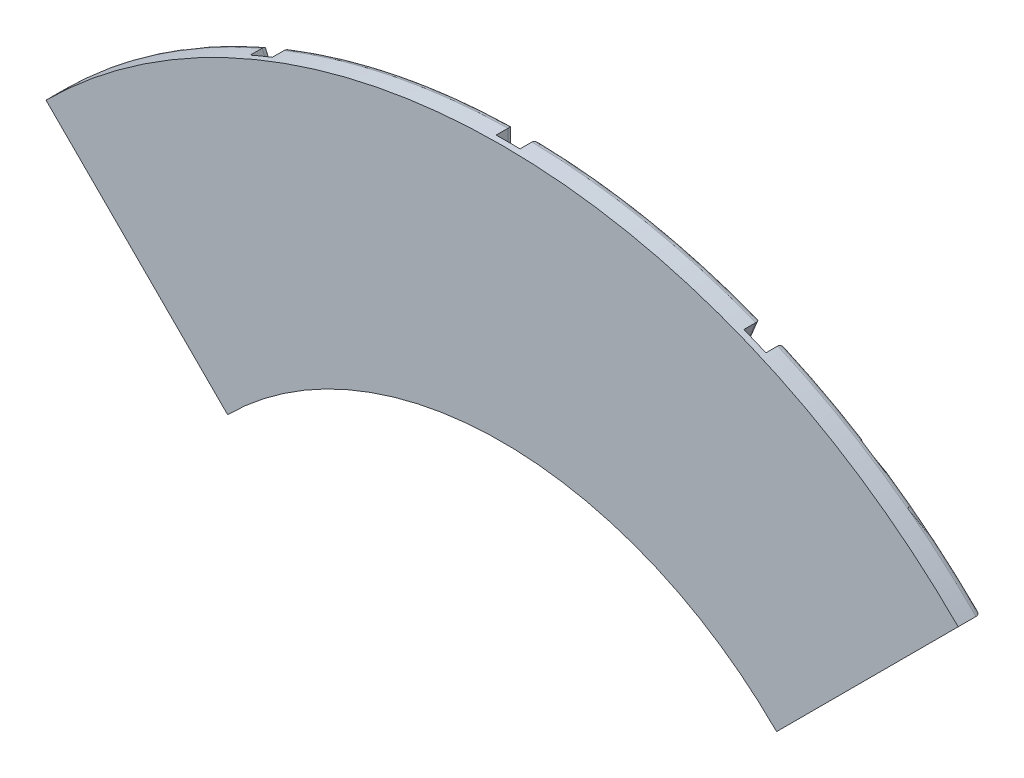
ISO-10303-21;
HEADER;
FILE_DESCRIPTION(('STEP AP214'),'2;1');
FILE_NAME('part.step','',(''),(''),'','','');
FILE_SCHEMA(('AUTOMOTIVE_DESIGN { 1 0 10303 214 1 1 1 1 }'));
ENDSEC;
DATA;
#1=APPLICATION_CONTEXT('core data for automotive mechanical design processes');
#2=APPLICATION_PROTOCOL_DEFINITION('international standard','automotive_design',2000,#1);
#3=PRODUCT_CONTEXT('',#1,'mechanical');
#4=PRODUCT('Part','Part','',(#3));
#5=PRODUCT_RELATED_PRODUCT_CATEGORY('part','',(#4));
#6=PRODUCT_DEFINITION_FORMATION('','',#4);
#7=PRODUCT_DEFINITION_CONTEXT('part definition',#1,'design');
#8=PRODUCT_DEFINITION('design','',#6,#7);
#9=PRODUCT_DEFINITION_SHAPE('','',#8);
#10=(LENGTH_UNIT() NAMED_UNIT(*) SI_UNIT(.MILLI.,.METRE.));
#11=(NAMED_UNIT(*) PLANE_ANGLE_UNIT() SI_UNIT($,.RADIAN.));
#12=(NAMED_UNIT(*) SI_UNIT($,.STERADIAN.) SOLID_ANGLE_UNIT());
#13=UNCERTAINTY_MEASURE_WITH_UNIT(LENGTH_MEASURE(1.E-05),#10,'distance_accuracy_value','');
#14=(GEOMETRIC_REPRESENTATION_CONTEXT(3) GLOBAL_UNCERTAINTY_ASSIGNED_CONTEXT((#13)) GLOBAL_UNIT_ASSIGNED_CONTEXT((#10,
#11,#12)) REPRESENTATION_CONTEXT('',''));
#15=CARTESIAN_POINT('',(0.,0.,0.));
#16=DIRECTION('',(0.,0.,1.));
#17=DIRECTION('',(1.,0.,0.));
#18=AXIS2_PLACEMENT_3D('',#15,#16,#17);
#19=CARTESIAN_POINT('',(0.,0.,-7.));
#20=DIRECTION('',(0.,0.,1.));
#21=DIRECTION('',(1.,0.,0.));
#22=AXIS2_PLACEMENT_3D('',#19,#20,#21);
#23=CYLINDRICAL_SURFACE('',#22,65.);
#24=DIRECTION('',(0.,0.,1.));
#25=VECTOR('',#24,1.);
#26=CARTESIAN_POINT('',(-45.9619407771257,45.9619407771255,-7.));
#27=LINE('',#26,#25);
#28=CARTESIAN_POINT('',(-45.9619407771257,45.9619407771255,-6.));
#29=VERTEX_POINT('',#28);
#30=CARTESIAN_POINT('',(-45.9619407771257,45.9619407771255,-3.));
#31=VERTEX_POINT('',#30);
#32=EDGE_CURVE('E519',#29,#31,#27,.T.);
#33=ORIENTED_EDGE('',*,*,#32,.F.);
#34=CARTESIAN_POINT('',(0.,0.,-6.));
#35=DIRECTION('',(0.,0.,-1.));
#36=DIRECTION('',(-1.,0.,0.));
#37=AXIS2_PLACEMENT_3D('',#34,#35,#36);
#38=CIRCLE('',#37,65.);
#39=CARTESIAN_POINT('',(-26.7104045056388,59.2583689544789,-6.));
#40=VERTEX_POINT('',#39);
#41=EDGE_CURVE('E563',#29,#40,#38,.T.);
#42=ORIENTED_EDGE('',*,*,#41,.T.);
#43=DIRECTION('',(0.,0.,-1.));
#44=VECTOR('',#43,1.);
#45=CARTESIAN_POINT('',(-26.7104045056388,59.2583689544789,-4.));
#46=LINE('',#45,#44);
#47=CARTESIAN_POINT('',(-26.7104045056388,59.2583689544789,-4.));
#48=VERTEX_POINT('',#47);
#49=EDGE_CURVE('E498',#48,#40,#46,.T.);
#50=ORIENTED_EDGE('',*,*,#49,.F.);
#51=CARTESIAN_POINT('',(0.,0.,-4.));
#52=DIRECTION('',(0.,0.,-1.));
#53=DIRECTION('',(-1.,0.,0.));
#54=AXIS2_PLACEMENT_3D('',#51,#52,#53);
#55=CIRCLE('',#54,65.);
#56=CARTESIAN_POINT('',(-23.0148863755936,60.7891026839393,-4.));
#57=VERTEX_POINT('',#56);
#58=EDGE_CURVE('E341',#57,#48,#55,.F.);
#59=ORIENTED_EDGE('',*,*,#58,.F.);
#60=DIRECTION('',(0.,0.,-1.));
#61=VECTOR('',#60,1.);
#62=CARTESIAN_POINT('',(-23.0148863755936,60.7891026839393,-4.));
#63=LINE('',#62,#61);
#64=CARTESIAN_POINT('',(-23.0148863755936,60.7891026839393,-6.));
#65=VERTEX_POINT('',#64);
#66=EDGE_CURVE('E336',#57,#65,#63,.T.);
#67=ORIENTED_EDGE('',*,*,#66,.T.);
#68=CARTESIAN_POINT('',(0.,0.,-6.));
#69=DIRECTION('',(0.,0.,-1.));
#70=DIRECTION('',(-1.,0.,0.));
#71=AXIS2_PLACEMENT_3D('',#68,#69,#70);
#72=CIRCLE('',#71,65.);
#73=CARTESIAN_POINT('',(-2.,64.9692234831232,-6.));
#74=VERTEX_POINT('',#73);
#75=EDGE_CURVE('E561',#65,#74,#72,.T.);
#76=ORIENTED_EDGE('',*,*,#75,.T.);
#77=DIRECTION('',(0.,0.,-1.));
#78=VECTOR('',#77,1.);
#79=CARTESIAN_POINT('',(-2.,64.9692234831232,-4.));
#80=LINE('',#79,#78);
#81=CARTESIAN_POINT('',(-2.,64.9692234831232,-4.));
#82=VERTEX_POINT('',#81);
#83=EDGE_CURVE('E428',#82,#74,#80,.T.);
#84=ORIENTED_EDGE('',*,*,#83,.F.);
#85=CARTESIAN_POINT('',(2.,64.9692234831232,-4.));
#86=VERTEX_POINT('',#85);
#87=EDGE_CURVE('E370',#86,#82,#55,.F.);
#88=ORIENTED_EDGE('',*,*,#87,.F.);
#89=DIRECTION('',(0.,0.,-1.));
#90=VECTOR('',#89,1.);
#91=CARTESIAN_POINT('',(2.,64.9692234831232,-4.));
#92=LINE('',#91,#90);
#93=CARTESIAN_POINT('',(2.,64.9692234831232,-6.));
#94=VERTEX_POINT('',#93);
#95=EDGE_CURVE('E431',#86,#94,#92,.T.);
#96=ORIENTED_EDGE('',*,*,#95,.T.);
#97=CARTESIAN_POINT('',(0.,0.,-6.));
#98=DIRECTION('',(0.,0.,-1.));
#99=DIRECTION('',(-1.,0.,0.));
#100=AXIS2_PLACEMENT_3D('',#97,#98,#99);
#101=CIRCLE('',#100,65.);
#102=CARTESIAN_POINT('',(23.0148863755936,60.7891026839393,-6.));
#103=VERTEX_POINT('',#102);
#104=EDGE_CURVE('E559',#94,#103,#101,.T.);
#105=ORIENTED_EDGE('',*,*,#104,.T.);
#106=DIRECTION('',(0.,0.,-1.));
#107=VECTOR('',#106,1.);
#108=CARTESIAN_POINT('',(23.0148863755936,60.7891026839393,-4.));
#109=LINE('',#108,#107);
#110=CARTESIAN_POINT('',(23.0148863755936,60.7891026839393,-4.));
#111=VERTEX_POINT('',#110);
#112=EDGE_CURVE('E440',#111,#103,#109,.T.);
#113=ORIENTED_EDGE('',*,*,#112,.F.);
#114=CARTESIAN_POINT('',(26.7104045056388,59.2583689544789,-4.));
#115=VERTEX_POINT('',#114);
#116=EDGE_CURVE('E371',#115,#111,#55,.F.);
#117=ORIENTED_EDGE('',*,*,#116,.F.);
#118=DIRECTION('',(0.,0.,-1.));
#119=VECTOR('',#118,1.);
#120=CARTESIAN_POINT('',(26.7104045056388,59.2583689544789,-4.));
#121=LINE('',#120,#119);
#122=CARTESIAN_POINT('',(26.7104045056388,59.2583689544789,-6.));
#123=VERTEX_POINT('',#122);
#124=EDGE_CURVE('E443',#115,#123,#121,.T.);
#125=ORIENTED_EDGE('',*,*,#124,.T.);
#126=CARTESIAN_POINT('',(0.,0.,-6.));
#127=DIRECTION('',(0.,0.,-1.));
#128=DIRECTION('',(-1.,0.,0.));
#129=AXIS2_PLACEMENT_3D('',#126,#127,#128);
#130=CIRCLE('',#129,65.);
#131=CARTESIAN_POINT('',(45.9619407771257,45.9619407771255,-6.));
#132=VERTEX_POINT('',#131);
#133=EDGE_CURVE('E557',#123,#132,#130,.T.);
#134=ORIENTED_EDGE('',*,*,#133,.T.);
#135=DIRECTION('',(0.,0.,1.));
#136=VECTOR('',#135,1.);
#137=CARTESIAN_POINT('',(45.9619407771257,45.9619407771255,-7.));
#138=LINE('',#137,#136);
#139=CARTESIAN_POINT('',(45.9619407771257,45.9619407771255,-3.));
#140=VERTEX_POINT('',#139);
#141=EDGE_CURVE('E513',#132,#140,#138,.T.);
#142=ORIENTED_EDGE('',*,*,#141,.T.);
#143=CARTESIAN_POINT('',(0.,0.,-3.));
#144=DIRECTION('',(0.,0.,1.));
#145=DIRECTION('',(-1.,0.,0.));
#146=AXIS2_PLACEMENT_3D('',#143,#144,#145);
#147=CIRCLE('',#146,65.);
#148=EDGE_CURVE('E427',#140,#31,#147,.T.);
#149=ORIENTED_EDGE('',*,*,#148,.T.);
#150=EDGE_LOOP('',(#33,#42,#50,#59,#67,#76,#84,#88,#96,#105,#113,#117,#125,#134,#142,#149));
#151=FACE_BOUND('',#150,.T.);
#152=ADVANCED_FACE('F27',(#151),#23,.F.);
#153=CARTESIAN_POINT('',(0.,0.,-7.));
#154=DIRECTION('',(0.,0.,1.));
#155=DIRECTION('',(1.,0.,0.));
#156=AXIS2_PLACEMENT_3D('',#153,#154,#155);
#157=CYLINDRICAL_SURFACE('',#156,108.);
#158=DIRECTION('',(0.,0.,-1.));
#159=VECTOR('',#158,1.);
#160=CARTESIAN_POINT('',(-43.1704824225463,98.9965122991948,-4.));
#161=LINE('',#160,#159);
#162=CARTESIAN_POINT('',(-43.1704824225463,98.9965122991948,-4.));
#163=VERTEX_POINT('',#162);
#164=CARTESIAN_POINT('',(-43.1704824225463,98.9965122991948,-6.));
#165=VERTEX_POINT('',#164);
#166=EDGE_CURVE('E483',#163,#165,#161,.T.);
#167=ORIENTED_EDGE('',*,*,#166,.T.);
#168=CARTESIAN_POINT('',(0.,0.,-6.));
#169=DIRECTION('',(0.,0.,-1.));
#170=DIRECTION('',(-1.,0.,0.));
#171=AXIS2_PLACEMENT_3D('',#168,#169,#170);
#172=CIRCLE('',#171,108.);
#173=CARTESIAN_POINT('',(-76.3675323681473,76.367532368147,-6.));
#174=VERTEX_POINT('',#173);
#175=EDGE_CURVE('E537',#165,#174,#172,.F.);
#176=ORIENTED_EDGE('',*,*,#175,.T.);
#177=DIRECTION('',(0.,0.,1.));
#178=VECTOR('',#177,1.);
#179=CARTESIAN_POINT('',(-76.3675323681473,76.367532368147,-7.));
#180=LINE('',#179,#178);
#181=CARTESIAN_POINT('',(-76.3675323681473,76.367532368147,-3.));
#182=VERTEX_POINT('',#181);
#183=EDGE_CURVE('E517',#174,#182,#180,.T.);
#184=ORIENTED_EDGE('',*,*,#183,.T.);
#185=CARTESIAN_POINT('',(0.,0.,-3.));
#186=DIRECTION('',(0.,0.,-1.));
#187=DIRECTION('',(-1.,0.,0.));
#188=AXIS2_PLACEMENT_3D('',#185,#186,#187);
#189=CIRCLE('',#188,108.);
#190=CARTESIAN_POINT('',(76.3675323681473,76.367532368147,-3.));
#191=VERTEX_POINT('',#190);
#192=EDGE_CURVE('E507',#182,#191,#189,.T.);
#193=ORIENTED_EDGE('',*,*,#192,.T.);
#194=DIRECTION('',(0.,0.,1.));
#195=VECTOR('',#194,1.);
#196=CARTESIAN_POINT('',(76.3675323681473,76.367532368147,-7.));
#197=LINE('',#196,#195);
#198=CARTESIAN_POINT('',(76.3675323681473,76.367532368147,-6.));
#199=VERTEX_POINT('',#198);
#200=EDGE_CURVE('E515',#199,#191,#197,.T.);
#201=ORIENTED_EDGE('',*,*,#200,.F.);
#202=CARTESIAN_POINT('',(0.,0.,-6.));
#203=DIRECTION('',(0.,0.,-1.));
#204=DIRECTION('',(-1.,0.,0.));
#205=AXIS2_PLACEMENT_3D('',#202,#203,#204);
#206=CIRCLE('',#205,108.);
#207=CARTESIAN_POINT('',(43.1704824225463,98.9965122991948,-6.));
#208=VERTEX_POINT('',#207);
#209=EDGE_CURVE('E530',#199,#208,#206,.F.);
#210=ORIENTED_EDGE('',*,*,#209,.T.);
#211=DIRECTION('',(0.,0.,-1.));
#212=VECTOR('',#211,1.);
#213=CARTESIAN_POINT('',(43.1704824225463,98.9965122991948,-4.));
#214=LINE('',#213,#212);
#215=CARTESIAN_POINT('',(43.1704824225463,98.9965122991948,-4.));
#216=VERTEX_POINT('',#215);
#217=EDGE_CURVE('E457',#216,#208,#214,.T.);
#218=ORIENTED_EDGE('',*,*,#217,.F.);
#219=CARTESIAN_POINT('',(0.,0.,-4.));
#220=DIRECTION('',(0.,0.,-1.));
#221=DIRECTION('',(-1.,0.,0.));
#222=AXIS2_PLACEMENT_3D('',#219,#220,#221);
#223=CIRCLE('',#222,108.);
#224=CARTESIAN_POINT('',(39.4749642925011,100.527246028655,-4.));
#225=VERTEX_POINT('',#224);
#226=EDGE_CURVE('E389',#225,#216,#223,.T.);
#227=ORIENTED_EDGE('',*,*,#226,.F.);
#228=DIRECTION('',(0.,0.,-1.));
#229=VECTOR('',#228,1.);
#230=CARTESIAN_POINT('',(39.4749642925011,100.527246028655,-4.));
#231=LINE('',#230,#229);
#232=CARTESIAN_POINT('',(39.4749642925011,100.527246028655,-6.));
#233=VERTEX_POINT('',#232);
#234=EDGE_CURVE('E459',#225,#233,#231,.T.);
#235=ORIENTED_EDGE('',*,*,#234,.T.);
#236=CARTESIAN_POINT('',(0.,0.,-6.));
#237=DIRECTION('',(0.,0.,-1.));
#238=DIRECTION('',(-1.,0.,0.));
#239=AXIS2_PLACEMENT_3D('',#236,#237,#238);
#240=CIRCLE('',#239,108.);
#241=CARTESIAN_POINT('',(2.,107.981479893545,-6.));
#242=VERTEX_POINT('',#241);
#243=EDGE_CURVE('E532',#233,#242,#240,.F.);
#244=ORIENTED_EDGE('',*,*,#243,.T.);
#245=DIRECTION('',(0.,0.,-1.));
#246=VECTOR('',#245,1.);
#247=CARTESIAN_POINT('',(2.,107.981479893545,-4.));
#248=LINE('',#247,#246);
#249=CARTESIAN_POINT('',(2.,107.981479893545,-4.));
#250=VERTEX_POINT('',#249);
#251=EDGE_CURVE('E468',#250,#242,#248,.T.);
#252=ORIENTED_EDGE('',*,*,#251,.F.);
#253=CARTESIAN_POINT('',(-2.,107.981479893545,-4.));
#254=VERTEX_POINT('',#253);
#255=EDGE_CURVE('E390',#254,#250,#223,.T.);
#256=ORIENTED_EDGE('',*,*,#255,.F.);
#257=DIRECTION('',(0.,0.,-1.));
#258=VECTOR('',#257,1.);
#259=CARTESIAN_POINT('',(-2.,107.981479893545,-4.));
#260=LINE('',#259,#258);
#261=CARTESIAN_POINT('',(-2.,107.981479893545,-6.));
#262=VERTEX_POINT('',#261);
#263=EDGE_CURVE('E471',#254,#262,#260,.T.);
#264=ORIENTED_EDGE('',*,*,#263,.T.);
#265=CARTESIAN_POINT('',(0.,0.,-6.));
#266=DIRECTION('',(0.,0.,-1.));
#267=DIRECTION('',(-1.,0.,0.));
#268=AXIS2_PLACEMENT_3D('',#265,#266,#267);
#269=CIRCLE('',#268,108.);
#270=CARTESIAN_POINT('',(-39.4749642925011,100.527246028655,-6.));
#271=VERTEX_POINT('',#270);
#272=EDGE_CURVE('E534',#262,#271,#269,.F.);
#273=ORIENTED_EDGE('',*,*,#272,.T.);
#274=DIRECTION('',(0.,0.,-1.));
#275=VECTOR('',#274,1.);
#276=CARTESIAN_POINT('',(-39.4749642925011,100.527246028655,-4.));
#277=LINE('',#276,#275);
#278=CARTESIAN_POINT('',(-39.4749642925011,100.527246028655,-4.));
#279=VERTEX_POINT('',#278);
#280=EDGE_CURVE('E480',#279,#271,#277,.T.);
#281=ORIENTED_EDGE('',*,*,#280,.F.);
#282=EDGE_CURVE('E385',#163,#279,#223,.T.);
#283=ORIENTED_EDGE('',*,*,#282,.F.);
#284=EDGE_LOOP('',(#167,#176,#184,#193,#201,#210,#218,#227,#235,#244,#252,#256,#264,#273,#281,#283));
#285=FACE_BOUND('',#284,.T.);
#286=ADVANCED_FACE('F1058',(#285),#157,.T.);
#287=CARTESIAN_POINT('',(76.3675323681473,76.367532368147,-7.));
#288=DIRECTION('',(-0.707106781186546,0.707106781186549,0.));
#289=DIRECTION('',(-0.707106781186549,-0.707106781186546,0.));
#290=AXIS2_PLACEMENT_3D('',#287,#288,#289);
#291=PLANE('',#290);
#292=ORIENTED_EDGE('',*,*,#141,.F.);
#293=DIRECTION('',(-0.707106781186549,-0.707106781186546,0.));
#294=VECTOR('',#293,1.);
#295=CARTESIAN_POINT('',(59.7505230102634,59.7505230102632,-6.));
#296=LINE('',#295,#294);
#297=CARTESIAN_POINT('',(59.7505230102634,59.7505230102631,-6.));
#298=VERTEX_POINT('',#297);
#299=EDGE_CURVE('E643',#132,#298,#296,.F.);
#300=ORIENTED_EDGE('',*,*,#299,.T.);
#301=DIRECTION('',(0.,0.,-1.));
#302=VECTOR('',#301,1.);
#303=CARTESIAN_POINT('',(59.7505230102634,59.7505230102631,-4.));
#304=LINE('',#303,#302);
#305=CARTESIAN_POINT('',(59.7505230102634,59.7505230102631,-4.));
#306=VERTEX_POINT('',#305);
#307=EDGE_CURVE('E449',#306,#298,#304,.T.);
#308=ORIENTED_EDGE('',*,*,#307,.F.);
#309=DIRECTION('',(-0.707106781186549,-0.707106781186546,0.));
#310=VECTOR('',#309,1.);
#311=CARTESIAN_POINT('',(-27.6253210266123,-27.6253210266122,-4.));
#312=LINE('',#311,#310);
#313=CARTESIAN_POINT('',(62.5789501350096,62.5789501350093,-4.));
#314=VERTEX_POINT('',#313);
#315=EDGE_CURVE('E411',#314,#306,#312,.T.);
#316=ORIENTED_EDGE('',*,*,#315,.F.);
#317=DIRECTION('',(0.,0.,-1.));
#318=VECTOR('',#317,1.);
#319=CARTESIAN_POINT('',(62.5789501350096,62.5789501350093,-4.));
#320=LINE('',#319,#318);
#321=CARTESIAN_POINT('',(62.5789501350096,62.5789501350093,-6.));
#322=VERTEX_POINT('',#321);
#323=EDGE_CURVE('E452',#314,#322,#320,.T.);
#324=ORIENTED_EDGE('',*,*,#323,.T.);
#325=DIRECTION('',(-0.707106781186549,-0.707106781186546,0.));
#326=VECTOR('',#325,1.);
#327=CARTESIAN_POINT('',(76.3675323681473,76.367532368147,-6.));
#328=LINE('',#327,#326);
#329=EDGE_CURVE('E640',#322,#199,#328,.F.);
#330=ORIENTED_EDGE('',*,*,#329,.T.);
#331=ORIENTED_EDGE('',*,*,#200,.T.);
#332=DIRECTION('',(-0.707106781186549,-0.707106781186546,0.));
#333=VECTOR('',#332,1.);
#334=CARTESIAN_POINT('',(76.3675323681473,76.367532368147,-3.));
#335=LINE('',#334,#333);
#336=EDGE_CURVE('E510',#191,#140,#335,.T.);
#337=ORIENTED_EDGE('',*,*,#336,.T.);
#338=EDGE_LOOP('',(#292,#300,#308,#316,#324,#330,#331,#337));
#339=FACE_BOUND('',#338,.T.);
#340=ADVANCED_FACE('F1055',(#339),#291,.F.);
#341=CARTESIAN_POINT('',(0.,0.,-7.));
#342=DIRECTION('',(0.,0.,-1.));
#343=DIRECTION('',(-1.,0.,0.));
#344=AXIS2_PLACEMENT_3D('',#341,#342,#343);
#345=PLANE('',#344);
#346=CARTESIAN_POINT('',(0.,0.,-7.));
#347=DIRECTION('',(0.,0.,-1.));
#348=DIRECTION('',(-1.,0.,0.));
#349=AXIS2_PLACEMENT_3D('',#346,#347,#348);
#350=CIRCLE('',#349,83.5);
#351=CARTESIAN_POINT('',(3.,83.4460903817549,-7.));
#352=VERTEX_POINT('',#351);
#353=CARTESIAN_POINT('',(29.1617976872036,78.2421852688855,-7.));
#354=VERTEX_POINT('',#353);
#355=EDGE_CURVE('E603',#352,#354,#350,.T.);
#356=ORIENTED_EDGE('',*,*,#355,.T.);
#357=DIRECTION('',(-0.38268343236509,-0.923879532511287,0.));
#358=VECTOR('',#357,1.);
#359=CARTESIAN_POINT('',(-2.77163859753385,1.14805029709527,-7.));
#360=LINE('',#359,#358);
#361=CARTESIAN_POINT('',(22.4593623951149,62.0610750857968,-7.));
#362=VERTEX_POINT('',#361);
#363=EDGE_CURVE('E605',#354,#362,#360,.T.);
#364=ORIENTED_EDGE('',*,*,#363,.T.);
#365=CARTESIAN_POINT('',(0.,0.,-7.));
#366=DIRECTION('',(0.,0.,-1.));
#367=DIRECTION('',(-1.,0.,0.));
#368=AXIS2_PLACEMENT_3D('',#365,#366,#367);
#369=CIRCLE('',#368,66.);
#370=CARTESIAN_POINT('',(3.,65.9317829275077,-7.));
#371=VERTEX_POINT('',#370);
#372=EDGE_CURVE('E599',#362,#371,#369,.F.);
#373=ORIENTED_EDGE('',*,*,#372,.T.);
#374=DIRECTION('',(0.,1.,0.));
#375=VECTOR('',#374,1.);
#376=CARTESIAN_POINT('',(3.,0.,-7.));
#377=LINE('',#376,#375);
#378=EDGE_CURVE('E601',#371,#352,#377,.T.);
#379=ORIENTED_EDGE('',*,*,#378,.T.);
#380=EDGE_LOOP('',(#356,#364,#373,#379));
#381=FACE_BOUND('',#380,.T.);
#382=ADVANCED_FACE('F1053',(#381),#345,.T.);
#383=CARTESIAN_POINT('',(0.,0.,-7.));
#384=DIRECTION('',(0.,0.,-1.));
#385=DIRECTION('',(-1.,0.,0.));
#386=AXIS2_PLACEMENT_3D('',#383,#384,#385);
#387=CIRCLE('',#386,83.5);
#388=CARTESIAN_POINT('',(34.7050748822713,75.946084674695,-7.));
#389=VERTEX_POINT('',#388);
#390=CARTESIAN_POINT('',(58.3320751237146,59.7462886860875,-7.));
#391=VERTEX_POINT('',#390);
#392=EDGE_CURVE('E635',#389,#391,#387,.T.);
#393=ORIENTED_EDGE('',*,*,#392,.T.);
#394=DIRECTION('',(-0.707106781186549,-0.707106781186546,0.));
#395=VECTOR('',#394,1.);
#396=CARTESIAN_POINT('',(45.2548339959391,46.6690475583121,-7.));
#397=LINE('',#396,#395);
#398=CARTESIAN_POINT('',(45.9565836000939,47.3707971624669,-7.));
#399=VERTEX_POINT('',#398);
#400=EDGE_CURVE('E637',#391,#399,#397,.T.);
#401=ORIENTED_EDGE('',*,*,#400,.T.);
#402=CARTESIAN_POINT('',(0.,0.,-7.));
#403=DIRECTION('',(0.,0.,-1.));
#404=DIRECTION('',(-1.,0.,0.));
#405=AXIS2_PLACEMENT_3D('',#402,#403,#404);
#406=CIRCLE('',#405,66.);
#407=CARTESIAN_POINT('',(28.0026395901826,59.7649744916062,-7.));
#408=VERTEX_POINT('',#407);
#409=EDGE_CURVE('E631',#399,#408,#406,.F.);
#410=ORIENTED_EDGE('',*,*,#409,.T.);
#411=DIRECTION('',(0.38268343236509,0.923879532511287,0.));
#412=VECTOR('',#411,1.);
#413=CARTESIAN_POINT('',(2.77163859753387,-1.14805029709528,-7.));
#414=LINE('',#413,#412);
#415=EDGE_CURVE('E633',#408,#389,#414,.T.);
#416=ORIENTED_EDGE('',*,*,#415,.T.);
#417=EDGE_LOOP('',(#393,#401,#410,#416));
#418=FACE_BOUND('',#417,.T.);
#419=ADVANCED_FACE('F1383',(#418),#345,.T.);
#420=CARTESIAN_POINT('',(0.,0.,-7.));
#421=DIRECTION('',(0.,0.,-1.));
#422=DIRECTION('',(-1.,0.,0.));
#423=AXIS2_PLACEMENT_3D('',#420,#421,#422);
#424=CIRCLE('',#423,89.5);
#425=CARTESIAN_POINT('',(31.4592821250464,83.7888033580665,-7.));
#426=VERTEX_POINT('',#425);
#427=CARTESIAN_POINT('',(3.,89.4497065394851,-7.));
#428=VERTEX_POINT('',#427);
#429=EDGE_CURVE('E619',#426,#428,#424,.F.);
#430=ORIENTED_EDGE('',*,*,#429,.T.);
#431=DIRECTION('',(0.,1.,0.));
#432=VECTOR('',#431,1.);
#433=CARTESIAN_POINT('',(3.,0.,-7.));
#434=LINE('',#433,#432);
#435=CARTESIAN_POINT('',(3.,106.957935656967,-7.));
#436=VERTEX_POINT('',#435);
#437=EDGE_CURVE('E621',#428,#436,#434,.T.);
#438=ORIENTED_EDGE('',*,*,#437,.T.);
#439=CARTESIAN_POINT('',(0.,0.,-7.));
#440=DIRECTION('',(0.,0.,-1.));
#441=DIRECTION('',(-1.,0.,0.));
#442=AXIS2_PLACEMENT_3D('',#439,#440,#441);
#443=CIRCLE('',#442,107.);
#444=CARTESIAN_POINT('',(38.159391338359,99.9642978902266,-7.));
#445=VERTEX_POINT('',#444);
#446=EDGE_CURVE('E615',#436,#445,#443,.T.);
#447=ORIENTED_EDGE('',*,*,#446,.T.);
#448=DIRECTION('',(-0.38268343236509,-0.923879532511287,0.));
#449=VECTOR('',#448,1.);
#450=CARTESIAN_POINT('',(-2.77163859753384,1.14805029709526,-7.));
#451=LINE('',#450,#449);
#452=EDGE_CURVE('E617',#445,#426,#451,.T.);
#453=ORIENTED_EDGE('',*,*,#452,.T.);
#454=EDGE_LOOP('',(#430,#438,#447,#453));
#455=FACE_BOUND('',#454,.T.);
#456=ADVANCED_FACE('F1390',(#455),#345,.T.);
#457=CARTESIAN_POINT('',(0.,0.,-7.));
#458=DIRECTION('',(0.,0.,-1.));
#459=DIRECTION('',(-1.,0.,0.));
#460=AXIS2_PLACEMENT_3D('',#457,#458,#459);
#461=CIRCLE('',#460,107.);
#462=CARTESIAN_POINT('',(43.7026685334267,97.6681972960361,-7.));
#463=VERTEX_POINT('',#462);
#464=CARTESIAN_POINT('',(74.9500144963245,76.3642280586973,-7.));
#465=VERTEX_POINT('',#464);
#466=EDGE_CURVE('E48',#463,#465,#461,.T.);
#467=ORIENTED_EDGE('',*,*,#466,.T.);
#468=DIRECTION('',(-0.707106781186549,-0.707106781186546,0.));
#469=VECTOR('',#468,1.);
#470=CARTESIAN_POINT('',(61.871843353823,63.2860569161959,-7.));
#471=LINE('',#470,#469);
#472=CARTESIAN_POINT('',(62.5749996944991,63.989213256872,-7.));
#473=VERTEX_POINT('',#472);
#474=EDGE_CURVE('E655',#465,#473,#471,.T.);
#475=ORIENTED_EDGE('',*,*,#474,.T.);
#476=CARTESIAN_POINT('',(0.,0.,-7.));
#477=DIRECTION('',(0.,0.,-1.));
#478=DIRECTION('',(-1.,0.,0.));
#479=AXIS2_PLACEMENT_3D('',#476,#477,#478);
#480=CIRCLE('',#479,89.5);
#481=CARTESIAN_POINT('',(37.0025593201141,81.492702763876,-7.));
#482=VERTEX_POINT('',#481);
#483=EDGE_CURVE('E650',#473,#482,#480,.F.);
#484=ORIENTED_EDGE('',*,*,#483,.T.);
#485=DIRECTION('',(-0.38268343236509,-0.923879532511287,0.));
#486=VECTOR('',#485,1.);
#487=CARTESIAN_POINT('',(44.0943619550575,98.6138288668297,-7.));
#488=LINE('',#487,#486);
#489=EDGE_CURVE('E652',#482,#463,#488,.F.);
#490=ORIENTED_EDGE('',*,*,#489,.T.);
#491=EDGE_LOOP('',(#467,#475,#484,#490));
#492=FACE_BOUND('',#491,.T.);
#493=ADVANCED_FACE('F657',(#492),#345,.T.);
#494=DIRECTION('',(-0.38268343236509,0.923879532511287,0.));
#495=VECTOR('',#494,1.);
#496=CARTESIAN_POINT('',(2.77163859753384,1.14805029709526,-7.));
#497=LINE('',#496,#495);
#498=CARTESIAN_POINT('',(-31.4592821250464,83.7888033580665,-7.));
#499=VERTEX_POINT('',#498);
#500=CARTESIAN_POINT('',(-38.159391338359,99.9642978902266,-7.));
#501=VERTEX_POINT('',#500);
#502=EDGE_CURVE('E588',#499,#501,#497,.T.);
#503=ORIENTED_EDGE('',*,*,#502,.T.);
#504=CARTESIAN_POINT('',(0.,0.,-7.));
#505=DIRECTION('',(0.,0.,-1.));
#506=DIRECTION('',(-1.,0.,0.));
#507=AXIS2_PLACEMENT_3D('',#504,#505,#506);
#508=CIRCLE('',#507,107.);
#509=CARTESIAN_POINT('',(-3.,106.957935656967,-7.));
#510=VERTEX_POINT('',#509);
#511=EDGE_CURVE('E590',#501,#510,#508,.T.);
#512=ORIENTED_EDGE('',*,*,#511,.T.);
#513=DIRECTION('',(0.,1.,0.));
#514=VECTOR('',#513,1.);
#515=CARTESIAN_POINT('',(-3.,88.4773982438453,-7.));
#516=LINE('',#515,#514);
#517=CARTESIAN_POINT('',(-3.,89.4497065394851,-7.));
#518=VERTEX_POINT('',#517);
#519=EDGE_CURVE('E584',#510,#518,#516,.F.);
#520=ORIENTED_EDGE('',*,*,#519,.T.);
#521=CARTESIAN_POINT('',(0.,0.,-7.));
#522=DIRECTION('',(0.,0.,-1.));
#523=DIRECTION('',(-1.,0.,0.));
#524=AXIS2_PLACEMENT_3D('',#521,#522,#523);
#525=CIRCLE('',#524,89.5);
#526=EDGE_CURVE('E586',#518,#499,#525,.F.);
#527=ORIENTED_EDGE('',*,*,#526,.T.);
#528=EDGE_LOOP('',(#503,#512,#520,#527));
#529=FACE_BOUND('',#528,.T.);
#530=ADVANCED_FACE('F1403',(#529),#345,.T.);
#531=DIRECTION('',(-0.382683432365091,0.923879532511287,0.));
#532=VECTOR('',#531,1.);
#533=CARTESIAN_POINT('',(-27.6342840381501,58.8756855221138,-7.));
#534=LINE('',#533,#532);
#535=CARTESIAN_POINT('',(-34.7050748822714,75.9460846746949,-7.));
#536=VERTEX_POINT('',#535);
#537=CARTESIAN_POINT('',(-28.0026395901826,59.7649744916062,-7.));
#538=VERTEX_POINT('',#537);
#539=EDGE_CURVE('E552',#536,#538,#534,.F.);
#540=ORIENTED_EDGE('',*,*,#539,.T.);
#541=CARTESIAN_POINT('',(0.,0.,-7.));
#542=DIRECTION('',(0.,0.,-1.));
#543=DIRECTION('',(-1.,0.,0.));
#544=AXIS2_PLACEMENT_3D('',#541,#542,#543);
#545=CIRCLE('',#544,66.);
#546=CARTESIAN_POINT('',(-45.9565836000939,47.3707971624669,-7.));
#547=VERTEX_POINT('',#546);
#548=EDGE_CURVE('E554',#538,#547,#545,.F.);
#549=ORIENTED_EDGE('',*,*,#548,.T.);
#550=DIRECTION('',(-0.707106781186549,0.707106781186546,0.));
#551=VECTOR('',#550,1.);
#552=CARTESIAN_POINT('',(-59.0434162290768,60.4576297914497,-7.));
#553=LINE('',#552,#551);
#554=CARTESIAN_POINT('',(-58.3320751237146,59.7462886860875,-7.));
#555=VERTEX_POINT('',#554);
#556=EDGE_CURVE('E548',#547,#555,#553,.T.);
#557=ORIENTED_EDGE('',*,*,#556,.T.);
#558=CARTESIAN_POINT('',(0.,0.,-7.));
#559=DIRECTION('',(0.,0.,-1.));
#560=DIRECTION('',(-1.,0.,0.));
#561=AXIS2_PLACEMENT_3D('',#558,#559,#560);
#562=CIRCLE('',#561,83.5);
#563=EDGE_CURVE('E550',#555,#536,#562,.T.);
#564=ORIENTED_EDGE('',*,*,#563,.T.);
#565=EDGE_LOOP('',(#540,#549,#557,#564));
#566=FACE_BOUND('',#565,.T.);
#567=ADVANCED_FACE('F1067',(#566),#345,.T.);
#568=DIRECTION('',(-0.707106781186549,0.707106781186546,0.));
#569=VECTOR('',#568,1.);
#570=CARTESIAN_POINT('',(-75.6604255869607,77.0746391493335,-7.));
#571=LINE('',#570,#569);
#572=CARTESIAN_POINT('',(-62.5749996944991,63.989213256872,-7.));
#573=VERTEX_POINT('',#572);
#574=CARTESIAN_POINT('',(-74.9500144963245,76.3642280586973,-7.));
#575=VERTEX_POINT('',#574);
#576=EDGE_CURVE('E525',#573,#575,#571,.T.);
#577=ORIENTED_EDGE('',*,*,#576,.T.);
#578=CARTESIAN_POINT('',(0.,0.,-7.));
#579=DIRECTION('',(0.,0.,-1.));
#580=DIRECTION('',(-1.,0.,0.));
#581=AXIS2_PLACEMENT_3D('',#578,#579,#580);
#582=CIRCLE('',#581,107.);
#583=CARTESIAN_POINT('',(-43.7026685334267,97.6681972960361,-7.));
#584=VERTEX_POINT('',#583);
#585=EDGE_CURVE('E527',#575,#584,#582,.T.);
#586=ORIENTED_EDGE('',*,*,#585,.T.);
#587=DIRECTION('',(-0.38268343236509,0.923879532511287,0.));
#588=VECTOR('',#587,1.);
#589=CARTESIAN_POINT('',(-36.6304730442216,80.5944070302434,-7.));
#590=LINE('',#589,#588);
#591=CARTESIAN_POINT('',(-37.0025593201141,81.492702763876,-7.));
#592=VERTEX_POINT('',#591);
#593=EDGE_CURVE('E521',#584,#592,#590,.F.);
#594=ORIENTED_EDGE('',*,*,#593,.T.);
#595=CARTESIAN_POINT('',(0.,0.,-7.));
#596=DIRECTION('',(0.,0.,-1.));
#597=DIRECTION('',(-1.,0.,0.));
#598=AXIS2_PLACEMENT_3D('',#595,#596,#597);
#599=CIRCLE('',#598,89.5);
#600=EDGE_CURVE('E523',#592,#573,#599,.F.);
#601=ORIENTED_EDGE('',*,*,#600,.T.);
#602=EDGE_LOOP('',(#577,#586,#594,#601));
#603=FACE_BOUND('',#602,.T.);
#604=ADVANCED_FACE('F1054',(#603),#345,.T.);
#605=CARTESIAN_POINT('',(-45.9619407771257,45.9619407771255,-7.));
#606=DIRECTION('',(0.707106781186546,0.707106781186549,0.));
#607=DIRECTION('',(-0.707106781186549,0.707106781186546,0.));
#608=AXIS2_PLACEMENT_3D('',#605,#606,#607);
#609=PLANE('',#608);
#610=ORIENTED_EDGE('',*,*,#183,.F.);
#611=DIRECTION('',(-0.707106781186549,0.707106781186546,0.));
#612=VECTOR('',#611,1.);
#613=CARTESIAN_POINT('',(-62.5789501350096,62.5789501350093,-6.));
#614=LINE('',#613,#612);
#615=CARTESIAN_POINT('',(-62.5789501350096,62.5789501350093,-6.));
#616=VERTEX_POINT('',#615);
#617=EDGE_CURVE('E542',#174,#616,#614,.F.);
#618=ORIENTED_EDGE('',*,*,#617,.T.);
#619=DIRECTION('',(0.,0.,-1.));
#620=VECTOR('',#619,1.);
#621=CARTESIAN_POINT('',(-62.5789501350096,62.5789501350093,-4.));
#622=LINE('',#621,#620);
#623=CARTESIAN_POINT('',(-62.5789501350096,62.5789501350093,-4.));
#624=VERTEX_POINT('',#623);
#625=EDGE_CURVE('E489',#624,#616,#622,.T.);
#626=ORIENTED_EDGE('',*,*,#625,.F.);
#627=DIRECTION('',(-0.707106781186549,0.707106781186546,0.));
#628=VECTOR('',#627,1.);
#629=CARTESIAN_POINT('',(-104.069122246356,104.069122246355,-4.));
#630=LINE('',#629,#628);
#631=CARTESIAN_POINT('',(-59.7505230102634,59.7505230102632,-4.));
#632=VERTEX_POINT('',#631);
#633=EDGE_CURVE('E376',#632,#624,#630,.T.);
#634=ORIENTED_EDGE('',*,*,#633,.F.);
#635=DIRECTION('',(0.,0.,-1.));
#636=VECTOR('',#635,1.);
#637=CARTESIAN_POINT('',(-59.7505230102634,59.7505230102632,-4.));
#638=LINE('',#637,#636);
#639=CARTESIAN_POINT('',(-59.7505230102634,59.7505230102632,-6.));
#640=VERTEX_POINT('',#639);
#641=EDGE_CURVE('E492',#632,#640,#638,.T.);
#642=ORIENTED_EDGE('',*,*,#641,.T.);
#643=DIRECTION('',(-0.707106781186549,0.707106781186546,0.));
#644=VECTOR('',#643,1.);
#645=CARTESIAN_POINT('',(-45.9619407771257,45.9619407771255,-6.));
#646=LINE('',#645,#644);
#647=EDGE_CURVE('E540',#640,#29,#646,.F.);
#648=ORIENTED_EDGE('',*,*,#647,.T.);
#649=ORIENTED_EDGE('',*,*,#32,.T.);
#650=DIRECTION('',(-0.707106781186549,0.707106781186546,0.));
#651=VECTOR('',#650,1.);
#652=CARTESIAN_POINT('',(-45.9619407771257,45.9619407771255,-3.));
#653=LINE('',#652,#651);
#654=EDGE_CURVE('E504',#31,#182,#653,.T.);
#655=ORIENTED_EDGE('',*,*,#654,.T.);
#656=EDGE_LOOP('',(#610,#618,#626,#634,#642,#648,#649,#655));
#657=FACE_BOUND('',#656,.T.);
#658=ADVANCED_FACE('F1051',(#657),#609,.F.);
#659=DIRECTION('',(-0.38268343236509,0.923879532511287,0.));
#660=VECTOR('',#659,1.);
#661=CARTESIAN_POINT('',(2.77163859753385,1.14805029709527,-7.));
#662=LINE('',#661,#660);
#663=CARTESIAN_POINT('',(-22.4593623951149,62.0610750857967,-7.));
#664=VERTEX_POINT('',#663);
#665=CARTESIAN_POINT('',(-29.1617976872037,78.2421852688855,-7.));
#666=VERTEX_POINT('',#665);
#667=EDGE_CURVE('E574',#664,#666,#662,.T.);
#668=ORIENTED_EDGE('',*,*,#667,.T.);
#669=CARTESIAN_POINT('',(0.,0.,-7.));
#670=DIRECTION('',(0.,0.,-1.));
#671=DIRECTION('',(-1.,0.,0.));
#672=AXIS2_PLACEMENT_3D('',#669,#670,#671);
#673=CIRCLE('',#672,83.5);
#674=CARTESIAN_POINT('',(-3.,83.4460903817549,-7.));
#675=VERTEX_POINT('',#674);
#676=EDGE_CURVE('E576',#666,#675,#673,.T.);
#677=ORIENTED_EDGE('',*,*,#676,.T.);
#678=DIRECTION('',(0.,1.,0.));
#679=VECTOR('',#678,1.);
#680=CARTESIAN_POINT('',(-3.,64.9692234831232,-7.));
#681=LINE('',#680,#679);
#682=CARTESIAN_POINT('',(-3.,65.9317829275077,-7.));
#683=VERTEX_POINT('',#682);
#684=EDGE_CURVE('E570',#675,#683,#681,.F.);
#685=ORIENTED_EDGE('',*,*,#684,.T.);
#686=CARTESIAN_POINT('',(0.,0.,-7.));
#687=DIRECTION('',(0.,0.,-1.));
#688=DIRECTION('',(-1.,0.,0.));
#689=AXIS2_PLACEMENT_3D('',#686,#687,#688);
#690=CIRCLE('',#689,66.);
#691=EDGE_CURVE('E572',#683,#664,#690,.F.);
#692=ORIENTED_EDGE('',*,*,#691,.T.);
#693=EDGE_LOOP('',(#668,#677,#685,#692));
#694=FACE_BOUND('',#693,.T.);
#695=ADVANCED_FACE('F1047',(#694),#345,.T.);
#696=CARTESIAN_POINT('',(0.,0.,-3.));
#697=DIRECTION('',(0.,0.,-1.));
#698=DIRECTION('',(-1.,0.,0.));
#699=AXIS2_PLACEMENT_3D('',#696,#697,#698);
#700=PLANE('',#699);
#701=ORIENTED_EDGE('',*,*,#148,.F.);
#702=ORIENTED_EDGE('',*,*,#336,.F.);
#703=ORIENTED_EDGE('',*,*,#192,.F.);
#704=ORIENTED_EDGE('',*,*,#654,.F.);
#705=EDGE_LOOP('',(#701,#702,#703,#704));
#706=FACE_BOUND('',#705,.T.);
#707=ADVANCED_FACE('F1044',(#706),#700,.F.);
#708=CARTESIAN_POINT('',(0.,0.,-4.));
#709=DIRECTION('',(0.,0.,-1.));
#710=DIRECTION('',(-1.,0.,0.));
#711=AXIS2_PLACEMENT_3D('',#708,#709,#710);
#712=CYLINDRICAL_SURFACE('',#711,84.5);
#713=DIRECTION('',(0.,0.,-1.));
#714=VECTOR('',#713,1.);
#715=CARTESIAN_POINT('',(-2.,84.4763280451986,-4.));
#716=LINE('',#715,#714);
#717=CARTESIAN_POINT('',(-2.,84.4763280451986,-4.));
#718=VERTEX_POINT('',#717);
#719=CARTESIAN_POINT('',(-2.,84.4763280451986,-6.));
#720=VERTEX_POINT('',#719);
#721=EDGE_CURVE('E425',#718,#720,#716,.T.);
#722=ORIENTED_EDGE('',*,*,#721,.T.);
#723=CARTESIAN_POINT('',(0.,0.,-6.));
#724=DIRECTION('',(0.,0.,-1.));
#725=DIRECTION('',(-1.,0.,0.));
#726=AXIS2_PLACEMENT_3D('',#723,#724,#725);
#727=CIRCLE('',#726,84.5);
#728=CARTESIAN_POINT('',(-30.4799321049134,78.8113173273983,-6.));
#729=VERTEX_POINT('',#728);
#730=EDGE_CURVE('E350',#720,#729,#727,.F.);
#731=ORIENTED_EDGE('',*,*,#730,.T.);
#732=DIRECTION('',(0.,0.,-1.));
#733=VECTOR('',#732,1.);
#734=CARTESIAN_POINT('',(-30.4799321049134,78.8113173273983,-4.));
#735=LINE('',#734,#733);
#736=CARTESIAN_POINT('',(-30.4799321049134,78.8113173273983,-4.));
#737=VERTEX_POINT('',#736);
#738=EDGE_CURVE('E334',#737,#729,#735,.T.);
#739=ORIENTED_EDGE('',*,*,#738,.F.);
#740=CARTESIAN_POINT('',(0.,0.,-4.));
#741=DIRECTION('',(0.,0.,-1.));
#742=DIRECTION('',(-1.,0.,0.));
#743=AXIS2_PLACEMENT_3D('',#740,#741,#742);
#744=CIRCLE('',#743,84.5);
#745=EDGE_CURVE('E342',#737,#718,#744,.T.);
#746=ORIENTED_EDGE('',*,*,#745,.T.);
#747=EDGE_LOOP('',(#722,#731,#739,#746));
#748=FACE_BOUND('',#747,.T.);
#749=ADVANCED_FACE('F347',(#748),#712,.T.);
#750=CARTESIAN_POINT('',(-2.,76.4438012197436,-4.));
#751=DIRECTION('',(-1.,0.,0.));
#752=DIRECTION('',(0.,-1.,0.));
#753=AXIS2_PLACEMENT_3D('',#750,#751,#752);
#754=PLANE('',#753);
#755=ORIENTED_EDGE('',*,*,#83,.T.);
#756=DIRECTION('',(0.,1.,0.));
#757=VECTOR('',#756,1.);
#758=CARTESIAN_POINT('',(-2.,84.4763280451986,-6.));
#759=LINE('',#758,#757);
#760=EDGE_CURVE('E582',#74,#720,#759,.T.);
#761=ORIENTED_EDGE('',*,*,#760,.T.);
#762=ORIENTED_EDGE('',*,*,#721,.F.);
#763=DIRECTION('',(0.,1.,0.));
#764=VECTOR('',#763,1.);
#765=CARTESIAN_POINT('',(-2.,76.4438012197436,-4.));
#766=LINE('',#765,#764);
#767=EDGE_CURVE('E351',#82,#718,#766,.T.);
#768=ORIENTED_EDGE('',*,*,#767,.F.);
#769=EDGE_LOOP('',(#755,#761,#762,#768));
#770=FACE_BOUND('',#769,.T.);
#771=ADVANCED_FACE('F969',(#770),#754,.F.);
#772=CARTESIAN_POINT('',(2.,76.4438012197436,-4.));
#773=DIRECTION('',(-1.,0.,0.));
#774=DIRECTION('',(0.,-1.,0.));
#775=AXIS2_PLACEMENT_3D('',#772,#773,#774);
#776=PLANE('',#775);
#777=DIRECTION('',(0.,0.,-1.));
#778=VECTOR('',#777,1.);
#779=CARTESIAN_POINT('',(2.,84.4763280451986,-4.));
#780=LINE('',#779,#778);
#781=CARTESIAN_POINT('',(2.,84.4763280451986,-4.));
#782=VERTEX_POINT('',#781);
#783=CARTESIAN_POINT('',(2.,84.4763280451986,-6.));
#784=VERTEX_POINT('',#783);
#785=EDGE_CURVE('E434',#782,#784,#780,.T.);
#786=ORIENTED_EDGE('',*,*,#785,.T.);
#787=DIRECTION('',(0.,1.,0.));
#788=VECTOR('',#787,1.);
#789=CARTESIAN_POINT('',(2.,76.4438012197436,-6.));
#790=LINE('',#789,#788);
#791=EDGE_CURVE('E613',#784,#94,#790,.F.);
#792=ORIENTED_EDGE('',*,*,#791,.T.);
#793=ORIENTED_EDGE('',*,*,#95,.F.);
#794=DIRECTION('',(0.,1.,0.));
#795=VECTOR('',#794,1.);
#796=CARTESIAN_POINT('',(2.,76.4438012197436,-4.));
#797=LINE('',#796,#795);
#798=EDGE_CURVE('E422',#86,#782,#797,.T.);
#799=ORIENTED_EDGE('',*,*,#798,.T.);
#800=EDGE_LOOP('',(#786,#792,#793,#799));
#801=FACE_BOUND('',#800,.T.);
#802=ADVANCED_FACE('F972',(#801),#776,.T.);
#803=CARTESIAN_POINT('',(0.,0.,-4.));
#804=DIRECTION('',(0.,0.,-1.));
#805=DIRECTION('',(-1.,0.,0.));
#806=AXIS2_PLACEMENT_3D('',#803,#804,#805);
#807=CYLINDRICAL_SURFACE('',#806,84.5);
#808=DIRECTION('',(0.,0.,-1.));
#809=VECTOR('',#808,1.);
#810=CARTESIAN_POINT('',(30.4799321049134,78.8113173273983,-4.));
#811=LINE('',#810,#809);
#812=CARTESIAN_POINT('',(30.4799321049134,78.8113173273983,-4.));
#813=VERTEX_POINT('',#812);
#814=CARTESIAN_POINT('',(30.4799321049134,78.8113173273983,-6.));
#815=VERTEX_POINT('',#814);
#816=EDGE_CURVE('E437',#813,#815,#811,.T.);
#817=ORIENTED_EDGE('',*,*,#816,.T.);
#818=CARTESIAN_POINT('',(0.,0.,-6.));
#819=DIRECTION('',(0.,0.,-1.));
#820=DIRECTION('',(-1.,0.,0.));
#821=AXIS2_PLACEMENT_3D('',#818,#819,#820);
#822=CIRCLE('',#821,84.5);
#823=EDGE_CURVE('E611',#815,#784,#822,.F.);
#824=ORIENTED_EDGE('',*,*,#823,.T.);
#825=ORIENTED_EDGE('',*,*,#785,.F.);
#826=CARTESIAN_POINT('',(0.,0.,-4.));
#827=DIRECTION('',(0.,0.,-1.));
#828=DIRECTION('',(-1.,0.,0.));
#829=AXIS2_PLACEMENT_3D('',#826,#827,#828);
#830=CIRCLE('',#829,84.5);
#831=EDGE_CURVE('E420',#782,#813,#830,.T.);
#832=ORIENTED_EDGE('',*,*,#831,.T.);
#833=EDGE_LOOP('',(#817,#824,#825,#832));
#834=FACE_BOUND('',#833,.T.);
#835=ADVANCED_FACE('F976',(#834),#807,.T.);
#836=CARTESIAN_POINT('',(5.89300135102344,19.4532156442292,-4.));
#837=DIRECTION('',(0.923879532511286,-0.38268343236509,0.));
#838=DIRECTION('',(0.38268343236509,0.923879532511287,0.));
#839=AXIS2_PLACEMENT_3D('',#836,#837,#838);
#840=PLANE('',#839);
#841=ORIENTED_EDGE('',*,*,#112,.T.);
#842=DIRECTION('',(-0.38268343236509,-0.923879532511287,0.));
#843=VECTOR('',#842,1.);
#844=CARTESIAN_POINT('',(5.89300135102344,19.4532156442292,-6.));
#845=LINE('',#844,#843);
#846=EDGE_CURVE('E608',#103,#815,#845,.F.);
#847=ORIENTED_EDGE('',*,*,#846,.T.);
#848=ORIENTED_EDGE('',*,*,#816,.F.);
#849=DIRECTION('',(-0.38268343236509,-0.923879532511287,0.));
#850=VECTOR('',#849,1.);
#851=CARTESIAN_POINT('',(5.89300135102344,19.4532156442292,-4.));
#852=LINE('',#851,#850);
#853=EDGE_CURVE('E418',#813,#111,#852,.T.);
#854=ORIENTED_EDGE('',*,*,#853,.T.);
#855=EDGE_LOOP('',(#841,#847,#848,#854));
#856=FACE_BOUND('',#855,.T.);
#857=ADVANCED_FACE('F980',(#856),#840,.T.);
#858=CARTESIAN_POINT('',(9.58851948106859,17.9224819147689,-4.));
#859=DIRECTION('',(-0.923879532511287,0.38268343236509,0.));
#860=DIRECTION('',(-0.38268343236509,-0.923879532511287,0.));
#861=AXIS2_PLACEMENT_3D('',#858,#859,#860);
#862=PLANE('',#861);
#863=DIRECTION('',(0.,0.,-1.));
#864=VECTOR('',#863,1.);
#865=CARTESIAN_POINT('',(34.1754502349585,77.2805835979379,-4.));
#866=LINE('',#865,#864);
#867=CARTESIAN_POINT('',(34.1754502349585,77.2805835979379,-4.));
#868=VERTEX_POINT('',#867);
#869=CARTESIAN_POINT('',(34.1754502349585,77.2805835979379,-6.));
#870=VERTEX_POINT('',#869);
#871=EDGE_CURVE('E446',#868,#870,#866,.T.);
#872=ORIENTED_EDGE('',*,*,#871,.T.);
#873=DIRECTION('',(0.38268343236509,0.923879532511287,0.));
#874=VECTOR('',#873,1.);
#875=CARTESIAN_POINT('',(9.58851948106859,17.9224819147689,-6.));
#876=LINE('',#875,#874);
#877=EDGE_CURVE('E648',#870,#123,#876,.F.);
#878=ORIENTED_EDGE('',*,*,#877,.T.);
#879=ORIENTED_EDGE('',*,*,#124,.F.);
#880=DIRECTION('',(0.38268343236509,0.923879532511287,0.));
#881=VECTOR('',#880,1.);
#882=CARTESIAN_POINT('',(9.58851948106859,17.9224819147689,-4.));
#883=LINE('',#882,#881);
#884=EDGE_CURVE('E416',#115,#868,#883,.T.);
#885=ORIENTED_EDGE('',*,*,#884,.T.);
#886=EDGE_LOOP('',(#872,#878,#879,#885));
#887=FACE_BOUND('',#886,.T.);
#888=ADVANCED_FACE('F984',(#887),#862,.T.);
#889=CARTESIAN_POINT('',(0.,0.,-4.));
#890=DIRECTION('',(0.,0.,-1.));
#891=DIRECTION('',(-1.,0.,0.));
#892=AXIS2_PLACEMENT_3D('',#889,#890,#891);
#893=CYLINDRICAL_SURFACE('',#892,84.5);
#894=ORIENTED_EDGE('',*,*,#307,.T.);
#895=CARTESIAN_POINT('',(0.,0.,-6.));
#896=DIRECTION('',(0.,0.,-1.));
#897=DIRECTION('',(-1.,0.,0.));
#898=AXIS2_PLACEMENT_3D('',#895,#896,#897);
#899=CIRCLE('',#898,84.5);
#900=EDGE_CURVE('E646',#298,#870,#899,.F.);
#901=ORIENTED_EDGE('',*,*,#900,.T.);
#902=ORIENTED_EDGE('',*,*,#871,.F.);
#903=CARTESIAN_POINT('',(0.,0.,-4.));
#904=DIRECTION('',(0.,0.,-1.));
#905=DIRECTION('',(-1.,0.,0.));
#906=AXIS2_PLACEMENT_3D('',#903,#904,#905);
#907=CIRCLE('',#906,84.5);
#908=EDGE_CURVE('E414',#868,#306,#907,.T.);
#909=ORIENTED_EDGE('',*,*,#908,.T.);
#910=EDGE_LOOP('',(#894,#901,#902,#909));
#911=FACE_BOUND('',#910,.T.);
#912=ADVANCED_FACE('F988',(#911),#893,.T.);
#913=CARTESIAN_POINT('',(0.,0.,-4.));
#914=DIRECTION('',(0.,0.,-1.));
#915=DIRECTION('',(-1.,0.,0.));
#916=AXIS2_PLACEMENT_3D('',#913,#914,#915);
#917=CYLINDRICAL_SURFACE('',#916,88.5);
#918=DIRECTION('',(0.,0.,-1.));
#919=VECTOR('',#918,1.);
#920=CARTESIAN_POINT('',(35.7065935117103,80.9770904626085,-4.));
#921=LINE('',#920,#919);
#922=CARTESIAN_POINT('',(35.7065935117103,80.9770904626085,-4.));
#923=VERTEX_POINT('',#922);
#924=CARTESIAN_POINT('',(35.7065935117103,80.9770904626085,-6.));
#925=VERTEX_POINT('',#924);
#926=EDGE_CURVE('E455',#923,#925,#921,.T.);
#927=ORIENTED_EDGE('',*,*,#926,.T.);
#928=CARTESIAN_POINT('',(0.,0.,-6.));
#929=DIRECTION('',(0.,0.,-1.));
#930=DIRECTION('',(-1.,0.,0.));
#931=AXIS2_PLACEMENT_3D('',#928,#929,#930);
#932=CIRCLE('',#931,88.5);
#933=EDGE_CURVE('E12',#925,#322,#932,.T.);
#934=ORIENTED_EDGE('',*,*,#933,.T.);
#935=ORIENTED_EDGE('',*,*,#323,.F.);
#936=CARTESIAN_POINT('',(0.,0.,-4.));
#937=DIRECTION('',(0.,0.,-1.));
#938=DIRECTION('',(-1.,0.,0.));
#939=AXIS2_PLACEMENT_3D('',#936,#937,#938);
#940=CIRCLE('',#939,88.5);
#941=EDGE_CURVE('E408',#923,#314,#940,.T.);
#942=ORIENTED_EDGE('',*,*,#941,.F.);
#943=EDGE_LOOP('',(#927,#934,#935,#942));
#944=FACE_BOUND('',#943,.T.);
#945=ADVANCED_FACE('F992',(#944),#917,.F.);
#946=CARTESIAN_POINT('',(9.58851948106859,17.9224819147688,-4.));
#947=DIRECTION('',(0.923879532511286,-0.38268343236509,0.));
#948=DIRECTION('',(0.38268343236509,0.923879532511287,0.));
#949=AXIS2_PLACEMENT_3D('',#946,#947,#948);
#950=PLANE('',#949);
#951=ORIENTED_EDGE('',*,*,#217,.T.);
#952=DIRECTION('',(-0.38268343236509,-0.923879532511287,0.));
#953=VECTOR('',#952,1.);
#954=CARTESIAN_POINT('',(35.7065935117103,80.9770904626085,-6.));
#955=LINE('',#954,#953);
#956=EDGE_CURVE('E34',#208,#925,#955,.T.);
#957=ORIENTED_EDGE('',*,*,#956,.T.);
#958=ORIENTED_EDGE('',*,*,#926,.F.);
#959=DIRECTION('',(-0.38268343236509,-0.923879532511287,0.));
#960=VECTOR('',#959,1.);
#961=CARTESIAN_POINT('',(9.58851948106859,17.9224819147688,-4.));
#962=LINE('',#961,#960);
#963=EDGE_CURVE('E405',#216,#923,#962,.T.);
#964=ORIENTED_EDGE('',*,*,#963,.F.);
#965=EDGE_LOOP('',(#951,#957,#958,#964));
#966=FACE_BOUND('',#965,.T.);
#967=ADVANCED_FACE('F996',(#966),#950,.F.);
#968=CARTESIAN_POINT('',(5.89300135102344,19.4532156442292,-4.));
#969=DIRECTION('',(0.923879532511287,-0.38268343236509,0.));
#970=DIRECTION('',(0.38268343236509,0.923879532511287,0.));
#971=AXIS2_PLACEMENT_3D('',#968,#969,#970);
#972=PLANE('',#971);
#973=DIRECTION('',(0.,0.,-1.));
#974=VECTOR('',#973,1.);
#975=CARTESIAN_POINT('',(32.0110753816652,82.5078241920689,-4.));
#976=LINE('',#975,#974);
#977=CARTESIAN_POINT('',(32.0110753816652,82.5078241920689,-4.));
#978=VERTEX_POINT('',#977);
#979=CARTESIAN_POINT('',(32.0110753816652,82.5078241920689,-6.));
#980=VERTEX_POINT('',#979);
#981=EDGE_CURVE('E462',#978,#980,#976,.T.);
#982=ORIENTED_EDGE('',*,*,#981,.T.);
#983=DIRECTION('',(-0.38268343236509,-0.923879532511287,0.));
#984=VECTOR('',#983,1.);
#985=CARTESIAN_POINT('',(5.89300135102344,19.4532156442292,-6.));
#986=LINE('',#985,#984);
#987=EDGE_CURVE('E629',#980,#233,#986,.F.);
#988=ORIENTED_EDGE('',*,*,#987,.T.);
#989=ORIENTED_EDGE('',*,*,#234,.F.);
#990=DIRECTION('',(-0.38268343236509,-0.923879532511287,0.));
#991=VECTOR('',#990,1.);
#992=CARTESIAN_POINT('',(5.89300135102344,19.4532156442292,-4.));
#993=LINE('',#992,#991);
#994=EDGE_CURVE('E403',#225,#978,#993,.T.);
#995=ORIENTED_EDGE('',*,*,#994,.T.);
#996=EDGE_LOOP('',(#982,#988,#989,#995));
#997=FACE_BOUND('',#996,.T.);
#998=ADVANCED_FACE('F1000',(#997),#972,.T.);
#999=CARTESIAN_POINT('',(0.,0.,-4.));
#1000=DIRECTION('',(0.,0.,-1.));
#1001=DIRECTION('',(-1.,0.,0.));
#1002=AXIS2_PLACEMENT_3D('',#999,#1000,#1001);
#1003=CYLINDRICAL_SURFACE('',#1002,88.5);
#1004=DIRECTION('',(0.,0.,-1.));
#1005=VECTOR('',#1004,1.);
#1006=CARTESIAN_POINT('',(2.,88.4773982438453,-4.));
#1007=LINE('',#1006,#1005);
#1008=CARTESIAN_POINT('',(2.,88.4773982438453,-4.));
#1009=VERTEX_POINT('',#1008);
#1010=CARTESIAN_POINT('',(2.,88.4773982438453,-6.));
#1011=VERTEX_POINT('',#1010);
#1012=EDGE_CURVE('E465',#1009,#1011,#1007,.T.);
#1013=ORIENTED_EDGE('',*,*,#1012,.T.);
#1014=CARTESIAN_POINT('',(0.,0.,-6.));
#1015=DIRECTION('',(0.,0.,-1.));
#1016=DIRECTION('',(-1.,0.,0.));
#1017=AXIS2_PLACEMENT_3D('',#1014,#1015,#1016);
#1018=CIRCLE('',#1017,88.5);
#1019=EDGE_CURVE('E627',#1011,#980,#1018,.T.);
#1020=ORIENTED_EDGE('',*,*,#1019,.T.);
#1021=ORIENTED_EDGE('',*,*,#981,.F.);
#1022=CARTESIAN_POINT('',(0.,0.,-4.));
#1023=DIRECTION('',(0.,0.,-1.));
#1024=DIRECTION('',(-1.,0.,0.));
#1025=AXIS2_PLACEMENT_3D('',#1022,#1023,#1024);
#1026=CIRCLE('',#1025,88.5);
#1027=EDGE_CURVE('E400',#1009,#978,#1026,.T.);
#1028=ORIENTED_EDGE('',*,*,#1027,.F.);
#1029=EDGE_LOOP('',(#1013,#1020,#1021,#1028));
#1030=FACE_BOUND('',#1029,.T.);
#1031=ADVANCED_FACE('F1003',(#1030),#1003,.F.);
#1032=CARTESIAN_POINT('',(2.,76.4438012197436,-4.));
#1033=DIRECTION('',(-1.,0.,0.));
#1034=DIRECTION('',(0.,-1.,0.));
#1035=AXIS2_PLACEMENT_3D('',#1032,#1033,#1034);
#1036=PLANE('',#1035);
#1037=ORIENTED_EDGE('',*,*,#251,.T.);
#1038=DIRECTION('',(0.,1.,0.));
#1039=VECTOR('',#1038,1.);
#1040=CARTESIAN_POINT('',(2.,76.4438012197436,-6.));
#1041=LINE('',#1040,#1039);
#1042=EDGE_CURVE('E624',#242,#1011,#1041,.F.);
#1043=ORIENTED_EDGE('',*,*,#1042,.T.);
#1044=ORIENTED_EDGE('',*,*,#1012,.F.);
#1045=DIRECTION('',(0.,1.,0.));
#1046=VECTOR('',#1045,1.);
#1047=CARTESIAN_POINT('',(2.,76.4438012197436,-4.));
#1048=LINE('',#1047,#1046);
#1049=EDGE_CURVE('E398',#1009,#250,#1048,.T.);
#1050=ORIENTED_EDGE('',*,*,#1049,.T.);
#1051=EDGE_LOOP('',(#1037,#1043,#1044,#1050));
#1052=FACE_BOUND('',#1051,.T.);
#1053=ADVANCED_FACE('F1007',(#1052),#1036,.T.);
#1054=CARTESIAN_POINT('',(-2.,76.4438012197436,-4.));
#1055=DIRECTION('',(-1.,0.,0.));
#1056=DIRECTION('',(0.,-1.,0.));
#1057=AXIS2_PLACEMENT_3D('',#1054,#1055,#1056);
#1058=PLANE('',#1057);
#1059=DIRECTION('',(0.,0.,-1.));
#1060=VECTOR('',#1059,1.);
#1061=CARTESIAN_POINT('',(-2.,88.4773982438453,-4.));
#1062=LINE('',#1061,#1060);
#1063=CARTESIAN_POINT('',(-2.,88.4773982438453,-4.));
#1064=VERTEX_POINT('',#1063);
#1065=CARTESIAN_POINT('',(-2.,88.4773982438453,-6.));
#1066=VERTEX_POINT('',#1065);
#1067=EDGE_CURVE('E474',#1064,#1066,#1062,.T.);
#1068=ORIENTED_EDGE('',*,*,#1067,.T.);
#1069=DIRECTION('',(0.,1.,0.));
#1070=VECTOR('',#1069,1.);
#1071=CARTESIAN_POINT('',(-2.,107.981479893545,-6.));
#1072=LINE('',#1071,#1070);
#1073=EDGE_CURVE('E597',#1066,#262,#1072,.T.);
#1074=ORIENTED_EDGE('',*,*,#1073,.T.);
#1075=ORIENTED_EDGE('',*,*,#263,.F.);
#1076=DIRECTION('',(0.,1.,0.));
#1077=VECTOR('',#1076,1.);
#1078=CARTESIAN_POINT('',(-2.,76.4438012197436,-4.));
#1079=LINE('',#1078,#1077);
#1080=EDGE_CURVE('E395',#1064,#254,#1079,.T.);
#1081=ORIENTED_EDGE('',*,*,#1080,.F.);
#1082=EDGE_LOOP('',(#1068,#1074,#1075,#1081));
#1083=FACE_BOUND('',#1082,.T.);
#1084=ADVANCED_FACE('F1011',(#1083),#1058,.F.);
#1085=CARTESIAN_POINT('',(0.,0.,-4.));
#1086=DIRECTION('',(0.,0.,-1.));
#1087=DIRECTION('',(-1.,0.,0.));
#1088=AXIS2_PLACEMENT_3D('',#1085,#1086,#1087);
#1089=CYLINDRICAL_SURFACE('',#1088,88.5);
#1090=DIRECTION('',(0.,0.,-1.));
#1091=VECTOR('',#1090,1.);
#1092=CARTESIAN_POINT('',(-32.0110753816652,82.5078241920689,-4.));
#1093=LINE('',#1092,#1091);
#1094=CARTESIAN_POINT('',(-32.0110753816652,82.5078241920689,-4.));
#1095=VERTEX_POINT('',#1094);
#1096=CARTESIAN_POINT('',(-32.0110753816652,82.5078241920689,-6.));
#1097=VERTEX_POINT('',#1096);
#1098=EDGE_CURVE('E477',#1095,#1097,#1093,.T.);
#1099=ORIENTED_EDGE('',*,*,#1098,.T.);
#1100=CARTESIAN_POINT('',(0.,0.,-6.));
#1101=DIRECTION('',(0.,0.,-1.));
#1102=DIRECTION('',(-1.,0.,0.));
#1103=AXIS2_PLACEMENT_3D('',#1100,#1101,#1102);
#1104=CIRCLE('',#1103,88.5);
#1105=EDGE_CURVE('E595',#1097,#1066,#1104,.T.);
#1106=ORIENTED_EDGE('',*,*,#1105,.T.);
#1107=ORIENTED_EDGE('',*,*,#1067,.F.);
#1108=CARTESIAN_POINT('',(0.,0.,-4.));
#1109=DIRECTION('',(0.,0.,-1.));
#1110=DIRECTION('',(-1.,0.,0.));
#1111=AXIS2_PLACEMENT_3D('',#1108,#1109,#1110);
#1112=CIRCLE('',#1111,88.5);
#1113=EDGE_CURVE('E392',#1095,#1064,#1112,.T.);
#1114=ORIENTED_EDGE('',*,*,#1113,.F.);
#1115=EDGE_LOOP('',(#1099,#1106,#1107,#1114));
#1116=FACE_BOUND('',#1115,.T.);
#1117=ADVANCED_FACE('F1015',(#1116),#1089,.F.);
#1118=CARTESIAN_POINT('',(-44.4654107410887,112.575249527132,-4.));
#1119=DIRECTION('',(-0.923879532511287,-0.38268343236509,0.));
#1120=DIRECTION('',(0.38268343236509,-0.923879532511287,0.));
#1121=AXIS2_PLACEMENT_3D('',#1118,#1119,#1120);
#1122=PLANE('',#1121);
#1123=ORIENTED_EDGE('',*,*,#280,.T.);
#1124=DIRECTION('',(-0.38268343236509,0.923879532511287,0.));
#1125=VECTOR('',#1124,1.);
#1126=CARTESIAN_POINT('',(-44.4654107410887,112.575249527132,-6.));
#1127=LINE('',#1126,#1125);
#1128=EDGE_CURVE('E593',#271,#1097,#1127,.F.);
#1129=ORIENTED_EDGE('',*,*,#1128,.T.);
#1130=ORIENTED_EDGE('',*,*,#1098,.F.);
#1131=DIRECTION('',(-0.38268343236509,0.923879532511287,0.));
#1132=VECTOR('',#1131,1.);
#1133=CARTESIAN_POINT('',(-44.4654107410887,112.575249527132,-4.));
#1134=LINE('',#1133,#1132);
#1135=EDGE_CURVE('E388',#1095,#279,#1134,.T.);
#1136=ORIENTED_EDGE('',*,*,#1135,.T.);
#1137=EDGE_LOOP('',(#1123,#1129,#1130,#1136));
#1138=FACE_BOUND('',#1137,.T.);
#1139=ADVANCED_FACE('F1019',(#1138),#1122,.T.);
#1140=CARTESIAN_POINT('',(-48.1609288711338,111.044515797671,-4.));
#1141=DIRECTION('',(-0.923879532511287,-0.38268343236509,0.));
#1142=DIRECTION('',(0.38268343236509,-0.923879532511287,0.));
#1143=AXIS2_PLACEMENT_3D('',#1140,#1141,#1142);
#1144=PLANE('',#1143);
#1145=DIRECTION('',(0.,0.,-1.));
#1146=VECTOR('',#1145,1.);
#1147=CARTESIAN_POINT('',(-35.7065935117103,80.9770904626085,-4.));
#1148=LINE('',#1147,#1146);
#1149=CARTESIAN_POINT('',(-35.7065935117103,80.9770904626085,-4.));
#1150=VERTEX_POINT('',#1149);
#1151=CARTESIAN_POINT('',(-35.7065935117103,80.9770904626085,-6.));
#1152=VERTEX_POINT('',#1151);
#1153=EDGE_CURVE('E486',#1150,#1152,#1148,.T.);
#1154=ORIENTED_EDGE('',*,*,#1153,.T.);
#1155=DIRECTION('',(-0.38268343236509,0.923879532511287,0.));
#1156=VECTOR('',#1155,1.);
#1157=CARTESIAN_POINT('',(-43.1704824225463,98.9965122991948,-6.));
#1158=LINE('',#1157,#1156);
#1159=EDGE_CURVE('E546',#1152,#165,#1158,.T.);
#1160=ORIENTED_EDGE('',*,*,#1159,.T.);
#1161=ORIENTED_EDGE('',*,*,#166,.F.);
#1162=DIRECTION('',(-0.38268343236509,0.923879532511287,0.));
#1163=VECTOR('',#1162,1.);
#1164=CARTESIAN_POINT('',(-48.1609288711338,111.044515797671,-4.));
#1165=LINE('',#1164,#1163);
#1166=EDGE_CURVE('E382',#1150,#163,#1165,.T.);
#1167=ORIENTED_EDGE('',*,*,#1166,.F.);
#1168=EDGE_LOOP('',(#1154,#1160,#1161,#1167));
#1169=FACE_BOUND('',#1168,.T.);
#1170=ADVANCED_FACE('F1023',(#1169),#1144,.F.);
#1171=CARTESIAN_POINT('',(0.,0.,-4.));
#1172=DIRECTION('',(0.,0.,-1.));
#1173=DIRECTION('',(-1.,0.,0.));
#1174=AXIS2_PLACEMENT_3D('',#1171,#1172,#1173);
#1175=CYLINDRICAL_SURFACE('',#1174,88.5);
#1176=ORIENTED_EDGE('',*,*,#625,.T.);
#1177=CARTESIAN_POINT('',(0.,0.,-6.));
#1178=DIRECTION('',(0.,0.,-1.));
#1179=DIRECTION('',(-1.,0.,0.));
#1180=AXIS2_PLACEMENT_3D('',#1177,#1178,#1179);
#1181=CIRCLE('',#1180,88.5);
#1182=EDGE_CURVE('E544',#616,#1152,#1181,.T.);
#1183=ORIENTED_EDGE('',*,*,#1182,.T.);
#1184=ORIENTED_EDGE('',*,*,#1153,.F.);
#1185=CARTESIAN_POINT('',(0.,0.,-4.));
#1186=DIRECTION('',(0.,0.,-1.));
#1187=DIRECTION('',(-1.,0.,0.));
#1188=AXIS2_PLACEMENT_3D('',#1185,#1186,#1187);
#1189=CIRCLE('',#1188,88.5);
#1190=EDGE_CURVE('E379',#624,#1150,#1189,.T.);
#1191=ORIENTED_EDGE('',*,*,#1190,.F.);
#1192=EDGE_LOOP('',(#1176,#1183,#1184,#1191));
#1193=FACE_BOUND('',#1192,.T.);
#1194=ADVANCED_FACE('F1027',(#1193),#1175,.F.);
#1195=CARTESIAN_POINT('',(0.,0.,-4.));
#1196=DIRECTION('',(0.,0.,-1.));
#1197=DIRECTION('',(-1.,0.,0.));
#1198=AXIS2_PLACEMENT_3D('',#1195,#1196,#1197);
#1199=CYLINDRICAL_SURFACE('',#1198,84.5);
#1200=DIRECTION('',(0.,0.,-1.));
#1201=VECTOR('',#1200,1.);
#1202=CARTESIAN_POINT('',(-34.1754502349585,77.2805835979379,-4.));
#1203=LINE('',#1202,#1201);
#1204=CARTESIAN_POINT('',(-34.1754502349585,77.2805835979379,-4.));
#1205=VERTEX_POINT('',#1204);
#1206=CARTESIAN_POINT('',(-34.1754502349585,77.2805835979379,-6.));
#1207=VERTEX_POINT('',#1206);
#1208=EDGE_CURVE('E495',#1205,#1207,#1203,.T.);
#1209=ORIENTED_EDGE('',*,*,#1208,.T.);
#1210=CARTESIAN_POINT('',(0.,0.,-6.));
#1211=DIRECTION('',(0.,0.,-1.));
#1212=DIRECTION('',(-1.,0.,0.));
#1213=AXIS2_PLACEMENT_3D('',#1210,#1211,#1212);
#1214=CIRCLE('',#1213,84.5);
#1215=EDGE_CURVE('E568',#1207,#640,#1214,.F.);
#1216=ORIENTED_EDGE('',*,*,#1215,.T.);
#1217=ORIENTED_EDGE('',*,*,#641,.F.);
#1218=CARTESIAN_POINT('',(0.,0.,-4.));
#1219=DIRECTION('',(0.,0.,-1.));
#1220=DIRECTION('',(-1.,0.,0.));
#1221=AXIS2_PLACEMENT_3D('',#1218,#1219,#1220);
#1222=CIRCLE('',#1221,84.5);
#1223=EDGE_CURVE('E374',#632,#1205,#1222,.T.);
#1224=ORIENTED_EDGE('',*,*,#1223,.T.);
#1225=EDGE_LOOP('',(#1209,#1216,#1217,#1224));
#1226=FACE_BOUND('',#1225,.T.);
#1227=ADVANCED_FACE('F1031',(#1226),#1199,.T.);
#1228=CARTESIAN_POINT('',(-48.1609288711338,111.044515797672,-4.));
#1229=DIRECTION('',(-0.923879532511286,-0.38268343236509,0.));
#1230=DIRECTION('',(0.382683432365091,-0.923879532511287,0.));
#1231=AXIS2_PLACEMENT_3D('',#1228,#1229,#1230);
#1232=PLANE('',#1231);
#1233=ORIENTED_EDGE('',*,*,#49,.T.);
#1234=DIRECTION('',(-0.382683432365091,0.923879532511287,0.));
#1235=VECTOR('',#1234,1.);
#1236=CARTESIAN_POINT('',(-34.1754502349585,77.2805835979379,-6.));
#1237=LINE('',#1236,#1235);
#1238=EDGE_CURVE('E566',#40,#1207,#1237,.T.);
#1239=ORIENTED_EDGE('',*,*,#1238,.T.);
#1240=ORIENTED_EDGE('',*,*,#1208,.F.);
#1241=DIRECTION('',(-0.38268343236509,0.923879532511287,0.));
#1242=VECTOR('',#1241,1.);
#1243=CARTESIAN_POINT('',(-48.1609288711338,111.044515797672,-4.));
#1244=LINE('',#1243,#1242);
#1245=EDGE_CURVE('E369',#48,#1205,#1244,.T.);
#1246=ORIENTED_EDGE('',*,*,#1245,.F.);
#1247=EDGE_LOOP('',(#1233,#1239,#1240,#1246));
#1248=FACE_BOUND('',#1247,.T.);
#1249=ADVANCED_FACE('F1035',(#1248),#1232,.F.);
#1250=CARTESIAN_POINT('',(-44.4654107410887,112.575249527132,-4.));
#1251=DIRECTION('',(-0.923879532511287,-0.38268343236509,0.));
#1252=DIRECTION('',(0.38268343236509,-0.923879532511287,0.));
#1253=AXIS2_PLACEMENT_3D('',#1250,#1251,#1252);
#1254=PLANE('',#1253);
#1255=ORIENTED_EDGE('',*,*,#738,.T.);
#1256=DIRECTION('',(-0.38268343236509,0.923879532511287,0.));
#1257=VECTOR('',#1256,1.);
#1258=CARTESIAN_POINT('',(-44.4654107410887,112.575249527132,-6.));
#1259=LINE('',#1258,#1257);
#1260=EDGE_CURVE('E580',#729,#65,#1259,.F.);
#1261=ORIENTED_EDGE('',*,*,#1260,.T.);
#1262=ORIENTED_EDGE('',*,*,#66,.F.);
#1263=DIRECTION('',(-0.38268343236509,0.923879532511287,0.));
#1264=VECTOR('',#1263,1.);
#1265=CARTESIAN_POINT('',(-44.4654107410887,112.575249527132,-4.));
#1266=LINE('',#1265,#1264);
#1267=EDGE_CURVE('E331',#57,#737,#1266,.T.);
#1268=ORIENTED_EDGE('',*,*,#1267,.T.);
#1269=EDGE_LOOP('',(#1255,#1261,#1262,#1268));
#1270=FACE_BOUND('',#1269,.T.);
#1271=ADVANCED_FACE('F333',(#1270),#1254,.T.);
#1272=CARTESIAN_POINT('',(-131.694443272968,76.4438012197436,-4.));
#1273=DIRECTION('',(0.,0.,-1.));
#1274=DIRECTION('',(-1.,0.,0.));
#1275=AXIS2_PLACEMENT_3D('',#1272,#1273,#1274);
#1276=PLANE('',#1275);
#1277=ORIENTED_EDGE('',*,*,#745,.F.);
#1278=ORIENTED_EDGE('',*,*,#1267,.F.);
#1279=ORIENTED_EDGE('',*,*,#58,.T.);
#1280=ORIENTED_EDGE('',*,*,#1245,.T.);
#1281=ORIENTED_EDGE('',*,*,#1223,.F.);
#1282=ORIENTED_EDGE('',*,*,#633,.T.);
#1283=ORIENTED_EDGE('',*,*,#1190,.T.);
#1284=ORIENTED_EDGE('',*,*,#1166,.T.);
#1285=ORIENTED_EDGE('',*,*,#282,.T.);
#1286=ORIENTED_EDGE('',*,*,#1135,.F.);
#1287=ORIENTED_EDGE('',*,*,#1113,.T.);
#1288=ORIENTED_EDGE('',*,*,#1080,.T.);
#1289=ORIENTED_EDGE('',*,*,#255,.T.);
#1290=ORIENTED_EDGE('',*,*,#1049,.F.);
#1291=ORIENTED_EDGE('',*,*,#1027,.T.);
#1292=ORIENTED_EDGE('',*,*,#994,.F.);
#1293=ORIENTED_EDGE('',*,*,#226,.T.);
#1294=ORIENTED_EDGE('',*,*,#963,.T.);
#1295=ORIENTED_EDGE('',*,*,#941,.T.);
#1296=ORIENTED_EDGE('',*,*,#315,.T.);
#1297=ORIENTED_EDGE('',*,*,#908,.F.);
#1298=ORIENTED_EDGE('',*,*,#884,.F.);
#1299=ORIENTED_EDGE('',*,*,#116,.T.);
#1300=ORIENTED_EDGE('',*,*,#853,.F.);
#1301=ORIENTED_EDGE('',*,*,#831,.F.);
#1302=ORIENTED_EDGE('',*,*,#798,.F.);
#1303=ORIENTED_EDGE('',*,*,#87,.T.);
#1304=ORIENTED_EDGE('',*,*,#767,.T.);
#1305=EDGE_LOOP('',(#1277,#1278,#1279,#1280,#1281,#1282,#1283,#1284,#1285,#1286,#1287,#1288,
#1289,#1290,#1291,#1292,#1293,#1294,#1295,#1296,#1297,#1298,#1299,#1300,#1301,#1302,#1303,#1304));
#1306=FACE_BOUND('',#1305,.T.);
#1307=ADVANCED_FACE('F354',(#1306),#1276,.T.);
#1308=CARTESIAN_POINT('',(0.,0.,-6.));
#1309=DIRECTION('',(0.,0.,-1.));
#1310=DIRECTION('',(-1.,0.,0.));
#1311=AXIS2_PLACEMENT_3D('',#1308,#1309,#1310);
#1312=TOROIDAL_SURFACE('',#1311,89.5,1.);
#1313=CARTESIAN_POINT('',(-35.7065935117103,80.9770904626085,-6.));
#1314=CARTESIAN_POINT('',(-35.706589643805,80.9770888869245,-6.02258736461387));
#1315=CARTESIAN_POINT('',(-35.7075877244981,80.9774891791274,-6.04516090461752));
#1316=CARTESIAN_POINT('',(-35.7115422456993,80.9790750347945,-6.09009117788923));
#1317=CARTESIAN_POINT('',(-35.7144971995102,80.9802600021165,-6.11244806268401));
#1318=CARTESIAN_POINT('',(-35.7261594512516,80.9849363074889,-6.17855364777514));
#1319=CARTESIAN_POINT('',(-35.7376660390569,80.989549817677,-6.22175921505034));
#1320=CARTESIAN_POINT('',(-35.7672684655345,81.0014147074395,-6.30526250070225));
#1321=CARTESIAN_POINT('',(-35.7853467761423,81.0086590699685,-6.34556761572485));
#1322=CARTESIAN_POINT('',(-35.8270331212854,81.0253562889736,-6.42278117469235));
#1323=CARTESIAN_POINT('',(-35.8506533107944,81.0348139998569,-6.45968190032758));
#1324=CARTESIAN_POINT('',(-35.9126400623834,81.0596208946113,-6.5436164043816));
#1325=CARTESIAN_POINT('',(-35.9531321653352,81.0758159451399,-6.58882852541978));
#1326=CARTESIAN_POINT('',(-36.0403285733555,81.1106602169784,-6.67166161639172));
#1327=CARTESIAN_POINT('',(-36.0870444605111,81.1293140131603,-6.70926809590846));
#1328=CARTESIAN_POINT('',(-36.2029146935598,81.1755371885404,-6.78971215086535));
#1329=CARTESIAN_POINT('',(-36.2739843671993,81.2038550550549,-6.82935276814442));
#1330=CARTESIAN_POINT('',(-36.421073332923,81.2623800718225,-6.89591326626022));
#1331=CARTESIAN_POINT('',(-36.4970979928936,81.2925892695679,-6.92281908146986));
#1332=CARTESIAN_POINT('',(-36.6434814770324,81.350671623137,-6.96241170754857));
#1333=CARTESIAN_POINT('',(-36.7135576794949,81.3784416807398,-6.97632637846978));
#1334=CARTESIAN_POINT('',(-36.8546637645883,81.4342863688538,-6.99498119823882));
#1335=CARTESIAN_POINT('',(-36.9256913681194,81.4623602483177,-6.99974031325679));
#1336=CARTESIAN_POINT('',(-36.9986363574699,81.4911543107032,-6.99999654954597));
#1337=CARTESIAN_POINT('',(-37.0005978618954,81.4919285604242,-6.99999999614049));
#1338=CARTESIAN_POINT('',(-37.0025593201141,81.492702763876,-7.));
#1339=B_SPLINE_CURVE_WITH_KNOTS('',3,(#1313,#1314,#1315,#1316,#1317,#1318,#1319,#1320,#1321,
#1322,#1323,#1324,#1325,#1326,#1327,#1328,#1329,#1330,#1331,#1332,#1333,#1334,#1335,#1336,#1337,
#1338),.UNSPECIFIED.,.F.,.F.,(4,2,2,2,2,2,2,2,2,2,2,2,4),(0.,0.0677103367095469,
0.135369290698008,0.269441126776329,0.403157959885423,0.537170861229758,0.724586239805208,
0.912355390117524,1.16946715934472,1.42686225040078,1.65627341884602,1.88520883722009,
1.89153517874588),.UNSPECIFIED.);
#1340=EDGE_CURVE('E359',#1152,#592,#1339,.T.);
#1341=ORIENTED_EDGE('',*,*,#1340,.F.);
#1342=ORIENTED_EDGE('',*,*,#1182,.F.);
#1343=CARTESIAN_POINT('',(-62.5789501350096,62.5789501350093,-6.));
#1344=CARTESIAN_POINT('',(-62.5789501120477,62.5789458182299,-6.02244332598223));
#1345=CARTESIAN_POINT('',(-62.5789501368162,62.5800195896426,-6.04487276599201));
#1346=CARTESIAN_POINT('',(-62.5789500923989,62.5842729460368,-6.08951378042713));
#1347=CARTESIAN_POINT('',(-62.5789500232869,62.5874508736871,-6.11172551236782));
#1348=CARTESIAN_POINT('',(-62.5789493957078,62.5999887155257,-6.17738705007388));
#1349=CARTESIAN_POINT('',(-62.5789484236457,62.6123548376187,-6.22029267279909));
#1350=CARTESIAN_POINT('',(-62.5789421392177,62.6441424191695,-6.30319580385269));
#1351=CARTESIAN_POINT('',(-62.5789368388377,62.6635443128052,-6.34320101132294));
#1352=CARTESIAN_POINT('',(-62.5789177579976,62.708249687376,-6.41983699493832));
#1353=CARTESIAN_POINT('',(-62.5789039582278,62.7335665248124,-6.45645986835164));
#1354=CARTESIAN_POINT('',(-62.5788553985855,62.8002561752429,-6.5401456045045));
#1355=CARTESIAN_POINT('',(-62.5788143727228,62.8439600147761,-6.58534858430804));
#1356=CARTESIAN_POINT('',(-62.5786973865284,62.9380287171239,-6.66816723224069));
#1357=CARTESIAN_POINT('',(-62.578621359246,62.9884062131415,-6.705768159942));
#1358=CARTESIAN_POINT('',(-62.578389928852,63.1140438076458,-6.78673070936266));
#1359=CARTESIAN_POINT('',(-62.5782152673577,63.1914377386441,-6.82677231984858));
#1360=CARTESIAN_POINT('',(-62.5777742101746,63.3515603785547,-6.89402877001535));
#1361=CARTESIAN_POINT('',(-62.5775077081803,63.4342951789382,-6.92122865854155));
#1362=CARTESIAN_POINT('',(-62.5769101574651,63.5944035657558,-6.96154644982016));
#1363=CARTESIAN_POINT('',(-62.5765880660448,63.671501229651,-6.9757885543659));
#1364=CARTESIAN_POINT('',(-62.5758674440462,63.826718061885,-6.99487581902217));
#1365=CARTESIAN_POINT('',(-62.5754690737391,63.9048347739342,-6.99974044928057));
#1366=CARTESIAN_POINT('',(-62.57502322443,63.9849968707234,-6.99999662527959));
#1367=CARTESIAN_POINT('',(-62.5750114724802,63.9871050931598,-6.99999999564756));
#1368=CARTESIAN_POINT('',(-62.5749996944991,63.9892132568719,-7.));
#1369=B_SPLINE_CURVE_WITH_KNOTS('',3,(#1343,#1344,#1345,#1346,#1347,#1348,#1349,#1350,#1351,
#1352,#1353,#1354,#1355,#1356,#1357,#1358,#1359,#1360,#1361,#1362,#1363,#1364,#1365,#1366,#1367,
#1368),.UNSPECIFIED.,.F.,.F.,(4,2,2,2,2,2,2,2,2,2,2,2,4),(0.,0.067278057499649,
0.134503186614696,0.267685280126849,0.400499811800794,0.533617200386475,0.721203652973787,
0.909150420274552,1.16916813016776,1.42948782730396,1.66413539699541,1.89829524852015,
1.90462000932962),.UNSPECIFIED.);
#1370=EDGE_CURVE('E356',#573,#616,#1369,.F.);
#1371=ORIENTED_EDGE('',*,*,#1370,.F.);
#1372=ORIENTED_EDGE('',*,*,#600,.F.);
#1373=EDGE_LOOP('',(#1341,#1342,#1371,#1372));
#1374=FACE_BOUND('',#1373,.T.);
#1375=ADVANCED_FACE('F959',(#1374),#1312,.T.);
#1376=CARTESIAN_POINT('',(0.707106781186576,0.707106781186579,-6.));
#1377=DIRECTION('',(0.707106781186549,-0.707106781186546,0.));
#1378=DIRECTION('',(0.707106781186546,0.707106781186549,0.));
#1379=AXIS2_PLACEMENT_3D('',#1376,#1377,#1378);
#1380=CYLINDRICAL_SURFACE('',#1379,1.);
#1381=ORIENTED_EDGE('',*,*,#1370,.T.);
#1382=ORIENTED_EDGE('',*,*,#617,.F.);
#1383=CARTESIAN_POINT('',(-76.3675323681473,76.367532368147,-6.));
#1384=CARTESIAN_POINT('',(-76.367536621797,76.3675323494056,-6.0224233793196));
#1385=CARTESIAN_POINT('',(-76.3664648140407,76.3675323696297,-6.04483291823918));
#1386=CARTESIAN_POINT('',(-76.3622188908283,76.3675323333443,-6.08943484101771));
#1387=CARTESIAN_POINT('',(-76.3590464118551,76.3675322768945,-6.11162738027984));
#1388=CARTESIAN_POINT('',(-76.3465287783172,76.3675317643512,-6.1772354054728));
#1389=CARTESIAN_POINT('',(-76.3341813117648,76.3675309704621,-6.22010795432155));
#1390=CARTESIAN_POINT('',(-76.3024339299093,76.3675258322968,-6.30294977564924));
#1391=CARTESIAN_POINT('',(-76.283053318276,76.3675214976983,-6.34292663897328));
#1392=CARTESIAN_POINT('',(-76.2383887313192,76.3675058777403,-6.41950447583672));
#1393=CARTESIAN_POINT('',(-76.2130915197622,76.3674945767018,-6.45609761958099));
#1394=CARTESIAN_POINT('',(-76.1465082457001,76.3674548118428,-6.53962738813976));
#1395=CARTESIAN_POINT('',(-76.102904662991,76.3674212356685,-6.584714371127));
#1396=CARTESIAN_POINT('',(-76.0090528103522,76.3673254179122,-6.66731624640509));
#1397=CARTESIAN_POINT('',(-75.9587919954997,76.3672631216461,-6.70481649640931));
#1398=CARTESIAN_POINT('',(-75.8332106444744,76.3670729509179,-6.78572253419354));
#1399=CARTESIAN_POINT('',(-75.7557342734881,76.3669290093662,-6.82577278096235));
#1400=CARTESIAN_POINT('',(-75.5954528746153,76.3665648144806,-6.89305467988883));
#1401=CARTESIAN_POINT('',(-75.5126414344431,76.3663444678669,-6.92027056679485));
#1402=CARTESIAN_POINT('',(-75.3512234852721,76.36584592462,-6.96098736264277));
#1403=CARTESIAN_POINT('',(-75.2728545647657,76.3655742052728,-6.97545435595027));
#1404=CARTESIAN_POINT('',(-75.1150803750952,76.3649644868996,-6.99482172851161));
#1405=CARTESIAN_POINT('',(-75.0356775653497,76.3646266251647,-6.99974169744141));
#1406=CARTESIAN_POINT('',(-74.9542308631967,76.3642477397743,-6.9999966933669));
#1407=CARTESIAN_POINT('',(-74.9521226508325,76.3642379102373,-6.99999999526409));
#1408=CARTESIAN_POINT('',(-74.9500144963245,76.3642280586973,-7.));
#1409=B_SPLINE_CURVE_WITH_KNOTS('',3,(#1383,#1384,#1385,#1386,#1387,#1388,#1389,#1390,#1391,
#1392,#1393,#1394,#1395,#1396,#1397,#1398,#1399,#1400,#1401,#1402,#1403,#1404,#1405,#1406,#1407,
#1408),.UNSPECIFIED.,.F.,.F.,(4,2,2,2,2,2,2,2,2,2,2,2,4),(0.,0.06721836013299,0.134384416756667,
0.267456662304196,0.400166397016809,0.533175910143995,0.72030538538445,0.907792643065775,
1.16803669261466,1.42859958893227,1.66710210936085,1.9051147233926,1.91143942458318),.UNSPECIFIED.);
#1410=EDGE_CURVE('E949',#575,#174,#1409,.F.);
#1411=ORIENTED_EDGE('',*,*,#1410,.F.);
#1412=ORIENTED_EDGE('',*,*,#576,.F.);
#1413=EDGE_LOOP('',(#1381,#1382,#1411,#1412));
#1414=FACE_BOUND('',#1413,.T.);
#1415=ADVANCED_FACE('F956',(#1414),#1380,.T.);
#1416=CARTESIAN_POINT('',(-49.0848084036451,110.661832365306,-6.));
#1417=DIRECTION('',(0.38268343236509,-0.923879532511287,0.));
#1418=DIRECTION('',(0.923879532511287,0.38268343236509,0.));
#1419=AXIS2_PLACEMENT_3D('',#1416,#1417,#1418);
#1420=CYLINDRICAL_SURFACE('',#1419,1.);
#1421=ORIENTED_EDGE('',*,*,#1340,.T.);
#1422=ORIENTED_EDGE('',*,*,#593,.F.);
#1423=CARTESIAN_POINT('',(-43.1704824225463,98.9965122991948,-6.));
#1424=CARTESIAN_POINT('',(-43.170480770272,98.9965163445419,-6.022304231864));
#1425=CARTESIAN_POINT('',(-43.1708812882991,98.995523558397,-6.04459457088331));
#1426=CARTESIAN_POINT('',(-43.1724675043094,98.9915914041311,-6.08895719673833));
#1427=CARTESIAN_POINT('',(-43.1736525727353,98.9886535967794,-6.11102964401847));
#1428=CARTESIAN_POINT('',(-43.1783268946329,98.9770650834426,-6.17627027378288));
#1429=CARTESIAN_POINT('',(-43.1829360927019,98.9656372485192,-6.21889460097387));
#1430=CARTESIAN_POINT('',(-43.1947766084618,98.9362721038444,-6.30123950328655));
#1431=CARTESIAN_POINT('',(-43.2020005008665,98.9183532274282,-6.34096792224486));
#1432=CARTESIAN_POINT('',(-43.2186341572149,98.8770783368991,-6.41706684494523));
#1433=CARTESIAN_POINT('',(-43.2280489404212,98.8537098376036,-6.45342936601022));
#1434=CARTESIAN_POINT('',(-43.252896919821,98.7920075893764,-6.53674252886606));
#1435=CARTESIAN_POINT('',(-43.2692051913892,98.7514906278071,-6.58181267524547));
#1436=CARTESIAN_POINT('',(-43.3042744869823,98.6642991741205,-6.66438514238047));
#1437=CARTESIAN_POINT('',(-43.3230402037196,98.6176128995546,-6.70187262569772));
#1438=CARTESIAN_POINT('',(-43.3701164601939,98.5004002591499,-6.78319706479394));
#1439=CARTESIAN_POINT('',(-43.3992422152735,98.427808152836,-6.82357495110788));
#1440=CARTESIAN_POINT('',(-43.4594256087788,98.2776256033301,-6.89142673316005));
#1441=CARTESIAN_POINT('',(-43.4904856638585,98.2000289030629,-6.91888410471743));
#1442=CARTESIAN_POINT('',(-43.5512491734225,98.048032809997,-6.96022894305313));
#1443=CARTESIAN_POINT('',(-43.5808781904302,97.9738338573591,-6.97498388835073));
#1444=CARTESIAN_POINT('',(-43.6404669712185,97.8244303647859,-6.99473031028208));
#1445=CARTESIAN_POINT('',(-43.6704259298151,97.7492282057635,-6.99974179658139));
#1446=CARTESIAN_POINT('',(-43.7011094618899,97.6721156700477,-6.99999675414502));
#1447=CARTESIAN_POINT('',(-43.7018890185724,97.6701564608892,-6.99999999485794));
#1448=CARTESIAN_POINT('',(-43.7026685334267,97.6681972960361,-7.));
#1449=B_SPLINE_CURVE_WITH_KNOTS('',3,(#1423,#1424,#1425,#1426,#1427,#1428,#1429,#1430,#1431,
#1432,#1433,#1434,#1435,#1436,#1437,#1438,#1439,#1440,#1441,#1442,#1443,#1444,#1445,#1446,#1447,
#1448),.UNSPECIFIED.,.F.,.F.,(4,2,2,2,2,2,2,2,2,2,2,2,4),(0.,0.0668607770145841,
0.133667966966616,0.266004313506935,0.397967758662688,0.530236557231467,0.717478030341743,
0.905082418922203,1.16773539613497,1.43072337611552,1.67387070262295,1.91651815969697,
1.92284396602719),.UNSPECIFIED.);
#1450=EDGE_CURVE('E944',#165,#584,#1449,.T.);
#1451=ORIENTED_EDGE('',*,*,#1450,.F.);
#1452=ORIENTED_EDGE('',*,*,#1159,.F.);
#1453=EDGE_LOOP('',(#1421,#1422,#1451,#1452));
#1454=FACE_BOUND('',#1453,.T.);
#1455=ADVANCED_FACE('F940',(#1454),#1420,.T.);
#1456=CARTESIAN_POINT('',(0.,0.,-6.));
#1457=DIRECTION('',(0.,0.,-1.));
#1458=DIRECTION('',(-1.,0.,0.));
#1459=AXIS2_PLACEMENT_3D('',#1456,#1457,#1458);
#1460=TOROIDAL_SURFACE('',#1459,107.,1.);
#1461=ORIENTED_EDGE('',*,*,#1410,.T.);
#1462=ORIENTED_EDGE('',*,*,#175,.F.);
#1463=ORIENTED_EDGE('',*,*,#1450,.T.);
#1464=ORIENTED_EDGE('',*,*,#585,.F.);
#1465=EDGE_LOOP('',(#1461,#1462,#1463,#1464));
#1466=FACE_BOUND('',#1465,.T.);
#1467=ADVANCED_FACE('F934',(#1466),#1460,.T.);
#1468=CARTESIAN_POINT('',(0.,0.,-6.));
#1469=DIRECTION('',(0.,0.,-1.));
#1470=DIRECTION('',(-1.,0.,0.));
#1471=AXIS2_PLACEMENT_3D('',#1468,#1469,#1470);
#1472=TOROIDAL_SURFACE('',#1471,83.5,1.);
#1473=CARTESIAN_POINT('',(-59.7505230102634,59.7505230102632,-6.));
#1474=CARTESIAN_POINT('',(-59.7505272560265,59.7505229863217,-6.02242087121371));
#1475=CARTESIAN_POINT('',(-59.7494556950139,59.7505230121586,-6.04482790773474));
#1476=CARTESIAN_POINT('',(-59.7452107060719,59.7505229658,-6.08942491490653));
#1477=CARTESIAN_POINT('',(-59.7420389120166,59.7505228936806,-6.11161504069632));
#1478=CARTESIAN_POINT('',(-59.7295238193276,59.7505222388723,-6.17721633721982));
#1479=CARTESIAN_POINT('',(-59.7171786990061,59.7505212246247,-6.22008472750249));
#1480=CARTESIAN_POINT('',(-59.6854363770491,59.7505146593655,-6.30291884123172));
#1481=CARTESIAN_POINT('',(-59.6660584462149,59.7505091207,-6.34289214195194));
#1482=CARTESIAN_POINT('',(-59.621399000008,59.7504891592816,-6.41946267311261));
#1483=CARTESIAN_POINT('',(-59.5961042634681,59.7504747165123,-6.45605208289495));
#1484=CARTESIAN_POINT('',(-59.5295345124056,59.7504238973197,-6.53956208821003));
#1485=CARTESIAN_POINT('',(-59.485943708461,59.7503809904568,-6.58463435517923));
#1486=CARTESIAN_POINT('',(-59.3921195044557,59.7502585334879,-6.66720873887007));
#1487=CARTESIAN_POINT('',(-59.3418735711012,59.7501789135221,-6.70469622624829));
#1488=CARTESIAN_POINT('',(-59.2163007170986,59.7499357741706,-6.78559432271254));
#1489=CARTESIAN_POINT('',(-59.1388153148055,59.749751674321,-6.82564508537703));
#1490=CARTESIAN_POINT('',(-58.9785168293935,59.7492857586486,-6.89292931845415));
#1491=CARTESIAN_POINT('',(-58.8956972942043,59.749003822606,-6.92014692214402));
#1492=CARTESIAN_POINT('',(-58.7341117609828,59.7483651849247,-6.96091524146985));
#1493=CARTESIAN_POINT('',(-58.6555783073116,59.7480166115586,-6.97541133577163));
#1494=CARTESIAN_POINT('',(-58.4974733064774,59.7472341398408,-6.99481484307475));
#1495=CARTESIAN_POINT('',(-58.4179042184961,59.7468004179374,-6.99974185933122));
#1496=CARTESIAN_POINT('',(-58.3362915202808,59.7463139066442,-6.99999670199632));
#1497=CARTESIAN_POINT('',(-58.334183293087,59.7463013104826,-6.99999999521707));
#1498=CARTESIAN_POINT('',(-58.3320751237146,59.7462886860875,-7.));
#1499=B_SPLINE_CURVE_WITH_KNOTS('',3,(#1473,#1474,#1475,#1476,#1477,#1478,#1479,#1480,#1481,
#1482,#1483,#1484,#1485,#1486,#1487,#1488,#1489,#1490,#1491,#1492,#1493,#1494,#1495,#1496,#1497,
#1498),.UNSPECIFIED.,.F.,.F.,(4,2,2,2,2,2,2,2,2,2,2,2,4),(0.,0.0672108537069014,
0.134369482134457,0.267427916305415,0.400124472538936,0.533120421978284,0.720191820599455,
0.907620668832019,1.16788911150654,1.42847850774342,1.66748086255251,1.90599307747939,
1.91231786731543),.UNSPECIFIED.);
#1500=EDGE_CURVE('E919',#640,#555,#1499,.T.);
#1501=ORIENTED_EDGE('',*,*,#1500,.F.);
#1502=ORIENTED_EDGE('',*,*,#1215,.F.);
#1503=CARTESIAN_POINT('',(-34.1754502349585,77.2805835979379,-6.));
#1504=CARTESIAN_POINT('',(-34.1754485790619,77.2805876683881,-6.02226840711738));
#1505=CARTESIAN_POINT('',(-34.1758463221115,77.2795944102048,-6.04452291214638));
#1506=CARTESIAN_POINT('',(-34.1774214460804,77.2756605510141,-6.08881370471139));
#1507=CARTESIAN_POINT('',(-34.1785981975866,77.272721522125,-6.1108501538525));
#1508=CARTESIAN_POINT('',(-34.1832393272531,77.2611289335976,-6.17598130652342));
#1509=CARTESIAN_POINT('',(-34.1878154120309,77.2496978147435,-6.21853204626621));
#1510=CARTESIAN_POINT('',(-34.1995682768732,77.2203283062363,-6.30073020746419));
#1511=CARTESIAN_POINT('',(-34.2067376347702,77.2024084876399,-6.34038553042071));
#1512=CARTESIAN_POINT('',(-34.2232420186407,77.1611363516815,-6.41634303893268));
#1513=CARTESIAN_POINT('',(-34.2325820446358,77.1377714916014,-6.4526372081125));
#1514=CARTESIAN_POINT('',(-34.2572486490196,77.0760312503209,-6.53586827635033));
#1515=CARTESIAN_POINT('',(-34.2734461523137,77.0354626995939,-6.58091749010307));
#1516=CARTESIAN_POINT('',(-34.3082678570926,76.9481652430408,-6.66345139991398));
#1517=CARTESIAN_POINT('',(-34.3268967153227,76.9014245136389,-6.70092121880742));
#1518=CARTESIAN_POINT('',(-34.3736927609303,76.7838892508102,-6.78235288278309));
#1519=CARTESIAN_POINT('',(-34.4026729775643,76.7110056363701,-6.82282214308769));
#1520=CARTESIAN_POINT('',(-34.4625339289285,76.5602201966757,-6.8908345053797));
#1521=CARTESIAN_POINT('',(-34.4934170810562,76.4823119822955,-6.91836076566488));
#1522=CARTESIAN_POINT('',(-34.5539555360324,76.3293425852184,-6.95993754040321));
#1523=CARTESIAN_POINT('',(-34.583542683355,76.2544710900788,-6.97480501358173));
#1524=CARTESIAN_POINT('',(-34.6430282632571,76.1037068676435,-6.99469716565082));
#1525=CARTESIAN_POINT('',(-34.6729259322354,76.0278165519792,-6.99974198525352));
#1526=CARTESIAN_POINT('',(-34.7035310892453,75.9500096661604,-6.99999677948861));
#1527=CARTESIAN_POINT('',(-34.7043030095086,75.9480471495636,-6.99999999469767));
#1528=CARTESIAN_POINT('',(-34.7050748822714,75.946084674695,-7.));
#1529=B_SPLINE_CURVE_WITH_KNOTS('',3,(#1503,#1504,#1505,#1506,#1507,#1508,#1509,#1510,#1511,
#1512,#1513,#1514,#1515,#1516,#1517,#1518,#1519,#1520,#1521,#1522,#1523,#1524,#1525,#1526,#1527,
#1528),.UNSPECIFIED.,.F.,.F.,(4,2,2,2,2,2,2,2,2,2,2,2,4),(0.,0.0667532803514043,
0.133452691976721,0.265569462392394,0.3973110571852,0.529359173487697,0.716569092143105,
0.904142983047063,1.16749427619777,1.43118730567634,1.67618731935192,1.92068444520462,
1.92701105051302),.UNSPECIFIED.);
#1530=EDGE_CURVE('E925',#536,#1207,#1529,.F.);
#1531=ORIENTED_EDGE('',*,*,#1530,.F.);
#1532=ORIENTED_EDGE('',*,*,#563,.F.);
#1533=EDGE_LOOP('',(#1501,#1502,#1531,#1532));
#1534=FACE_BOUND('',#1533,.T.);
#1535=ADVANCED_FACE('F930',(#1534),#1472,.T.);
#1536=CARTESIAN_POINT('',(-49.0848084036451,110.661832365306,-6.));
#1537=DIRECTION('',(0.382683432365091,-0.923879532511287,0.));
#1538=DIRECTION('',(0.923879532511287,0.382683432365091,0.));
#1539=AXIS2_PLACEMENT_3D('',#1536,#1537,#1538);
#1540=CYLINDRICAL_SURFACE('',#1539,1.);
#1541=ORIENTED_EDGE('',*,*,#1530,.T.);
#1542=ORIENTED_EDGE('',*,*,#1238,.F.);
#1543=CARTESIAN_POINT('',(-26.7104045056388,59.2583689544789,-6.));
#1544=CARTESIAN_POINT('',(-26.7104006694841,59.2583674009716,-6.0226430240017));
#1545=CARTESIAN_POINT('',(-26.7114012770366,59.2587639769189,-6.04527223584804));
#1546=CARTESIAN_POINT('',(-26.7153660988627,59.260335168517,-6.09031408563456));
#1547=CARTESIAN_POINT('',(-26.7183288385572,59.2615091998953,-6.11272687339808));
#1548=CARTESIAN_POINT('',(-26.7300230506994,59.2661426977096,-6.1790024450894));
#1549=CARTESIAN_POINT('',(-26.7415623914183,59.2707143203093,-6.22232221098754));
#1550=CARTESIAN_POINT('',(-26.771256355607,59.2824728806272,-6.30605295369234));
#1551=CARTESIAN_POINT('',(-26.7893936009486,59.2896529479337,-6.34647124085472));
#1552=CARTESIAN_POINT('',(-26.831225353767,59.3062030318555,-6.42390331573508));
#1553=CARTESIAN_POINT('',(-26.8549319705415,59.3155778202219,-6.46090943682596));
#1554=CARTESIAN_POINT('',(-26.9170701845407,59.3401326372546,-6.54496038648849));
#1555=CARTESIAN_POINT('',(-26.9576190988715,59.3561429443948,-6.59019554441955));
#1556=CARTESIAN_POINT('',(-27.044952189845,59.3905843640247,-6.67307071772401));
#1557=CARTESIAN_POINT('',(-27.0917479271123,59.4090199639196,-6.71069631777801));
#1558=CARTESIAN_POINT('',(-27.2075466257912,59.4545803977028,-6.79096091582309));
#1559=CARTESIAN_POINT('',(-27.2784403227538,59.4824284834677,-6.83045382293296));
#1560=CARTESIAN_POINT('',(-27.4251840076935,59.5399606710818,-6.89675647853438));
#1561=CARTESIAN_POINT('',(-27.5010392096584,59.5696467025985,-6.92355263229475));
#1562=CARTESIAN_POINT('',(-27.6466482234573,59.6265182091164,-6.96281680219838));
#1563=CARTESIAN_POINT('',(-27.7161035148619,59.6535997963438,-6.97657600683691));
#1564=CARTESIAN_POINT('',(-27.8559672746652,59.7080380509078,-6.99502823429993));
#1565=CARTESIAN_POINT('',(-27.9263734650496,59.7353940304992,-6.99974001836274));
#1566=CARTESIAN_POINT('',(-27.9987065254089,59.76344912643,-6.9999965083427));
#1567=CARTESIAN_POINT('',(-28.0006730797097,59.7642118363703,-6.99999999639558));
#1568=CARTESIAN_POINT('',(-28.0026395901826,59.7649744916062,-7.));
#1569=B_SPLINE_CURVE_WITH_KNOTS('',3,(#1543,#1544,#1545,#1546,#1547,#1548,#1549,#1550,#1551,
#1552,#1553,#1554,#1555,#1556,#1557,#1558,#1559,#1560,#1561,#1562,#1563,#1564,#1565,#1566,#1567,
#1568),.UNSPECIFIED.,.F.,.F.,(4,2,2,2,2,2,2,2,2,2,2,2,4),(0.,0.0678773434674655,
0.135703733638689,0.27011677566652,0.404178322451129,0.538534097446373,0.725967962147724,
0.913753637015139,1.16977339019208,1.42606665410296,1.65295419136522,1.87937073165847,
1.8856985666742),.UNSPECIFIED.);
#1570=EDGE_CURVE('E903',#538,#40,#1569,.F.);
#1571=ORIENTED_EDGE('',*,*,#1570,.F.);
#1572=ORIENTED_EDGE('',*,*,#539,.F.);
#1573=EDGE_LOOP('',(#1541,#1542,#1571,#1572));
#1574=FACE_BOUND('',#1573,.T.);
#1575=ADVANCED_FACE('F914',(#1574),#1540,.T.);
#1576=CARTESIAN_POINT('',(0.707106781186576,0.707106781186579,-6.));
#1577=DIRECTION('',(0.707106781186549,-0.707106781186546,0.));
#1578=DIRECTION('',(0.707106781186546,0.707106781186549,0.));
#1579=AXIS2_PLACEMENT_3D('',#1576,#1577,#1578);
#1580=CYLINDRICAL_SURFACE('',#1579,1.);
#1581=ORIENTED_EDGE('',*,*,#1500,.T.);
#1582=ORIENTED_EDGE('',*,*,#556,.F.);
#1583=CARTESIAN_POINT('',(-45.9619407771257,45.9619407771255,-6.));
#1584=CARTESIAN_POINT('',(-45.9619407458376,45.9619364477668,-6.02244727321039));
#1585=CARTESIAN_POINT('',(-45.9619407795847,45.9630106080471,-6.04488065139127));
#1586=CARTESIAN_POINT('',(-45.9619407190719,45.9672654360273,-6.08952940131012));
#1587=CARTESIAN_POINT('',(-45.961940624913,45.970444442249,-6.11174493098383));
#1588=CARTESIAN_POINT('',(-45.9619397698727,45.9829862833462,-6.17741705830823));
#1589=CARTESIAN_POINT('',(-45.9619384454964,45.9953560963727,-6.22032922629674));
#1590=CARTESIAN_POINT('',(-45.9619298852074,46.0271516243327,-6.30324449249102));
#1591=CARTESIAN_POINT('',(-45.9619226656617,46.0465577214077,-6.34325531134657));
#1592=CARTESIAN_POINT('',(-45.961896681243,46.0912711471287,-6.4199028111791));
#1593=CARTESIAN_POINT('',(-45.9618778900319,46.1165918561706,-6.4565315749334));
#1594=CARTESIAN_POINT('',(-45.9618117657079,46.1833023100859,-6.54024792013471));
#1595=CARTESIAN_POINT('',(-45.9617558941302,46.227025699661,-6.58547363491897));
#1596=CARTESIAN_POINT('',(-45.9615965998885,46.3211366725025,-6.66833478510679));
#1597=CARTESIAN_POINT('',(-45.961493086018,46.3715369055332,-6.70595546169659));
#1598=CARTESIAN_POINT('',(-45.9611781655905,46.4971832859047,-6.78692782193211));
#1599=CARTESIAN_POINT('',(-45.9609406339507,46.5745587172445,-6.82696678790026));
#1600=CARTESIAN_POINT('',(-45.9603410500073,46.7346452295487,-6.894216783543));
#1601=CARTESIAN_POINT('',(-45.9599788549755,46.8173623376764,-6.92141302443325));
#1602=CARTESIAN_POINT('',(-45.9591681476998,46.9772163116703,-6.96165406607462));
#1603=CARTESIAN_POINT('',(-45.9587320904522,47.0540700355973,-6.97585302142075));
#1604=CARTESIAN_POINT('',(-45.9577570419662,47.2087958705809,-6.99488637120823));
#1605=CARTESIAN_POINT('',(-45.9572182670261,47.286665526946,-6.99974020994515));
#1606=CARTESIAN_POINT('',(-45.9566155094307,47.3665807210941,-6.99999661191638));
#1607=CARTESIAN_POINT('',(-45.9565995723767,47.3686889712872,-6.99999999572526));
#1608=CARTESIAN_POINT('',(-45.9565836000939,47.3707971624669,-7.));
#1609=B_SPLINE_CURVE_WITH_KNOTS('',3,(#1583,#1584,#1585,#1586,#1587,#1588,#1589,#1590,#1591,
#1592,#1593,#1594,#1595,#1596,#1597,#1598,#1599,#1600,#1601,#1602,#1603,#1604,#1605,#1606,#1607,
#1608),.UNSPECIFIED.,.F.,.F.,(4,2,2,2,2,2,2,2,2,2,2,2,4),(0.,0.0672898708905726,
0.134526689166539,0.267730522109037,0.400565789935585,0.533704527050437,0.721380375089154,
0.909417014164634,1.16938327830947,1.42964817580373,1.6635574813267,1.89697956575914,
1.90330449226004),.UNSPECIFIED.);
#1610=EDGE_CURVE('E897',#29,#547,#1609,.T.);
#1611=ORIENTED_EDGE('',*,*,#1610,.F.);
#1612=ORIENTED_EDGE('',*,*,#647,.F.);
#1613=EDGE_LOOP('',(#1581,#1582,#1611,#1612));
#1614=FACE_BOUND('',#1613,.T.);
#1615=ADVANCED_FACE('F911',(#1614),#1580,.T.);
#1616=CARTESIAN_POINT('',(0.,0.,-6.));
#1617=DIRECTION('',(0.,0.,-1.));
#1618=DIRECTION('',(-1.,0.,0.));
#1619=AXIS2_PLACEMENT_3D('',#1616,#1617,#1618);
#1620=TOROIDAL_SURFACE('',#1619,66.,1.);
#1621=ORIENTED_EDGE('',*,*,#1570,.T.);
#1622=ORIENTED_EDGE('',*,*,#41,.F.);
#1623=ORIENTED_EDGE('',*,*,#1610,.T.);
#1624=ORIENTED_EDGE('',*,*,#548,.F.);
#1625=EDGE_LOOP('',(#1621,#1622,#1623,#1624));
#1626=FACE_BOUND('',#1625,.T.);
#1627=ADVANCED_FACE('F909',(#1626),#1620,.T.);
#1628=CARTESIAN_POINT('',(0.,0.,-6.));
#1629=DIRECTION('',(0.,0.,-1.));
#1630=DIRECTION('',(-1.,0.,0.));
#1631=AXIS2_PLACEMENT_3D('',#1628,#1629,#1630);
#1632=TOROIDAL_SURFACE('',#1631,66.,1.);
#1633=CARTESIAN_POINT('',(-2.,64.9692234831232,-6.));
#1634=CARTESIAN_POINT('',(-1.99999705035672,64.9692205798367,-6.0226430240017));
#1635=CARTESIAN_POINT('',(-2.00076972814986,64.9699698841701,-6.04527223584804));
#1636=CARTESIAN_POINT('',(-2.00383147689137,64.9729387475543,-6.09031408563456));
#1637=CARTESIAN_POINT('',(-2.00611940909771,64.9751572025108,-6.11272687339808));
#1638=CARTESIAN_POINT('',(-2.01515028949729,64.9839131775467,-6.17900244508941));
#1639=CARTESIAN_POINT('',(-2.02406176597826,64.9925527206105,-6.22232221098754));
#1640=CARTESIAN_POINT('',(-2.04699560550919,65.0147796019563,-6.30605295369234));
#1641=CARTESIAN_POINT('',(-2.06100454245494,65.0283539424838,-6.34647124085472));
#1642=CARTESIAN_POINT('',(-2.09331859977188,65.0596525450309,-6.42390331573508));
#1643=CARTESIAN_POINT('',(-2.11163308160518,65.0773858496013,-6.46090943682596));
#1644=CARTESIAN_POINT('',(-2.15964458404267,65.1238508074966,-6.5449603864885));
#1645=CARTESIAN_POINT('',(-2.19098001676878,65.1541598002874,-6.59019554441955));
#1646=CARTESIAN_POINT('',(-2.25848511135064,65.219400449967,-6.67307071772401));
#1647=CARTESIAN_POINT('',(-2.29466373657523,65.2543406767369,-6.71069631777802));
#1648=CARTESIAN_POINT('',(-2.3842125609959,65.3407472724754,-6.79096091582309));
#1649=CARTESIAN_POINT('',(-2.43905279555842,65.3936053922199,-6.83045382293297));
#1650=CARTESIAN_POINT('',(-2.55260966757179,65.5029145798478,-6.89675647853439));
#1651=CARTESIAN_POINT('',(-2.61133038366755,65.5593694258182,-6.92355263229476));
#1652=CARTESIAN_POINT('',(-2.72409178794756,65.667634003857,-6.96281680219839));
#1653=CARTESIAN_POINT('',(-2.77789643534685,65.719233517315,-6.97657600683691));
#1654=CARTESIAN_POINT('',(-2.8862810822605,65.8230514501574,-6.99502823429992));
#1655=CARTESIAN_POINT('',(-2.94085924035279,65.8752683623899,-6.99974001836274));
#1656=CARTESIAN_POINT('',(-2.9969500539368,65.9288685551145,-6.9999965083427));
#1657=CARTESIAN_POINT('',(-2.99847503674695,65.9303257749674,-6.99999999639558));
#1658=CARTESIAN_POINT('',(-3.,65.9317829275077,-7.));
#1659=B_SPLINE_CURVE_WITH_KNOTS('',3,(#1633,#1634,#1635,#1636,#1637,#1638,#1639,#1640,#1641,
#1642,#1643,#1644,#1645,#1646,#1647,#1648,#1649,#1650,#1651,#1652,#1653,#1654,#1655,#1656,#1657,
#1658),.UNSPECIFIED.,.F.,.F.,(4,2,2,2,2,2,2,2,2,2,2,2,4),(0.,0.0678773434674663,
0.135703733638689,0.270116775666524,0.40417832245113,0.538534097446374,0.725967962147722,
0.913753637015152,1.1697733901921,1.42606665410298,1.65295419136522,1.87937073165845,
1.88569856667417),.UNSPECIFIED.);
#1660=EDGE_CURVE('E877',#74,#683,#1659,.T.);
#1661=ORIENTED_EDGE('',*,*,#1660,.F.);
#1662=ORIENTED_EDGE('',*,*,#75,.F.);
#1663=CARTESIAN_POINT('',(-23.0148863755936,60.7891026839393,-6.));
#1664=CARTESIAN_POINT('',(-23.014887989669,60.7890988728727,-6.0226430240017));
#1665=CARTESIAN_POINT('',(-23.014460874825,60.7900868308,-6.04527223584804));
#1666=CARTESIAN_POINT('',(-23.0127683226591,60.7940013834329,-6.09031408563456));
#1667=CARTESIAN_POINT('',(-23.0115035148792,60.7969265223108,-6.11272687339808));
#1668=CARTESIAN_POINT('',(-23.0065108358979,60.8084719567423,-6.17900244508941));
#1669=CARTESIAN_POINT('',(-23.0015839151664,60.8198641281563,-6.22232221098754));
#1670=CARTESIAN_POINT('',(-22.988901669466,60.8491754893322,-6.30605295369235));
#1671=CARTESIAN_POINT('',(-22.9811537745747,60.8670775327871,-6.34647124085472));
#1672=CARTESIAN_POINT('',(-22.9632769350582,60.9083597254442,-6.42390331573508));
#1673=CARTESIAN_POINT('',(-22.953142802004,60.9317518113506,-6.46090943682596));
#1674=CARTESIAN_POINT('',(-22.926567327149,60.9930530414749,-6.5449603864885));
#1675=CARTESIAN_POINT('',(-22.9092159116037,61.0330464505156,-6.59019554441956));
#1676=CARTESIAN_POINT('',(-22.8718158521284,61.119154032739,-6.67307071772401));
#1677=CARTESIAN_POINT('',(-22.8517622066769,61.1652795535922,-6.71069631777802));
#1678=CARTESIAN_POINT('',(-22.8020962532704,61.2793776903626,-6.79096091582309));
#1679=CARTESIAN_POINT('',(-22.7716584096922,61.3491986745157,-6.83045382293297));
#1680=CARTESIAN_POINT('',(-22.7085763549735,61.4936435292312,-6.89675647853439));
#1681=CARTESIAN_POINT('',(-22.6759298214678,61.5682724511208,-6.92355263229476));
#1682=CARTESIAN_POINT('',(-22.6131829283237,61.711447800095,-6.96281680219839));
#1683=CARTESIAN_POINT('',(-22.583220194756,61.7797096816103,-6.97657600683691));
#1684=CARTESIAN_POINT('',(-22.5228152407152,61.9171019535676,-6.99502823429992));
#1685=CARTESIAN_POINT('',(-22.4923741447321,61.9862302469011,-6.99974001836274));
#1686=CARTESIAN_POINT('',(-22.4610648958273,62.0572153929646,-6.9999965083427));
#1687=CARTESIAN_POINT('',(-22.4602136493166,62.059145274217,-6.99999999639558));
#1688=CARTESIAN_POINT('',(-22.4593623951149,62.0610750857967,-7.));
#1689=B_SPLINE_CURVE_WITH_KNOTS('',3,(#1663,#1664,#1665,#1666,#1667,#1668,#1669,#1670,#1671,
#1672,#1673,#1674,#1675,#1676,#1677,#1678,#1679,#1680,#1681,#1682,#1683,#1684,#1685,#1686,#1687,
#1688),.UNSPECIFIED.,.F.,.F.,(4,2,2,2,2,2,2,2,2,2,2,2,4),(0.,0.0678773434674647,
0.135703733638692,0.270116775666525,0.404178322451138,0.53853409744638,0.725967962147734,
0.913753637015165,1.16977339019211,1.42606665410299,1.65295419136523,1.87937073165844,
1.88569856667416),.UNSPECIFIED.);
#1690=EDGE_CURVE('E891',#664,#65,#1689,.F.);
#1691=ORIENTED_EDGE('',*,*,#1690,.F.);
#1692=ORIENTED_EDGE('',*,*,#691,.F.);
#1693=EDGE_LOOP('',(#1661,#1662,#1691,#1692));
#1694=FACE_BOUND('',#1693,.T.);
#1695=ADVANCED_FACE('F886',(#1694),#1632,.T.);
#1696=CARTESIAN_POINT('',(2.77163859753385,1.14805029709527,-6.));
#1697=DIRECTION('',(-0.38268343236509,0.923879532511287,0.));
#1698=DIRECTION('',(-0.923879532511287,-0.38268343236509,0.));
#1699=AXIS2_PLACEMENT_3D('',#1696,#1697,#1698);
#1700=CYLINDRICAL_SURFACE('',#1699,1.);
#1701=ORIENTED_EDGE('',*,*,#1690,.T.);
#1702=ORIENTED_EDGE('',*,*,#1260,.F.);
#1703=CARTESIAN_POINT('',(-30.4799321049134,78.8113173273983,-6.));
#1704=CARTESIAN_POINT('',(-30.479936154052,78.8113190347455,-6.02226840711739));
#1705=CARTESIAN_POINT('',(-30.4789525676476,78.8108979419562,-6.04452291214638));
#1706=CARTESIAN_POINT('',(-30.475057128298,78.8092300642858,-6.0888137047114));
#1707=CARTESIAN_POINT('',(-30.4721468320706,78.807983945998,-6.11085015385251));
#1708=CARTESIAN_POINT('',(-30.4606678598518,78.8030685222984,-6.17598130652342));
#1709=CARTESIAN_POINT('',(-30.4493490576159,78.7982212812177,-6.21853204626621));
#1710=CARTESIAN_POINT('',(-30.4202711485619,78.7857644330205,-6.30073020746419));
#1711=CARTESIAN_POINT('',(-30.4025304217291,78.7781627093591,-6.34038553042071));
#1712=CARTESIAN_POINT('',(-30.3616762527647,78.760649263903,-6.41634303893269));
#1713=CARTESIAN_POINT('',(-30.3385504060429,78.7507322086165,-6.4526372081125));
#1714=CARTESIAN_POINT('',(-30.2774515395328,78.7245171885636,-6.53586827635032));
#1715=CARTESIAN_POINT('',(-30.2373118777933,78.7072842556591,-6.58091749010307));
#1716=CARTESIAN_POINT('',(-30.1509605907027,78.6701782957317,-6.66345139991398));
#1717=CARTESIAN_POINT('',(-30.1047373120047,78.6503002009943,-6.70092121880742));
#1718=CARTESIAN_POINT('',(-29.9885375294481,78.6002800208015,-6.78235288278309));
#1719=CARTESIAN_POINT('',(-29.916508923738,78.5692356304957,-6.82282214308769));
#1720=CARTESIAN_POINT('',(-29.7675594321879,78.5049423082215,-6.8908345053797));
#1721=CARTESIAN_POINT('',(-29.6906323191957,78.471690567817,-6.91836076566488));
#1722=CARTESIAN_POINT('',(-29.5396594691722,78.406332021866,-6.95993754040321));
#1723=CARTESIAN_POINT('',(-29.4657960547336,78.3743111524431,-6.97480501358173));
#1724=CARTESIAN_POINT('',(-29.3171269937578,78.3097674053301,-6.99469716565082));
#1725=CARTESIAN_POINT('',(-29.242323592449,78.2772456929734,-6.99974198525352));
#1726=CARTESIAN_POINT('',(-29.1656647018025,78.2438690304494,-6.99999677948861));
#1727=CARTESIAN_POINT('',(-29.163731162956,78.2430271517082,-6.99999999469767));
#1728=CARTESIAN_POINT('',(-29.1617976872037,78.2421852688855,-7.));
#1729=B_SPLINE_CURVE_WITH_KNOTS('',3,(#1703,#1704,#1705,#1706,#1707,#1708,#1709,#1710,#1711,
#1712,#1713,#1714,#1715,#1716,#1717,#1718,#1719,#1720,#1721,#1722,#1723,#1724,#1725,#1726,#1727,
#1728),.UNSPECIFIED.,.F.,.F.,(4,2,2,2,2,2,2,2,2,2,2,2,4),(0.,0.066753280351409,
0.133452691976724,0.265569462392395,0.397311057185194,0.529359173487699,0.716569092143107,
0.904142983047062,1.16749427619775,1.43118730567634,1.67618731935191,1.92068444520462,
1.92701105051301),.UNSPECIFIED.);
#1730=EDGE_CURVE('E872',#666,#729,#1729,.F.);
#1731=ORIENTED_EDGE('',*,*,#1730,.F.);
#1732=ORIENTED_EDGE('',*,*,#667,.F.);
#1733=EDGE_LOOP('',(#1701,#1702,#1731,#1732));
#1734=FACE_BOUND('',#1733,.T.);
#1735=ADVANCED_FACE('F883',(#1734),#1700,.T.);
#1736=CARTESIAN_POINT('',(-3.,76.4438012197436,-6.));
#1737=DIRECTION('',(0.,-1.,0.));
#1738=DIRECTION('',(1.,0.,0.));
#1739=AXIS2_PLACEMENT_3D('',#1736,#1737,#1738);
#1740=CYLINDRICAL_SURFACE('',#1739,1.);
#1741=ORIENTED_EDGE('',*,*,#1660,.T.);
#1742=ORIENTED_EDGE('',*,*,#684,.F.);
#1743=CARTESIAN_POINT('',(-2.,84.4763280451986,-6.));
#1744=CARTESIAN_POINT('',(-1.99999691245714,84.4763311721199,-6.02226840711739));
#1745=CARTESIAN_POINT('',(-2.00074448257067,84.4755657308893,-6.04452291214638));
#1746=CARTESIAN_POINT('',(-2.00370513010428,84.4725340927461,-6.0888137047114));
#1747=CARTESIAN_POINT('',(-2.00591702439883,84.4702691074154,-6.11085015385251));
#1748=CARTESIAN_POINT('',(-2.0146411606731,84.461335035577,-6.17598130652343));
#1749=CARTESIAN_POINT('',(-2.02324341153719,84.4525252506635,-6.21853204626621));
#1750=CARTESIAN_POINT('',(-2.04534086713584,84.4298889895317,-6.30073020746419));
#1751=CARTESIAN_POINT('',(-2.05882210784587,84.4160768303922,-6.34038553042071));
#1752=CARTESIAN_POINT('',(-2.08986433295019,84.3842623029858,-6.41634303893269));
#1753=CARTESIAN_POINT('',(-2.10743473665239,84.3662502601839,-6.4526372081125));
#1754=CARTESIAN_POINT('',(-2.15385067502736,84.318649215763,-6.53586827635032));
#1755=CARTESIAN_POINT('',(-2.18434012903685,84.2873672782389,-6.58091749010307));
#1756=CARTESIAN_POINT('',(-2.24991847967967,84.2200406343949,-6.66345139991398));
#1757=CARTESIAN_POINT('',(-2.2850162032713,84.1839867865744,-6.70092121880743));
#1758=CARTESIAN_POINT('',(-2.37322890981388,84.0933064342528,-6.78235288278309));
#1759=CARTESIAN_POINT('',(-2.42789449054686,84.0370610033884,-6.82282214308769));
#1760=CARTESIAN_POINT('',(-2.54090188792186,83.9206612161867,-6.89083450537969));
#1761=CARTESIAN_POINT('',(-2.59924838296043,83.8605018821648,-6.91836076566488));
#1762=CARTESIAN_POINT('',(-2.71371747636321,83.742343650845,-6.95993754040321));
#1763=CARTESIAN_POINT('',(-2.76970451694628,83.6844939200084,-6.97480501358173));
#1764=CARTESIAN_POINT('',(-2.88235699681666,83.5679700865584,-6.99469716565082));
#1765=CARTESIAN_POINT('',(-2.93902080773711,83.5092979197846,-6.99974198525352));
#1766=CARTESIAN_POINT('',(-2.99707169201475,83.449125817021,-6.99999677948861));
#1767=CARTESIAN_POINT('',(-2.99853587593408,83.4476080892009,-6.99999999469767));
#1768=CARTESIAN_POINT('',(-3.,83.4460903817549,-7.));
#1769=B_SPLINE_CURVE_WITH_KNOTS('',3,(#1743,#1744,#1745,#1746,#1747,#1748,#1749,#1750,#1751,
#1752,#1753,#1754,#1755,#1756,#1757,#1758,#1759,#1760,#1761,#1762,#1763,#1764,#1765,#1766,#1767,
#1768),.UNSPECIFIED.,.F.,.F.,(4,2,2,2,2,2,2,2,2,2,2,2,4),(0.,0.0667532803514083,
0.133452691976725,0.265569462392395,0.397311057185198,0.5293591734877,0.716569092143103,
0.904142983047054,1.16749427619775,1.43118730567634,1.6761873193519,1.9206844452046,
1.92701105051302),.UNSPECIFIED.);
#1770=EDGE_CURVE('E867',#720,#675,#1769,.T.);
#1771=ORIENTED_EDGE('',*,*,#1770,.F.);
#1772=ORIENTED_EDGE('',*,*,#760,.F.);
#1773=EDGE_LOOP('',(#1741,#1742,#1771,#1772));
#1774=FACE_BOUND('',#1773,.T.);
#1775=ADVANCED_FACE('F862',(#1774),#1740,.T.);
#1776=CARTESIAN_POINT('',(0.,0.,-6.));
#1777=DIRECTION('',(0.,0.,-1.));
#1778=DIRECTION('',(-1.,0.,0.));
#1779=AXIS2_PLACEMENT_3D('',#1776,#1777,#1778);
#1780=TOROIDAL_SURFACE('',#1779,83.5,1.);
#1781=ORIENTED_EDGE('',*,*,#1730,.T.);
#1782=ORIENTED_EDGE('',*,*,#730,.F.);
#1783=ORIENTED_EDGE('',*,*,#1770,.T.);
#1784=ORIENTED_EDGE('',*,*,#676,.F.);
#1785=EDGE_LOOP('',(#1781,#1782,#1783,#1784));
#1786=FACE_BOUND('',#1785,.T.);
#1787=ADVANCED_FACE('F856',(#1786),#1780,.T.);
#1788=CARTESIAN_POINT('',(0.,0.,-6.));
#1789=DIRECTION('',(0.,0.,-1.));
#1790=DIRECTION('',(-1.,0.,0.));
#1791=AXIS2_PLACEMENT_3D('',#1788,#1789,#1790);
#1792=TOROIDAL_SURFACE('',#1791,89.5,1.);
#1793=CARTESIAN_POINT('',(-2.,88.4773982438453,-6.));
#1794=CARTESIAN_POINT('',(-1.99999702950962,88.4773953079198,-6.02258736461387));
#1795=CARTESIAN_POINT('',(-2.00076595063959,88.4781470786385,-6.04516090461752));
#1796=CARTESIAN_POINT('',(-2.0038125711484,88.4811255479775,-6.09009117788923));
#1797=CARTESIAN_POINT('',(-2.00608912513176,88.4833511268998,-6.11244806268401));
#1798=CARTESIAN_POINT('',(-2.0150740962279,88.4921344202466,-6.17855364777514));
#1799=CARTESIAN_POINT('',(-2.02393928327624,88.5008001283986,-6.22175921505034));
#1800=CARTESIAN_POINT('',(-2.0467478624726,88.5230902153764,-6.30526250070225));
#1801=CARTESIAN_POINT('',(-2.06067774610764,88.5367014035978,-6.34556761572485));
#1802=CARTESIAN_POINT('',(-2.09280115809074,88.5680802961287,-6.42278117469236));
#1803=CARTESIAN_POINT('',(-2.11100405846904,88.5858571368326,-6.45968190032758));
#1804=CARTESIAN_POINT('',(-2.15877916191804,88.6324970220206,-6.54361640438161));
#1805=CARTESIAN_POINT('',(-2.18999140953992,88.6629549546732,-6.58882852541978));
#1806=CARTESIAN_POINT('',(-2.25721606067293,88.7285154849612,-6.67166161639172));
#1807=CARTESIAN_POINT('',(-2.29323741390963,88.7636267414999,-6.70926809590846));
#1808=CARTESIAN_POINT('',(-2.3825987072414,88.8506730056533,-6.78971215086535));
#1809=CARTESIAN_POINT('',(-2.43742174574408,88.9040324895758,-6.82935276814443));
#1810=CARTESIAN_POINT('',(-2.55091767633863,89.0143910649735,-6.89591326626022));
#1811=CARTESIAN_POINT('',(-2.60959474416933,89.071394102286,-6.92281908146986));
#1812=CARTESIAN_POINT('',(-2.72260829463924,89.1810737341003,-6.96241170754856));
#1813=CARTESIAN_POINT('',(-2.7767231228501,89.2335469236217,-6.97632637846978));
#1814=CARTESIAN_POINT('',(-2.88571730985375,89.3391396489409,-6.99498119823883));
#1815=CARTESIAN_POINT('',(-2.94059485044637,89.3922576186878,-6.99974031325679));
#1816=CARTESIAN_POINT('',(-2.99696822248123,89.446774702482,-6.99999654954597));
#1817=CARTESIAN_POINT('',(-2.99848412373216,89.4482406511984,-6.99999999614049));
#1818=CARTESIAN_POINT('',(-3.,89.4497065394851,-7.));
#1819=B_SPLINE_CURVE_WITH_KNOTS('',3,(#1793,#1794,#1795,#1796,#1797,#1798,#1799,#1800,#1801,
#1802,#1803,#1804,#1805,#1806,#1807,#1808,#1809,#1810,#1811,#1812,#1813,#1814,#1815,#1816,#1817,
#1818),.UNSPECIFIED.,.F.,.F.,(4,2,2,2,2,2,2,2,2,2,2,2,4),(0.,0.0677103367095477,
0.135369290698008,0.26944112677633,0.40315795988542,0.537170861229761,0.724586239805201,
0.912355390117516,1.16946715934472,1.42686225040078,1.65627341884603,1.88520883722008,
1.89153517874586),.UNSPECIFIED.);
#1820=EDGE_CURVE('E841',#1066,#518,#1819,.T.);
#1821=ORIENTED_EDGE('',*,*,#1820,.F.);
#1822=ORIENTED_EDGE('',*,*,#1105,.F.);
#1823=CARTESIAN_POINT('',(-32.0110753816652,82.5078241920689,-6.));
#1824=CARTESIAN_POINT('',(-32.0110770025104,82.50782034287,-6.02258736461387));
#1825=CARTESIAN_POINT('',(-32.0106543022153,82.5088091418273,-6.04516090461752));
#1826=CARTESIAN_POINT('',(-32.0089794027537,82.5127267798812,-6.09009117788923));
#1827=CARTESIAN_POINT('',(-32.0077278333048,82.5156541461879,-6.11244806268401));
#1828=CARTESIAN_POINT('',(-32.0027880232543,82.5272072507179,-6.17855364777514));
#1829=CARTESIAN_POINT('',(-31.9979138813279,82.5386058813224,-6.22175921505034));
#1830=CARTESIAN_POINT('',(-31.9853715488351,82.5679277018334,-6.30526250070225));
#1831=CARTESIAN_POINT('',(-31.9777107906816,82.5858335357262,-6.34556761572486));
#1832=CARTESIAN_POINT('',(-31.9600408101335,82.6271169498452,-6.42278117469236));
#1833=CARTESIAN_POINT('',(-31.9500264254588,82.6505065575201,-6.45968190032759));
#1834=CARTESIAN_POINT('',(-31.9237362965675,82.7118789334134,-6.54361640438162));
#1835=CARTESIAN_POINT('',(-31.9065556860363,82.7519628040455,-6.5888285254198));
#1836=CARTESIAN_POINT('',(-31.8695371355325,82.8382585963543,-6.67166161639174));
#1837=CARTESIAN_POINT('',(-31.8496942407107,82.8844819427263,-6.70926809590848));
#1838=CARTESIAN_POINT('',(-31.8004463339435,82.9990992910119,-6.78971215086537));
#1839=CARTESIAN_POINT('',(-31.7702162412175,83.0693768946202,-6.82935276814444));
#1840=CARTESIAN_POINT('',(-31.707592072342,83.2147679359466,-6.89591326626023));
#1841=CARTESIAN_POINT('',(-31.6751956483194,83.2898866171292,-6.92281908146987));
#1842=CARTESIAN_POINT('',(-31.6127573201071,83.4344657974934,-6.96241170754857));
#1843=CARTESIAN_POINT('',(-31.5828423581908,83.5036535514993,-6.97632637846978));
#1844=CARTESIAN_POINT('',(-31.5225534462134,83.6429187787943,-6.99498119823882));
#1845=CARTESIAN_POINT('',(-31.4921805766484,83.7129941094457,-6.99974031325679));
#1846=CARTESIAN_POINT('',(-31.4609611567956,83.7849344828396,-6.99999654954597));
#1847=CARTESIAN_POINT('',(-31.4601216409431,83.7868689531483,-6.99999999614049));
#1848=CARTESIAN_POINT('',(-31.4592821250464,83.7888033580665,-7.));
#1849=B_SPLINE_CURVE_WITH_KNOTS('',3,(#1823,#1824,#1825,#1826,#1827,#1828,#1829,#1830,#1831,
#1832,#1833,#1834,#1835,#1836,#1837,#1838,#1839,#1840,#1841,#1842,#1843,#1844,#1845,#1846,#1847,
#1848),.UNSPECIFIED.,.F.,.F.,(4,2,2,2,2,2,2,2,2,2,2,2,4),(0.,0.0677103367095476,
0.135369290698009,0.269441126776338,0.403157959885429,0.537170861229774,0.724586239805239,
0.912355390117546,1.16946715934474,1.42686225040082,1.65627341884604,1.88520883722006,
1.89153517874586),.UNSPECIFIED.);
#1850=EDGE_CURVE('E847',#499,#1097,#1849,.F.);
#1851=ORIENTED_EDGE('',*,*,#1850,.F.);
#1852=ORIENTED_EDGE('',*,*,#526,.F.);
#1853=EDGE_LOOP('',(#1821,#1822,#1851,#1852));
#1854=FACE_BOUND('',#1853,.T.);
#1855=ADVANCED_FACE('F852',(#1854),#1792,.T.);
#1856=CARTESIAN_POINT('',(2.77163859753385,1.14805029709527,-6.));
#1857=DIRECTION('',(-0.38268343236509,0.923879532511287,0.));
#1858=DIRECTION('',(-0.923879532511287,-0.38268343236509,0.));
#1859=AXIS2_PLACEMENT_3D('',#1856,#1857,#1858);
#1860=CYLINDRICAL_SURFACE('',#1859,1.);
#1861=ORIENTED_EDGE('',*,*,#1850,.T.);
#1862=ORIENTED_EDGE('',*,*,#1128,.F.);
#1863=CARTESIAN_POINT('',(-39.4749642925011,100.527246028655,-6.));
#1864=CARTESIAN_POINT('',(-39.4749683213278,100.527247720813,-6.022304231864));
#1865=CARTESIAN_POINT('',(-39.4739831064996,100.526828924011,-6.04459457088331));
#1866=CARTESIAN_POINT('',(-39.4700810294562,100.525170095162,-6.08895719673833));
#1867=CARTESIAN_POINT('',(-39.4671657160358,100.523930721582,-6.11102964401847));
#1868=CARTESIAN_POINT('',(-39.4556661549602,100.519041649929,-6.17627027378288));
#1869=CARTESIAN_POINT('',(-39.4443262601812,100.514220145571,-6.21889460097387));
#1870=CARTESIAN_POINT('',(-39.4151894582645,100.501828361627,-6.30123950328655));
#1871=CARTESIAN_POINT('',(-39.3974108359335,100.494265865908,-6.34096792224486));
#1872=CARTESIAN_POINT('',(-39.3564633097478,100.476841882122,-6.41706684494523));
#1873=CARTESIAN_POINT('',(-39.3332820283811,100.466975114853,-6.45342936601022));
#1874=CARTESIAN_POINT('',(-39.2720817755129,100.440915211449,-6.53674252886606));
#1875=CARTESIAN_POINT('',(-39.2319002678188,100.423797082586,-6.58181267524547));
#1876=CARTESIAN_POINT('',(-39.1454488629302,100.386941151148,-6.66438514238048));
#1877=CARTESIAN_POINT('',(-39.0991673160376,100.367198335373,-6.70187262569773));
#1878=CARTESIAN_POINT('',(-38.9829975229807,100.317604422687,-6.78319706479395));
#1879=CARTESIAN_POINT('',(-38.9110721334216,100.286869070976,-6.82357495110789));
#1880=CARTESIAN_POINT('',(-38.7623209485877,100.223230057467,-6.89142673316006));
#1881=CARTESIAN_POINT('',(-38.6854890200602,100.190323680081,-6.91888410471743));
#1882=CARTESIAN_POINT('',(-38.535045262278,100.125812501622,-6.96022894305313));
#1883=CARTESIAN_POINT('',(-38.4616278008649,100.094296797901,-6.97498388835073));
#1884=CARTESIAN_POINT('',(-38.3138479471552,100.030788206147,-6.99473031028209));
#1885=CARTESIAN_POINT('',(-38.2394878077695,99.9987964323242,-6.9997417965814));
#1886=CARTESIAN_POINT('',(-38.1632644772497,99.9659661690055,-6.99999675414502));
#1887=CARTESIAN_POINT('',(-38.1613278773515,99.9651320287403,-6.99999999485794));
#1888=CARTESIAN_POINT('',(-38.1593913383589,99.9642978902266,-7.));
#1889=B_SPLINE_CURVE_WITH_KNOTS('',3,(#1863,#1864,#1865,#1866,#1867,#1868,#1869,#1870,#1871,
#1872,#1873,#1874,#1875,#1876,#1877,#1878,#1879,#1880,#1881,#1882,#1883,#1884,#1885,#1886,#1887,
#1888),.UNSPECIFIED.,.F.,.F.,(4,2,2,2,2,2,2,2,2,2,2,2,4),(0.,0.0668607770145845,
0.13366796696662,0.266004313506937,0.397967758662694,0.530236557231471,0.717478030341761,
0.905082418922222,1.167735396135,1.43072337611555,1.67387070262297,1.91651815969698,
1.9228439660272),.UNSPECIFIED.);
#1890=EDGE_CURVE('E825',#501,#271,#1889,.F.);
#1891=ORIENTED_EDGE('',*,*,#1890,.F.);
#1892=ORIENTED_EDGE('',*,*,#502,.F.);
#1893=EDGE_LOOP('',(#1861,#1862,#1891,#1892));
#1894=FACE_BOUND('',#1893,.T.);
#1895=ADVANCED_FACE('F836',(#1894),#1860,.T.);
#1896=CARTESIAN_POINT('',(-3.,76.4438012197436,-6.));
#1897=DIRECTION('',(0.,-1.,0.));
#1898=DIRECTION('',(1.,0.,0.));
#1899=AXIS2_PLACEMENT_3D('',#1896,#1897,#1898);
#1900=CYLINDRICAL_SURFACE('',#1899,1.);
#1901=ORIENTED_EDGE('',*,*,#1820,.T.);
#1902=ORIENTED_EDGE('',*,*,#519,.F.);
#1903=CARTESIAN_POINT('',(-2.,107.981479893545,-6.));
#1904=CARTESIAN_POINT('',(-1.99999692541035,107.98148299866,-6.022304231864));
#1905=CARTESIAN_POINT('',(-2.00074687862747,107.980719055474,-6.04459457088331));
#1906=CARTESIAN_POINT('',(-2.00371712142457,107.977693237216,-6.08895719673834));
#1907=CARTESIAN_POINT('',(-2.00593623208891,107.975432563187,-6.11102964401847));
#1908=CARTESIAN_POINT('',(-2.01468947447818,107.96651495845,-6.17627027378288));
#1909=CARTESIAN_POINT('',(-2.02332106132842,107.957720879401,-6.21889460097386));
#1910=CARTESIAN_POINT('',(-2.04549782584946,107.935122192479,-6.30123950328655));
#1911=CARTESIAN_POINT('',(-2.05902908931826,107.921331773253,-6.34096792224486));
#1912=CARTESIAN_POINT('',(-2.09019180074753,107.88956417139,-6.41706684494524));
#1913=CARTESIAN_POINT('',(-2.10783266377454,107.871577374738,-6.45342936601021));
#1914=CARTESIAN_POINT('',(-2.15440163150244,107.824080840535,-6.53674252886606));
#1915=CARTESIAN_POINT('',(-2.18497367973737,107.792888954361,-6.58181267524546));
#1916=CARTESIAN_POINT('',(-2.2507402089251,107.725754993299,-6.66438514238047));
#1917=CARTESIAN_POINT('',(-2.28594353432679,107.68980382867,-6.70187262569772));
#1918=CARTESIAN_POINT('',(-2.3742916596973,107.599528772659,-6.78319706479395));
#1919=CARTESIAN_POINT('',(-2.4289801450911,107.543608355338,-6.82357495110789));
#1920=CARTESIAN_POINT('',(-2.54205472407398,107.427888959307,-6.89142673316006));
#1921=CARTESIAN_POINT('',(-2.60044544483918,107.368085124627,-6.91888410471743));
#1922=CARTESIAN_POINT('',(-2.71474999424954,107.250912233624,-6.96022894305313));
#1923=CARTESIAN_POINT('',(-2.77051834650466,107.193699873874,-6.97498388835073));
#1924=CARTESIAN_POINT('',(-2.88274544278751,107.078472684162,-6.99473031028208));
#1925=CARTESIAN_POINT('',(-2.93920253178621,107.020459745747,-6.99974179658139));
#1926=CARTESIAN_POINT('',(-2.99706010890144,106.960959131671,-6.99999675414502));
#1927=CARTESIAN_POINT('',(-2.99853008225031,106.959447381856,-6.99999999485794));
#1928=CARTESIAN_POINT('',(-3.,106.957935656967,-7.));
#1929=B_SPLINE_CURVE_WITH_KNOTS('',3,(#1903,#1904,#1905,#1906,#1907,#1908,#1909,#1910,#1911,
#1912,#1913,#1914,#1915,#1916,#1917,#1918,#1919,#1920,#1921,#1922,#1923,#1924,#1925,#1926,#1927,
#1928),.UNSPECIFIED.,.F.,.F.,(4,2,2,2,2,2,2,2,2,2,2,2,4),(0.,0.0668607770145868,
0.133667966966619,0.266004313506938,0.397967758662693,0.530236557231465,0.717478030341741,
0.905082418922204,1.16773539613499,1.43072337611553,1.67387070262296,1.91651815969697,
1.92284396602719),.UNSPECIFIED.);
#1930=EDGE_CURVE('E819',#262,#510,#1929,.T.);
#1931=ORIENTED_EDGE('',*,*,#1930,.F.);
#1932=ORIENTED_EDGE('',*,*,#1073,.F.);
#1933=EDGE_LOOP('',(#1901,#1902,#1931,#1932));
#1934=FACE_BOUND('',#1933,.T.);
#1935=ADVANCED_FACE('F833',(#1934),#1900,.T.);
#1936=CARTESIAN_POINT('',(0.,0.,-6.));
#1937=DIRECTION('',(0.,0.,-1.));
#1938=DIRECTION('',(-1.,0.,0.));
#1939=AXIS2_PLACEMENT_3D('',#1936,#1937,#1938);
#1940=TOROIDAL_SURFACE('',#1939,107.,1.);
#1941=ORIENTED_EDGE('',*,*,#1890,.T.);
#1942=ORIENTED_EDGE('',*,*,#272,.F.);
#1943=ORIENTED_EDGE('',*,*,#1930,.T.);
#1944=ORIENTED_EDGE('',*,*,#511,.F.);
#1945=EDGE_LOOP('',(#1941,#1942,#1943,#1944));
#1946=FACE_BOUND('',#1945,.T.);
#1947=ADVANCED_FACE('F831',(#1946),#1940,.T.);
#1948=CARTESIAN_POINT('',(3.,0.,-6.));
#1949=DIRECTION('',(0.,1.,0.));
#1950=DIRECTION('',(-1.,0.,0.));
#1951=AXIS2_PLACEMENT_3D('',#1948,#1949,#1950);
#1952=CYLINDRICAL_SURFACE('',#1951,1.);
#1953=CARTESIAN_POINT('',(2.,64.9692234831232,-6.));
#1954=CARTESIAN_POINT('',(1.99999705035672,64.9692205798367,-6.0226430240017));
#1955=CARTESIAN_POINT('',(2.00076972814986,64.9699698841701,-6.04527223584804));
#1956=CARTESIAN_POINT('',(2.00383147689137,64.9729387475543,-6.09031408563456));
#1957=CARTESIAN_POINT('',(2.00611940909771,64.9751572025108,-6.11272687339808));
#1958=CARTESIAN_POINT('',(2.01515028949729,64.9839131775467,-6.17900244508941));
#1959=CARTESIAN_POINT('',(2.02406176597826,64.9925527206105,-6.22232221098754));
#1960=CARTESIAN_POINT('',(2.04699560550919,65.0147796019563,-6.30605295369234));
#1961=CARTESIAN_POINT('',(2.06100454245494,65.0283539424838,-6.34647124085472));
#1962=CARTESIAN_POINT('',(2.09331859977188,65.0596525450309,-6.42390331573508));
#1963=CARTESIAN_POINT('',(2.11163308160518,65.0773858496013,-6.46090943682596));
#1964=CARTESIAN_POINT('',(2.15964458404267,65.1238508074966,-6.5449603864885));
#1965=CARTESIAN_POINT('',(2.19098001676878,65.1541598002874,-6.59019554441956));
#1966=CARTESIAN_POINT('',(2.25848511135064,65.219400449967,-6.67307071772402));
#1967=CARTESIAN_POINT('',(2.29466373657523,65.2543406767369,-6.71069631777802));
#1968=CARTESIAN_POINT('',(2.3842125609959,65.3407472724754,-6.79096091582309));
#1969=CARTESIAN_POINT('',(2.43905279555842,65.3936053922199,-6.83045382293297));
#1970=CARTESIAN_POINT('',(2.55260966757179,65.5029145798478,-6.89675647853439));
#1971=CARTESIAN_POINT('',(2.61133038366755,65.5593694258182,-6.92355263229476));
#1972=CARTESIAN_POINT('',(2.72409178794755,65.667634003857,-6.96281680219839));
#1973=CARTESIAN_POINT('',(2.77789643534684,65.719233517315,-6.97657600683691));
#1974=CARTESIAN_POINT('',(2.8862810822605,65.8230514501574,-6.99502823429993));
#1975=CARTESIAN_POINT('',(2.94085924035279,65.8752683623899,-6.99974001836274));
#1976=CARTESIAN_POINT('',(2.9969500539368,65.9288685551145,-6.9999965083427));
#1977=CARTESIAN_POINT('',(2.99847503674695,65.9303257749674,-6.99999999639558));
#1978=CARTESIAN_POINT('',(3.,65.9317829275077,-7.));
#1979=B_SPLINE_CURVE_WITH_KNOTS('',3,(#1953,#1954,#1955,#1956,#1957,#1958,#1959,#1960,#1961,
#1962,#1963,#1964,#1965,#1966,#1967,#1968,#1969,#1970,#1971,#1972,#1973,#1974,#1975,#1976,#1977,
#1978),.UNSPECIFIED.,.F.,.F.,(4,2,2,2,2,2,2,2,2,2,2,2,4),(0.,0.0678773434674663,
0.135703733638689,0.270116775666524,0.40417832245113,0.538534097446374,0.725967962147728,
0.913753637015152,1.1697733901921,1.42606665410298,1.65295419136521,1.87937073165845,
1.88569856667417),.UNSPECIFIED.);
#1980=EDGE_CURVE('E799',#94,#371,#1979,.T.);
#1981=ORIENTED_EDGE('',*,*,#1980,.F.);
#1982=ORIENTED_EDGE('',*,*,#791,.F.);
#1983=CARTESIAN_POINT('',(2.,84.4763280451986,-6.));
#1984=CARTESIAN_POINT('',(1.99999691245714,84.4763311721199,-6.02226840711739));
#1985=CARTESIAN_POINT('',(2.00074448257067,84.4755657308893,-6.04452291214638));
#1986=CARTESIAN_POINT('',(2.00370513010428,84.4725340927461,-6.0888137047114));
#1987=CARTESIAN_POINT('',(2.00591702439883,84.4702691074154,-6.11085015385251));
#1988=CARTESIAN_POINT('',(2.0146411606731,84.461335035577,-6.17598130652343));
#1989=CARTESIAN_POINT('',(2.02324341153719,84.4525252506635,-6.21853204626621));
#1990=CARTESIAN_POINT('',(2.04534086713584,84.4298889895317,-6.30073020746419));
#1991=CARTESIAN_POINT('',(2.05882210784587,84.4160768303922,-6.34038553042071));
#1992=CARTESIAN_POINT('',(2.08986433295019,84.3842623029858,-6.41634303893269));
#1993=CARTESIAN_POINT('',(2.10743473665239,84.3662502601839,-6.4526372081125));
#1994=CARTESIAN_POINT('',(2.15385067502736,84.318649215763,-6.53586827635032));
#1995=CARTESIAN_POINT('',(2.18434012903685,84.2873672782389,-6.58091749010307));
#1996=CARTESIAN_POINT('',(2.24991847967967,84.2200406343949,-6.66345139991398));
#1997=CARTESIAN_POINT('',(2.2850162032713,84.1839867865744,-6.70092121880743));
#1998=CARTESIAN_POINT('',(2.37322890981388,84.0933064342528,-6.78235288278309));
#1999=CARTESIAN_POINT('',(2.42789449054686,84.0370610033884,-6.82282214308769));
#2000=CARTESIAN_POINT('',(2.54090188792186,83.9206612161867,-6.89083450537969));
#2001=CARTESIAN_POINT('',(2.59924838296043,83.8605018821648,-6.91836076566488));
#2002=CARTESIAN_POINT('',(2.71371747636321,83.742343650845,-6.95993754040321));
#2003=CARTESIAN_POINT('',(2.76970451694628,83.6844939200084,-6.97480501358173));
#2004=CARTESIAN_POINT('',(2.88235699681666,83.5679700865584,-6.99469716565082));
#2005=CARTESIAN_POINT('',(2.93902080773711,83.5092979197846,-6.99974198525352));
#2006=CARTESIAN_POINT('',(2.99707169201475,83.449125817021,-6.99999677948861));
#2007=CARTESIAN_POINT('',(2.99853587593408,83.4476080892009,-6.99999999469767));
#2008=CARTESIAN_POINT('',(3.,83.4460903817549,-7.));
#2009=B_SPLINE_CURVE_WITH_KNOTS('',3,(#1983,#1984,#1985,#1986,#1987,#1988,#1989,#1990,#1991,
#1992,#1993,#1994,#1995,#1996,#1997,#1998,#1999,#2000,#2001,#2002,#2003,#2004,#2005,#2006,#2007,
#2008),.UNSPECIFIED.,.F.,.F.,(4,2,2,2,2,2,2,2,2,2,2,2,4),(0.,0.0667532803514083,
0.133452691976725,0.265569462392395,0.397311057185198,0.5293591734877,0.716569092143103,
0.904142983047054,1.16749427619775,1.43118730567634,1.6761873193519,1.9206844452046,
1.92701105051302),.UNSPECIFIED.);
#2010=EDGE_CURVE('E813',#352,#784,#2009,.F.);
#2011=ORIENTED_EDGE('',*,*,#2010,.F.);
#2012=ORIENTED_EDGE('',*,*,#378,.F.);
#2013=EDGE_LOOP('',(#1981,#1982,#2011,#2012));
#2014=FACE_BOUND('',#2013,.T.);
#2015=ADVANCED_FACE('F808',(#2014),#1952,.T.);
#2016=CARTESIAN_POINT('',(0.,0.,-6.));
#2017=DIRECTION('',(0.,0.,-1.));
#2018=DIRECTION('',(-1.,0.,0.));
#2019=AXIS2_PLACEMENT_3D('',#2016,#2017,#2018);
#2020=TOROIDAL_SURFACE('',#2019,83.5,1.);
#2021=ORIENTED_EDGE('',*,*,#2010,.T.);
#2022=ORIENTED_EDGE('',*,*,#823,.F.);
#2023=CARTESIAN_POINT('',(30.4799321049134,78.8113173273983,-6.));
#2024=CARTESIAN_POINT('',(30.479936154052,78.8113190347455,-6.02226840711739));
#2025=CARTESIAN_POINT('',(30.4789525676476,78.8108979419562,-6.04452291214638));
#2026=CARTESIAN_POINT('',(30.475057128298,78.8092300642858,-6.0888137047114));
#2027=CARTESIAN_POINT('',(30.4721468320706,78.807983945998,-6.11085015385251));
#2028=CARTESIAN_POINT('',(30.4606678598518,78.8030685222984,-6.17598130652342));
#2029=CARTESIAN_POINT('',(30.4493490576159,78.7982212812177,-6.21853204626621));
#2030=CARTESIAN_POINT('',(30.4202711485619,78.7857644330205,-6.30073020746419));
#2031=CARTESIAN_POINT('',(30.4025304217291,78.7781627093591,-6.34038553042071));
#2032=CARTESIAN_POINT('',(30.3616762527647,78.760649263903,-6.41634303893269));
#2033=CARTESIAN_POINT('',(30.3385504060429,78.7507322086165,-6.4526372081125));
#2034=CARTESIAN_POINT('',(30.2774515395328,78.7245171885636,-6.53586827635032));
#2035=CARTESIAN_POINT('',(30.2373118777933,78.7072842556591,-6.58091749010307));
#2036=CARTESIAN_POINT('',(30.1509605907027,78.6701782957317,-6.66345139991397));
#2037=CARTESIAN_POINT('',(30.1047373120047,78.6503002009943,-6.70092121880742));
#2038=CARTESIAN_POINT('',(29.9885375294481,78.6002800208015,-6.78235288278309));
#2039=CARTESIAN_POINT('',(29.916508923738,78.5692356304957,-6.82282214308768));
#2040=CARTESIAN_POINT('',(29.7675594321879,78.5049423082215,-6.8908345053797));
#2041=CARTESIAN_POINT('',(29.6906323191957,78.471690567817,-6.91836076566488));
#2042=CARTESIAN_POINT('',(29.5396594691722,78.406332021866,-6.95993754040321));
#2043=CARTESIAN_POINT('',(29.4657960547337,78.374311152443,-6.97480501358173));
#2044=CARTESIAN_POINT('',(29.3171269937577,78.3097674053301,-6.99469716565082));
#2045=CARTESIAN_POINT('',(29.2423235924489,78.2772456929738,-6.99974198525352));
#2046=CARTESIAN_POINT('',(29.1656647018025,78.2438690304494,-6.99999677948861));
#2047=CARTESIAN_POINT('',(29.163731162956,78.2430271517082,-6.99999999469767));
#2048=CARTESIAN_POINT('',(29.1617976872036,78.2421852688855,-7.));
#2049=B_SPLINE_CURVE_WITH_KNOTS('',3,(#2023,#2024,#2025,#2026,#2027,#2028,#2029,#2030,#2031,
#2032,#2033,#2034,#2035,#2036,#2037,#2038,#2039,#2040,#2041,#2042,#2043,#2044,#2045,#2046,#2047,
#2048),.UNSPECIFIED.,.F.,.F.,(4,2,2,2,2,2,2,2,2,2,2,2,4),(0.,0.0667532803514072,
0.133452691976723,0.265569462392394,0.397311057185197,0.529359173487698,0.716569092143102,
0.904142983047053,1.16749427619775,1.43118730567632,1.67618731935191,1.92068444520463,
1.92701105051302),.UNSPECIFIED.);
#2050=EDGE_CURVE('E794',#354,#815,#2049,.F.);
#2051=ORIENTED_EDGE('',*,*,#2050,.F.);
#2052=ORIENTED_EDGE('',*,*,#355,.F.);
#2053=EDGE_LOOP('',(#2021,#2022,#2051,#2052));
#2054=FACE_BOUND('',#2053,.T.);
#2055=ADVANCED_FACE('F805',(#2054),#2020,.T.);
#2056=CARTESIAN_POINT('',(0.,0.,-6.));
#2057=DIRECTION('',(0.,0.,-1.));
#2058=DIRECTION('',(-1.,0.,0.));
#2059=AXIS2_PLACEMENT_3D('',#2056,#2057,#2058);
#2060=TOROIDAL_SURFACE('',#2059,66.,1.);
#2061=ORIENTED_EDGE('',*,*,#1980,.T.);
#2062=ORIENTED_EDGE('',*,*,#372,.F.);
#2063=CARTESIAN_POINT('',(23.0148863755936,60.7891026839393,-6.));
#2064=CARTESIAN_POINT('',(23.014887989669,60.7890988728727,-6.0226430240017));
#2065=CARTESIAN_POINT('',(23.014460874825,60.7900868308,-6.04527223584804));
#2066=CARTESIAN_POINT('',(23.0127683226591,60.7940013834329,-6.09031408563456));
#2067=CARTESIAN_POINT('',(23.0115035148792,60.7969265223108,-6.11272687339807));
#2068=CARTESIAN_POINT('',(23.0065108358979,60.8084719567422,-6.17900244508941));
#2069=CARTESIAN_POINT('',(23.0015839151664,60.8198641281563,-6.22232221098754));
#2070=CARTESIAN_POINT('',(22.988901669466,60.8491754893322,-6.30605295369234));
#2071=CARTESIAN_POINT('',(22.9811537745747,60.8670775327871,-6.34647124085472));
#2072=CARTESIAN_POINT('',(22.9632769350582,60.9083597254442,-6.42390331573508));
#2073=CARTESIAN_POINT('',(22.953142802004,60.9317518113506,-6.46090943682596));
#2074=CARTESIAN_POINT('',(22.926567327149,60.9930530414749,-6.5449603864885));
#2075=CARTESIAN_POINT('',(22.9092159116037,61.0330464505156,-6.59019554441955));
#2076=CARTESIAN_POINT('',(22.8718158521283,61.119154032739,-6.67307071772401));
#2077=CARTESIAN_POINT('',(22.8517622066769,61.1652795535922,-6.71069631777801));
#2078=CARTESIAN_POINT('',(22.8020962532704,61.2793776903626,-6.79096091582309));
#2079=CARTESIAN_POINT('',(22.7716584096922,61.3491986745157,-6.83045382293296));
#2080=CARTESIAN_POINT('',(22.7085763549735,61.4936435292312,-6.89675647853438));
#2081=CARTESIAN_POINT('',(22.6759298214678,61.5682724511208,-6.92355263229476));
#2082=CARTESIAN_POINT('',(22.6131829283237,61.711447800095,-6.96281680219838));
#2083=CARTESIAN_POINT('',(22.583220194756,61.7797096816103,-6.97657600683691));
#2084=CARTESIAN_POINT('',(22.5228152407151,61.9171019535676,-6.99502823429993));
#2085=CARTESIAN_POINT('',(22.492374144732,61.9862302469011,-6.99974001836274));
#2086=CARTESIAN_POINT('',(22.4610648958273,62.0572153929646,-6.9999965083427));
#2087=CARTESIAN_POINT('',(22.4602136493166,62.059145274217,-6.99999999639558));
#2088=CARTESIAN_POINT('',(22.4593623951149,62.0610750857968,-7.));
#2089=B_SPLINE_CURVE_WITH_KNOTS('',3,(#2063,#2064,#2065,#2066,#2067,#2068,#2069,#2070,#2071,
#2072,#2073,#2074,#2075,#2076,#2077,#2078,#2079,#2080,#2081,#2082,#2083,#2084,#2085,#2086,#2087,
#2088),.UNSPECIFIED.,.F.,.F.,(4,2,2,2,2,2,2,2,2,2,2,2,4),(0.,0.0678773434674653,
0.135703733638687,0.270116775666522,0.404178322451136,0.538534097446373,0.725967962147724,
0.913753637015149,1.16977339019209,1.42606665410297,1.65295419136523,1.87937073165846,
1.88569856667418),.UNSPECIFIED.);
#2090=EDGE_CURVE('E789',#103,#362,#2089,.T.);
#2091=ORIENTED_EDGE('',*,*,#2090,.F.);
#2092=ORIENTED_EDGE('',*,*,#104,.F.);
#2093=EDGE_LOOP('',(#2061,#2062,#2091,#2092));
#2094=FACE_BOUND('',#2093,.T.);
#2095=ADVANCED_FACE('F784',(#2094),#2060,.T.);
#2096=CARTESIAN_POINT('',(-2.77163859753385,1.14805029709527,-6.));
#2097=DIRECTION('',(-0.38268343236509,-0.923879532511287,0.));
#2098=DIRECTION('',(0.923879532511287,-0.38268343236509,0.));
#2099=AXIS2_PLACEMENT_3D('',#2096,#2097,#2098);
#2100=CYLINDRICAL_SURFACE('',#2099,1.);
#2101=ORIENTED_EDGE('',*,*,#2050,.T.);
#2102=ORIENTED_EDGE('',*,*,#846,.F.);
#2103=ORIENTED_EDGE('',*,*,#2090,.T.);
#2104=ORIENTED_EDGE('',*,*,#363,.F.);
#2105=EDGE_LOOP('',(#2101,#2102,#2103,#2104));
#2106=FACE_BOUND('',#2105,.T.);
#2107=ADVANCED_FACE('F778',(#2106),#2100,.T.);
#2108=CARTESIAN_POINT('',(-2.77163859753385,1.14805029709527,-6.));
#2109=DIRECTION('',(-0.38268343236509,-0.923879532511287,0.));
#2110=DIRECTION('',(0.923879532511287,-0.38268343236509,0.));
#2111=AXIS2_PLACEMENT_3D('',#2108,#2109,#2110);
#2112=CYLINDRICAL_SURFACE('',#2111,1.);
#2113=CARTESIAN_POINT('',(39.4749642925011,100.527246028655,-6.));
#2114=CARTESIAN_POINT('',(39.4749683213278,100.527247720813,-6.022304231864));
#2115=CARTESIAN_POINT('',(39.4739831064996,100.526828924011,-6.04459457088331));
#2116=CARTESIAN_POINT('',(39.4700810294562,100.525170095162,-6.08895719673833));
#2117=CARTESIAN_POINT('',(39.4671657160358,100.523930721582,-6.11102964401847));
#2118=CARTESIAN_POINT('',(39.4556661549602,100.519041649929,-6.17627027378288));
#2119=CARTESIAN_POINT('',(39.4443262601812,100.514220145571,-6.21889460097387));
#2120=CARTESIAN_POINT('',(39.4151894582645,100.501828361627,-6.30123950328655));
#2121=CARTESIAN_POINT('',(39.3974108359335,100.494265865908,-6.34096792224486));
#2122=CARTESIAN_POINT('',(39.3564633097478,100.476841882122,-6.41706684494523));
#2123=CARTESIAN_POINT('',(39.3332820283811,100.466975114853,-6.45342936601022));
#2124=CARTESIAN_POINT('',(39.2720817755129,100.440915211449,-6.53674252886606));
#2125=CARTESIAN_POINT('',(39.2319002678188,100.423797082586,-6.58181267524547));
#2126=CARTESIAN_POINT('',(39.1454488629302,100.386941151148,-6.66438514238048));
#2127=CARTESIAN_POINT('',(39.0991673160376,100.367198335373,-6.70187262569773));
#2128=CARTESIAN_POINT('',(38.9829975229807,100.317604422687,-6.78319706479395));
#2129=CARTESIAN_POINT('',(38.9110721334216,100.286869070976,-6.82357495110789));
#2130=CARTESIAN_POINT('',(38.7623209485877,100.223230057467,-6.89142673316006));
#2131=CARTESIAN_POINT('',(38.6854890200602,100.190323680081,-6.91888410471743));
#2132=CARTESIAN_POINT('',(38.535045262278,100.125812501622,-6.96022894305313));
#2133=CARTESIAN_POINT('',(38.4616278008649,100.094296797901,-6.97498388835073));
#2134=CARTESIAN_POINT('',(38.3138479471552,100.030788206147,-6.99473031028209));
#2135=CARTESIAN_POINT('',(38.2394878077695,99.9987964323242,-6.9997417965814));
#2136=CARTESIAN_POINT('',(38.1632644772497,99.9659661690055,-6.99999675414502));
#2137=CARTESIAN_POINT('',(38.1613278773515,99.9651320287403,-6.99999999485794));
#2138=CARTESIAN_POINT('',(38.1593913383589,99.9642978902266,-7.));
#2139=B_SPLINE_CURVE_WITH_KNOTS('',3,(#2113,#2114,#2115,#2116,#2117,#2118,#2119,#2120,#2121,
#2122,#2123,#2124,#2125,#2126,#2127,#2128,#2129,#2130,#2131,#2132,#2133,#2134,#2135,#2136,#2137,
#2138),.UNSPECIFIED.,.F.,.F.,(4,2,2,2,2,2,2,2,2,2,2,2,4),(0.,0.0668607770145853,
0.133667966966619,0.266004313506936,0.397967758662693,0.53023655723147,0.71747803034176,
0.905082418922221,1.167735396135,1.43072337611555,1.67387070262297,1.91651815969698,
1.9228439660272),.UNSPECIFIED.);
#2140=EDGE_CURVE('E763',#233,#445,#2139,.T.);
#2141=ORIENTED_EDGE('',*,*,#2140,.F.);
#2142=ORIENTED_EDGE('',*,*,#987,.F.);
#2143=CARTESIAN_POINT('',(32.0110753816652,82.5078241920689,-6.));
#2144=CARTESIAN_POINT('',(32.0110770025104,82.50782034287,-6.02258736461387));
#2145=CARTESIAN_POINT('',(32.0106543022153,82.5088091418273,-6.04516090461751));
#2146=CARTESIAN_POINT('',(32.0089794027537,82.5127267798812,-6.09009117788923));
#2147=CARTESIAN_POINT('',(32.0077278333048,82.5156541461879,-6.11244806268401));
#2148=CARTESIAN_POINT('',(32.0027880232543,82.5272072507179,-6.17855364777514));
#2149=CARTESIAN_POINT('',(31.9979138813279,82.5386058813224,-6.22175921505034));
#2150=CARTESIAN_POINT('',(31.9853715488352,82.5679277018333,-6.30526250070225));
#2151=CARTESIAN_POINT('',(31.9777107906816,82.5858335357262,-6.34556761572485));
#2152=CARTESIAN_POINT('',(31.9600408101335,82.6271169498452,-6.42278117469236));
#2153=CARTESIAN_POINT('',(31.9500264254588,82.65050655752,-6.45968190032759));
#2154=CARTESIAN_POINT('',(31.9237362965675,82.7118789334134,-6.54361640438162));
#2155=CARTESIAN_POINT('',(31.9065556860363,82.7519628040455,-6.58882852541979));
#2156=CARTESIAN_POINT('',(31.8695371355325,82.8382585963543,-6.67166161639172));
#2157=CARTESIAN_POINT('',(31.8496942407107,82.8844819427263,-6.70926809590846));
#2158=CARTESIAN_POINT('',(31.8004463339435,82.9990992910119,-6.78971215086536));
#2159=CARTESIAN_POINT('',(31.7702162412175,83.0693768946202,-6.82935276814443));
#2160=CARTESIAN_POINT('',(31.707592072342,83.2147679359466,-6.89591326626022));
#2161=CARTESIAN_POINT('',(31.6751956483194,83.2898866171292,-6.92281908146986));
#2162=CARTESIAN_POINT('',(31.6127573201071,83.4344657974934,-6.96241170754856));
#2163=CARTESIAN_POINT('',(31.5828423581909,83.5036535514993,-6.97632637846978));
#2164=CARTESIAN_POINT('',(31.5225534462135,83.6429187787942,-6.99498119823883));
#2165=CARTESIAN_POINT('',(31.4921805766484,83.7129941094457,-6.99974031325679));
#2166=CARTESIAN_POINT('',(31.4609611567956,83.7849344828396,-6.99999654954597));
#2167=CARTESIAN_POINT('',(31.4601216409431,83.7868689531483,-6.99999999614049));
#2168=CARTESIAN_POINT('',(31.4592821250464,83.7888033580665,-7.));
#2169=B_SPLINE_CURVE_WITH_KNOTS('',3,(#2143,#2144,#2145,#2146,#2147,#2148,#2149,#2150,#2151,
#2152,#2153,#2154,#2155,#2156,#2157,#2158,#2159,#2160,#2161,#2162,#2163,#2164,#2165,#2166,#2167,
#2168),.UNSPECIFIED.,.F.,.F.,(4,2,2,2,2,2,2,2,2,2,2,2,4),(0.,0.067710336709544,
0.135369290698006,0.269441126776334,0.403157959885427,0.537170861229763,0.724586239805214,
0.912355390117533,1.16946715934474,1.42686225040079,1.65627341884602,1.88520883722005,
1.89153517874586),.UNSPECIFIED.);
#2170=EDGE_CURVE('E769',#426,#980,#2169,.F.);
#2171=ORIENTED_EDGE('',*,*,#2170,.F.);
#2172=ORIENTED_EDGE('',*,*,#452,.F.);
#2173=EDGE_LOOP('',(#2141,#2142,#2171,#2172));
#2174=FACE_BOUND('',#2173,.T.);
#2175=ADVANCED_FACE('F774',(#2174),#2112,.T.);
#2176=CARTESIAN_POINT('',(0.,0.,-6.));
#2177=DIRECTION('',(0.,0.,-1.));
#2178=DIRECTION('',(-1.,0.,0.));
#2179=AXIS2_PLACEMENT_3D('',#2176,#2177,#2178);
#2180=TOROIDAL_SURFACE('',#2179,89.5,1.);
#2181=ORIENTED_EDGE('',*,*,#2170,.T.);
#2182=ORIENTED_EDGE('',*,*,#1019,.F.);
#2183=CARTESIAN_POINT('',(2.,88.4773982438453,-6.));
#2184=CARTESIAN_POINT('',(1.99999702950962,88.4773953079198,-6.02258736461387));
#2185=CARTESIAN_POINT('',(2.00076595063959,88.4781470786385,-6.04516090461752));
#2186=CARTESIAN_POINT('',(2.0038125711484,88.4811255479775,-6.09009117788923));
#2187=CARTESIAN_POINT('',(2.00608912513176,88.4833511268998,-6.11244806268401));
#2188=CARTESIAN_POINT('',(2.0150740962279,88.4921344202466,-6.17855364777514));
#2189=CARTESIAN_POINT('',(2.02393928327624,88.5008001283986,-6.22175921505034));
#2190=CARTESIAN_POINT('',(2.0467478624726,88.5230902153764,-6.30526250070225));
#2191=CARTESIAN_POINT('',(2.06067774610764,88.5367014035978,-6.34556761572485));
#2192=CARTESIAN_POINT('',(2.09280115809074,88.5680802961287,-6.42278117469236));
#2193=CARTESIAN_POINT('',(2.11100405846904,88.5858571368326,-6.45968190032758));
#2194=CARTESIAN_POINT('',(2.15877916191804,88.6324970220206,-6.54361640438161));
#2195=CARTESIAN_POINT('',(2.18999140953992,88.6629549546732,-6.58882852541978));
#2196=CARTESIAN_POINT('',(2.25721606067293,88.7285154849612,-6.67166161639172));
#2197=CARTESIAN_POINT('',(2.29323741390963,88.7636267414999,-6.70926809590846));
#2198=CARTESIAN_POINT('',(2.3825987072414,88.8506730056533,-6.78971215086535));
#2199=CARTESIAN_POINT('',(2.43742174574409,88.9040324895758,-6.82935276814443));
#2200=CARTESIAN_POINT('',(2.55091767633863,89.0143910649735,-6.89591326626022));
#2201=CARTESIAN_POINT('',(2.60959474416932,89.071394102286,-6.92281908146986));
#2202=CARTESIAN_POINT('',(2.72260829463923,89.1810737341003,-6.96241170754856));
#2203=CARTESIAN_POINT('',(2.7767231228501,89.2335469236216,-6.97632637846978));
#2204=CARTESIAN_POINT('',(2.88571730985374,89.3391396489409,-6.99498119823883));
#2205=CARTESIAN_POINT('',(2.94059485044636,89.3922576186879,-6.99974031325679));
#2206=CARTESIAN_POINT('',(2.99696822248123,89.446774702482,-6.99999654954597));
#2207=CARTESIAN_POINT('',(2.99848412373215,89.4482406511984,-6.99999999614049));
#2208=CARTESIAN_POINT('',(3.,89.4497065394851,-7.));
#2209=B_SPLINE_CURVE_WITH_KNOTS('',3,(#2183,#2184,#2185,#2186,#2187,#2188,#2189,#2190,#2191,
#2192,#2193,#2194,#2195,#2196,#2197,#2198,#2199,#2200,#2201,#2202,#2203,#2204,#2205,#2206,#2207,
#2208),.UNSPECIFIED.,.F.,.F.,(4,2,2,2,2,2,2,2,2,2,2,2,4),(0.,0.0677103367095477,
0.135369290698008,0.26944112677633,0.40315795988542,0.537170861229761,0.724586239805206,
0.912355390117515,1.16946715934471,1.42686225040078,1.65627341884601,1.88520883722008,
1.89153517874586),.UNSPECIFIED.);
#2210=EDGE_CURVE('E747',#428,#1011,#2209,.F.);
#2211=ORIENTED_EDGE('',*,*,#2210,.F.);
#2212=ORIENTED_EDGE('',*,*,#429,.F.);
#2213=EDGE_LOOP('',(#2181,#2182,#2211,#2212));
#2214=FACE_BOUND('',#2213,.T.);
#2215=ADVANCED_FACE('F758',(#2214),#2180,.T.);
#2216=CARTESIAN_POINT('',(0.,0.,-6.));
#2217=DIRECTION('',(0.,0.,-1.));
#2218=DIRECTION('',(-1.,0.,0.));
#2219=AXIS2_PLACEMENT_3D('',#2216,#2217,#2218);
#2220=TOROIDAL_SURFACE('',#2219,107.,1.);
#2221=ORIENTED_EDGE('',*,*,#2140,.T.);
#2222=ORIENTED_EDGE('',*,*,#446,.F.);
#2223=CARTESIAN_POINT('',(2.,107.981479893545,-6.));
#2224=CARTESIAN_POINT('',(1.99999692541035,107.98148299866,-6.022304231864));
#2225=CARTESIAN_POINT('',(2.00074687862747,107.980719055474,-6.04459457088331));
#2226=CARTESIAN_POINT('',(2.00371712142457,107.977693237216,-6.08895719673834));
#2227=CARTESIAN_POINT('',(2.00593623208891,107.975432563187,-6.11102964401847));
#2228=CARTESIAN_POINT('',(2.01468947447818,107.96651495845,-6.17627027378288));
#2229=CARTESIAN_POINT('',(2.02332106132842,107.957720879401,-6.21889460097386));
#2230=CARTESIAN_POINT('',(2.04549782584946,107.935122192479,-6.30123950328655));
#2231=CARTESIAN_POINT('',(2.05902908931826,107.921331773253,-6.34096792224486));
#2232=CARTESIAN_POINT('',(2.09019180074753,107.88956417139,-6.41706684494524));
#2233=CARTESIAN_POINT('',(2.10783266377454,107.871577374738,-6.45342936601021));
#2234=CARTESIAN_POINT('',(2.15440163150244,107.824080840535,-6.53674252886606));
#2235=CARTESIAN_POINT('',(2.18497367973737,107.792888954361,-6.58181267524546));
#2236=CARTESIAN_POINT('',(2.2507402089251,107.725754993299,-6.66438514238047));
#2237=CARTESIAN_POINT('',(2.28594353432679,107.68980382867,-6.70187262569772));
#2238=CARTESIAN_POINT('',(2.3742916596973,107.599528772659,-6.78319706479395));
#2239=CARTESIAN_POINT('',(2.4289801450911,107.543608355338,-6.82357495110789));
#2240=CARTESIAN_POINT('',(2.54205472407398,107.427888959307,-6.89142673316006));
#2241=CARTESIAN_POINT('',(2.60044544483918,107.368085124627,-6.91888410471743));
#2242=CARTESIAN_POINT('',(2.71474999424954,107.250912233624,-6.96022894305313));
#2243=CARTESIAN_POINT('',(2.77051834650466,107.193699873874,-6.97498388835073));
#2244=CARTESIAN_POINT('',(2.88274544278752,107.078472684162,-6.99473031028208));
#2245=CARTESIAN_POINT('',(2.93920253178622,107.020459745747,-6.99974179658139));
#2246=CARTESIAN_POINT('',(2.99706010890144,106.960959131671,-6.99999675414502));
#2247=CARTESIAN_POINT('',(2.99853008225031,106.959447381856,-6.99999999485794));
#2248=CARTESIAN_POINT('',(3.,106.957935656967,-7.));
#2249=B_SPLINE_CURVE_WITH_KNOTS('',3,(#2223,#2224,#2225,#2226,#2227,#2228,#2229,#2230,#2231,
#2232,#2233,#2234,#2235,#2236,#2237,#2238,#2239,#2240,#2241,#2242,#2243,#2244,#2245,#2246,#2247,
#2248),.UNSPECIFIED.,.F.,.F.,(4,2,2,2,2,2,2,2,2,2,2,2,4),(0.,0.0668607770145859,
0.133667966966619,0.266004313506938,0.397967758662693,0.530236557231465,0.717478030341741,
0.905082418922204,1.16773539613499,1.43072337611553,1.67387070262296,1.91651815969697,
1.92284396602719),.UNSPECIFIED.);
#2250=EDGE_CURVE('E741',#242,#436,#2249,.T.);
#2251=ORIENTED_EDGE('',*,*,#2250,.F.);
#2252=ORIENTED_EDGE('',*,*,#243,.F.);
#2253=EDGE_LOOP('',(#2221,#2222,#2251,#2252));
#2254=FACE_BOUND('',#2253,.T.);
#2255=ADVANCED_FACE('F755',(#2254),#2220,.T.);
#2256=CARTESIAN_POINT('',(3.,0.,-6.));
#2257=DIRECTION('',(0.,1.,0.));
#2258=DIRECTION('',(-1.,0.,0.));
#2259=AXIS2_PLACEMENT_3D('',#2256,#2257,#2258);
#2260=CYLINDRICAL_SURFACE('',#2259,1.);
#2261=ORIENTED_EDGE('',*,*,#2210,.T.);
#2262=ORIENTED_EDGE('',*,*,#1042,.F.);
#2263=ORIENTED_EDGE('',*,*,#2250,.T.);
#2264=ORIENTED_EDGE('',*,*,#437,.F.);
#2265=EDGE_LOOP('',(#2261,#2262,#2263,#2264));
#2266=FACE_BOUND('',#2265,.T.);
#2267=ADVANCED_FACE('F753',(#2266),#2260,.T.);
#2268=CARTESIAN_POINT('',(2.77163859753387,-1.14805029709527,-6.));
#2269=DIRECTION('',(0.38268343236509,0.923879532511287,0.));
#2270=DIRECTION('',(-0.923879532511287,0.38268343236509,0.));
#2271=AXIS2_PLACEMENT_3D('',#2268,#2269,#2270);
#2272=CYLINDRICAL_SURFACE('',#2271,1.);
#2273=CARTESIAN_POINT('',(26.7104045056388,59.2583689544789,-6.));
#2274=CARTESIAN_POINT('',(26.7104006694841,59.2583674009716,-6.0226430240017));
#2275=CARTESIAN_POINT('',(26.7114012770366,59.2587639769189,-6.04527223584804));
#2276=CARTESIAN_POINT('',(26.7153660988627,59.260335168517,-6.09031408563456));
#2277=CARTESIAN_POINT('',(26.7183288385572,59.2615091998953,-6.11272687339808));
#2278=CARTESIAN_POINT('',(26.7300230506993,59.2661426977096,-6.17900244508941));
#2279=CARTESIAN_POINT('',(26.7415623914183,59.2707143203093,-6.22232221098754));
#2280=CARTESIAN_POINT('',(26.771256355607,59.2824728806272,-6.30605295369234));
#2281=CARTESIAN_POINT('',(26.7893936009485,59.2896529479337,-6.34647124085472));
#2282=CARTESIAN_POINT('',(26.831225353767,59.3062030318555,-6.42390331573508));
#2283=CARTESIAN_POINT('',(26.8549319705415,59.3155778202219,-6.46090943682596));
#2284=CARTESIAN_POINT('',(26.9170701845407,59.3401326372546,-6.5449603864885));
#2285=CARTESIAN_POINT('',(26.9576190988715,59.3561429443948,-6.59019554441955));
#2286=CARTESIAN_POINT('',(27.044952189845,59.3905843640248,-6.67307071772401));
#2287=CARTESIAN_POINT('',(27.0917479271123,59.4090199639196,-6.71069631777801));
#2288=CARTESIAN_POINT('',(27.2075466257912,59.4545803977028,-6.79096091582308));
#2289=CARTESIAN_POINT('',(27.2784403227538,59.4824284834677,-6.83045382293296));
#2290=CARTESIAN_POINT('',(27.4251840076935,59.5399606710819,-6.89675647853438));
#2291=CARTESIAN_POINT('',(27.5010392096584,59.5696467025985,-6.92355263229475));
#2292=CARTESIAN_POINT('',(27.6466482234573,59.6265182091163,-6.96281680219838));
#2293=CARTESIAN_POINT('',(27.716103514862,59.6535997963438,-6.97657600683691));
#2294=CARTESIAN_POINT('',(27.8559672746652,59.7080380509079,-6.99502823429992));
#2295=CARTESIAN_POINT('',(27.9263734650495,59.7353940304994,-6.99974001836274));
#2296=CARTESIAN_POINT('',(27.9987065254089,59.76344912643,-6.9999965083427));
#2297=CARTESIAN_POINT('',(28.0006730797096,59.7642118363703,-6.99999999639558));
#2298=CARTESIAN_POINT('',(28.0026395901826,59.7649744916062,-7.));
#2299=B_SPLINE_CURVE_WITH_KNOTS('',3,(#2273,#2274,#2275,#2276,#2277,#2278,#2279,#2280,#2281,
#2282,#2283,#2284,#2285,#2286,#2287,#2288,#2289,#2290,#2291,#2292,#2293,#2294,#2295,#2296,#2297,
#2298),.UNSPECIFIED.,.F.,.F.,(4,2,2,2,2,2,2,2,2,2,2,2,4),(0.,0.0678773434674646,
0.13570373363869,0.270116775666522,0.404178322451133,0.538534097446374,0.725967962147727,
0.913753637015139,1.16977339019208,1.42606665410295,1.65295419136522,1.87937073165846,
1.88569856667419),.UNSPECIFIED.);
#2300=EDGE_CURVE('E721',#123,#408,#2299,.T.);
#2301=ORIENTED_EDGE('',*,*,#2300,.F.);
#2302=ORIENTED_EDGE('',*,*,#877,.F.);
#2303=CARTESIAN_POINT('',(34.1754502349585,77.2805835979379,-6.));
#2304=CARTESIAN_POINT('',(34.1754485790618,77.2805876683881,-6.02226840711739));
#2305=CARTESIAN_POINT('',(34.1758463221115,77.2795944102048,-6.04452291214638));
#2306=CARTESIAN_POINT('',(34.1774214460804,77.2756605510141,-6.08881370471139));
#2307=CARTESIAN_POINT('',(34.1785981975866,77.272721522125,-6.1108501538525));
#2308=CARTESIAN_POINT('',(34.1832393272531,77.2611289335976,-6.17598130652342));
#2309=CARTESIAN_POINT('',(34.1878154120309,77.2496978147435,-6.21853204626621));
#2310=CARTESIAN_POINT('',(34.1995682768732,77.2203283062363,-6.30073020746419));
#2311=CARTESIAN_POINT('',(34.2067376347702,77.20240848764,-6.34038553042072));
#2312=CARTESIAN_POINT('',(34.2232420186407,77.1611363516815,-6.41634303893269));
#2313=CARTESIAN_POINT('',(34.2325820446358,77.1377714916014,-6.45263720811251));
#2314=CARTESIAN_POINT('',(34.2572486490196,77.0760312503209,-6.53586827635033));
#2315=CARTESIAN_POINT('',(34.2734461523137,77.0354626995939,-6.58091749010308));
#2316=CARTESIAN_POINT('',(34.3082678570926,76.9481652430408,-6.66345139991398));
#2317=CARTESIAN_POINT('',(34.3268967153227,76.9014245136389,-6.70092121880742));
#2318=CARTESIAN_POINT('',(34.3736927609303,76.7838892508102,-6.78235288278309));
#2319=CARTESIAN_POINT('',(34.4026729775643,76.7110056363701,-6.82282214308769));
#2320=CARTESIAN_POINT('',(34.4625339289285,76.5602201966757,-6.8908345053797));
#2321=CARTESIAN_POINT('',(34.4934170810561,76.4823119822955,-6.91836076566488));
#2322=CARTESIAN_POINT('',(34.5539555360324,76.3293425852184,-6.95993754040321));
#2323=CARTESIAN_POINT('',(34.5835426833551,76.2544710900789,-6.97480501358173));
#2324=CARTESIAN_POINT('',(34.643028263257,76.1037068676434,-6.99469716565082));
#2325=CARTESIAN_POINT('',(34.6729259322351,76.027816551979,-6.99974198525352));
#2326=CARTESIAN_POINT('',(34.7035310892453,75.9500096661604,-6.99999677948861));
#2327=CARTESIAN_POINT('',(34.7043030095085,75.9480471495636,-6.99999999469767));
#2328=CARTESIAN_POINT('',(34.7050748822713,75.946084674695,-7.));
#2329=B_SPLINE_CURVE_WITH_KNOTS('',3,(#2303,#2304,#2305,#2306,#2307,#2308,#2309,#2310,#2311,
#2312,#2313,#2314,#2315,#2316,#2317,#2318,#2319,#2320,#2321,#2322,#2323,#2324,#2325,#2326,#2327,
#2328),.UNSPECIFIED.,.F.,.F.,(4,2,2,2,2,2,2,2,2,2,2,2,4),(0.,0.0667532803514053,
0.133452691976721,0.265569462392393,0.3973110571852,0.5293591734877,0.716569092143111,
0.904142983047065,1.16749427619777,1.43118730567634,1.67618731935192,1.92068444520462,
1.92701105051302),.UNSPECIFIED.);
#2330=EDGE_CURVE('E735',#389,#870,#2329,.F.);
#2331=ORIENTED_EDGE('',*,*,#2330,.F.);
#2332=ORIENTED_EDGE('',*,*,#415,.F.);
#2333=EDGE_LOOP('',(#2301,#2302,#2331,#2332));
#2334=FACE_BOUND('',#2333,.T.);
#2335=ADVANCED_FACE('F730',(#2334),#2272,.T.);
#2336=CARTESIAN_POINT('',(0.,0.,-6.));
#2337=DIRECTION('',(0.,0.,-1.));
#2338=DIRECTION('',(-1.,0.,0.));
#2339=AXIS2_PLACEMENT_3D('',#2336,#2337,#2338);
#2340=TOROIDAL_SURFACE('',#2339,83.5,1.);
#2341=ORIENTED_EDGE('',*,*,#2330,.T.);
#2342=ORIENTED_EDGE('',*,*,#900,.F.);
#2343=CARTESIAN_POINT('',(59.7505230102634,59.7505230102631,-6.));
#2344=CARTESIAN_POINT('',(59.7505272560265,59.7505229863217,-6.02242087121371));
#2345=CARTESIAN_POINT('',(59.7494556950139,59.7505230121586,-6.04482790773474));
#2346=CARTESIAN_POINT('',(59.7452107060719,59.7505229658,-6.08942491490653));
#2347=CARTESIAN_POINT('',(59.7420389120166,59.7505228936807,-6.11161504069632));
#2348=CARTESIAN_POINT('',(59.7295238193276,59.7505222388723,-6.17721633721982));
#2349=CARTESIAN_POINT('',(59.7171786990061,59.7505212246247,-6.22008472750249));
#2350=CARTESIAN_POINT('',(59.6854363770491,59.7505146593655,-6.30291884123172));
#2351=CARTESIAN_POINT('',(59.6660584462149,59.7505091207,-6.34289214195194));
#2352=CARTESIAN_POINT('',(59.621399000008,59.7504891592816,-6.41946267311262));
#2353=CARTESIAN_POINT('',(59.5961042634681,59.7504747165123,-6.45605208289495));
#2354=CARTESIAN_POINT('',(59.5295345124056,59.7504238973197,-6.53956208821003));
#2355=CARTESIAN_POINT('',(59.485943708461,59.7503809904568,-6.58463435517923));
#2356=CARTESIAN_POINT('',(59.3921195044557,59.7502585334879,-6.66720873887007));
#2357=CARTESIAN_POINT('',(59.3418735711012,59.7501789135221,-6.70469622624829));
#2358=CARTESIAN_POINT('',(59.2163007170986,59.7499357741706,-6.78559432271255));
#2359=CARTESIAN_POINT('',(59.1388153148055,59.749751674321,-6.82564508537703));
#2360=CARTESIAN_POINT('',(58.9785168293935,59.7492857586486,-6.89292931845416));
#2361=CARTESIAN_POINT('',(58.8956972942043,59.749003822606,-6.92014692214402));
#2362=CARTESIAN_POINT('',(58.7341117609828,59.7483651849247,-6.96091524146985));
#2363=CARTESIAN_POINT('',(58.6555783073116,59.7480166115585,-6.97541133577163));
#2364=CARTESIAN_POINT('',(58.4974733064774,59.7472341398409,-6.99481484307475));
#2365=CARTESIAN_POINT('',(58.4179042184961,59.7468004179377,-6.99974185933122));
#2366=CARTESIAN_POINT('',(58.3362915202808,59.7463139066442,-6.99999670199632));
#2367=CARTESIAN_POINT('',(58.334183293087,59.7463013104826,-6.99999999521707));
#2368=CARTESIAN_POINT('',(58.3320751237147,59.7462886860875,-7.));
#2369=B_SPLINE_CURVE_WITH_KNOTS('',3,(#2343,#2344,#2345,#2346,#2347,#2348,#2349,#2350,#2351,
#2352,#2353,#2354,#2355,#2356,#2357,#2358,#2359,#2360,#2361,#2362,#2363,#2364,#2365,#2366,#2367,
#2368),.UNSPECIFIED.,.F.,.F.,(4,2,2,2,2,2,2,2,2,2,2,2,4),(0.,0.0672108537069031,
0.134369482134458,0.267427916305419,0.400124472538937,0.533120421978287,0.720191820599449,
0.907620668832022,1.16788911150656,1.42847850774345,1.66748086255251,1.90599307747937,
1.91231786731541),.UNSPECIFIED.);
#2370=EDGE_CURVE('E716',#391,#298,#2369,.F.);
#2371=ORIENTED_EDGE('',*,*,#2370,.F.);
#2372=ORIENTED_EDGE('',*,*,#392,.F.);
#2373=EDGE_LOOP('',(#2341,#2342,#2371,#2372));
#2374=FACE_BOUND('',#2373,.T.);
#2375=ADVANCED_FACE('F727',(#2374),#2340,.T.);
#2376=CARTESIAN_POINT('',(0.,0.,-6.));
#2377=DIRECTION('',(0.,0.,-1.));
#2378=DIRECTION('',(-1.,0.,0.));
#2379=AXIS2_PLACEMENT_3D('',#2376,#2377,#2378);
#2380=TOROIDAL_SURFACE('',#2379,66.,1.);
#2381=ORIENTED_EDGE('',*,*,#2300,.T.);
#2382=ORIENTED_EDGE('',*,*,#409,.F.);
#2383=CARTESIAN_POINT('',(45.9619407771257,45.9619407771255,-6.));
#2384=CARTESIAN_POINT('',(45.9619407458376,45.9619364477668,-6.02244727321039));
#2385=CARTESIAN_POINT('',(45.9619407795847,45.9630106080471,-6.04488065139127));
#2386=CARTESIAN_POINT('',(45.9619407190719,45.9672654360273,-6.08952940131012));
#2387=CARTESIAN_POINT('',(45.961940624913,45.970444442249,-6.11174493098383));
#2388=CARTESIAN_POINT('',(45.9619397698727,45.9829862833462,-6.17741705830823));
#2389=CARTESIAN_POINT('',(45.9619384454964,45.9953560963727,-6.22032922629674));
#2390=CARTESIAN_POINT('',(45.9619298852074,46.0271516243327,-6.30324449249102));
#2391=CARTESIAN_POINT('',(45.9619226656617,46.0465577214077,-6.34325531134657));
#2392=CARTESIAN_POINT('',(45.961896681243,46.0912711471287,-6.41990281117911));
#2393=CARTESIAN_POINT('',(45.9618778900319,46.1165918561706,-6.4565315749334));
#2394=CARTESIAN_POINT('',(45.9618117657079,46.1833023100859,-6.54024792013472));
#2395=CARTESIAN_POINT('',(45.9617558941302,46.227025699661,-6.58547363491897));
#2396=CARTESIAN_POINT('',(45.9615965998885,46.3211366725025,-6.66833478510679));
#2397=CARTESIAN_POINT('',(45.9614930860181,46.3715369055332,-6.70595546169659));
#2398=CARTESIAN_POINT('',(45.9611781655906,46.4971832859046,-6.78692782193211));
#2399=CARTESIAN_POINT('',(45.9609406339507,46.5745587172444,-6.82696678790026));
#2400=CARTESIAN_POINT('',(45.9603410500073,46.7346452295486,-6.894216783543));
#2401=CARTESIAN_POINT('',(45.9599788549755,46.8173623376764,-6.92141302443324));
#2402=CARTESIAN_POINT('',(45.9591681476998,46.9772163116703,-6.96165406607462));
#2403=CARTESIAN_POINT('',(45.9587320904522,47.0540700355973,-6.97585302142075));
#2404=CARTESIAN_POINT('',(45.9577570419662,47.2087958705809,-6.99488637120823));
#2405=CARTESIAN_POINT('',(45.957218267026,47.286665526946,-6.99974020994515));
#2406=CARTESIAN_POINT('',(45.9566155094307,47.3665807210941,-6.99999661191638));
#2407=CARTESIAN_POINT('',(45.9565995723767,47.3686889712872,-6.99999999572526));
#2408=CARTESIAN_POINT('',(45.9565836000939,47.3707971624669,-7.));
#2409=B_SPLINE_CURVE_WITH_KNOTS('',3,(#2383,#2384,#2385,#2386,#2387,#2388,#2389,#2390,#2391,
#2392,#2393,#2394,#2395,#2396,#2397,#2398,#2399,#2400,#2401,#2402,#2403,#2404,#2405,#2406,#2407,
#2408),.UNSPECIFIED.,.F.,.F.,(4,2,2,2,2,2,2,2,2,2,2,2,4),(0.,0.0672898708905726,
0.134526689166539,0.267730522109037,0.400565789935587,0.533704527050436,0.721380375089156,
0.909417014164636,1.16938327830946,1.4296481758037,1.6635574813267,1.89697956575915,
1.90330449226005),.UNSPECIFIED.);
#2410=EDGE_CURVE('E678',#132,#399,#2409,.T.);
#2411=ORIENTED_EDGE('',*,*,#2410,.F.);
#2412=ORIENTED_EDGE('',*,*,#133,.F.);
#2413=EDGE_LOOP('',(#2381,#2382,#2411,#2412));
#2414=FACE_BOUND('',#2413,.T.);
#2415=ADVANCED_FACE('F707',(#2414),#2380,.T.);
#2416=CARTESIAN_POINT('',(-0.707106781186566,0.707106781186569,-6.));
#2417=DIRECTION('',(0.707106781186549,0.707106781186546,0.));
#2418=DIRECTION('',(-0.707106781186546,0.707106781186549,0.));
#2419=AXIS2_PLACEMENT_3D('',#2416,#2417,#2418);
#2420=CYLINDRICAL_SURFACE('',#2419,1.);
#2421=ORIENTED_EDGE('',*,*,#2370,.T.);
#2422=ORIENTED_EDGE('',*,*,#299,.F.);
#2423=ORIENTED_EDGE('',*,*,#2410,.T.);
#2424=ORIENTED_EDGE('',*,*,#400,.F.);
#2425=EDGE_LOOP('',(#2421,#2422,#2423,#2424));
#2426=FACE_BOUND('',#2425,.T.);
#2427=ADVANCED_FACE('F701',(#2426),#2420,.T.);
#2428=CARTESIAN_POINT('',(10.5123990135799,17.5397984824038,-6.));
#2429=DIRECTION('',(0.38268343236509,0.923879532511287,0.));
#2430=DIRECTION('',(-0.923879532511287,0.38268343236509,0.));
#2431=AXIS2_PLACEMENT_3D('',#2428,#2429,#2430);
#2432=CYLINDRICAL_SURFACE('',#2431,1.);
#2433=CARTESIAN_POINT('',(35.7065935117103,80.9770904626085,-6.));
#2434=CARTESIAN_POINT('',(35.706589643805,80.9770888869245,-6.02258736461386));
#2435=CARTESIAN_POINT('',(35.7075877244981,80.9774891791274,-6.04516090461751));
#2436=CARTESIAN_POINT('',(35.7115422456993,80.9790750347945,-6.09009117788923));
#2437=CARTESIAN_POINT('',(35.7144971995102,80.9802600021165,-6.11244806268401));
#2438=CARTESIAN_POINT('',(35.7261594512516,80.9849363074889,-6.17855364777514));
#2439=CARTESIAN_POINT('',(35.7376660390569,80.989549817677,-6.22175921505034));
#2440=CARTESIAN_POINT('',(35.7672684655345,81.0014147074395,-6.30526250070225));
#2441=CARTESIAN_POINT('',(35.7853467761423,81.0086590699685,-6.34556761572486));
#2442=CARTESIAN_POINT('',(35.8270331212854,81.0253562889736,-6.42278117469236));
#2443=CARTESIAN_POINT('',(35.8506533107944,81.0348139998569,-6.45968190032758));
#2444=CARTESIAN_POINT('',(35.9126400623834,81.0596208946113,-6.54361640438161));
#2445=CARTESIAN_POINT('',(35.9531321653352,81.0758159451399,-6.58882852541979));
#2446=CARTESIAN_POINT('',(36.0403285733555,81.1106602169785,-6.67166161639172));
#2447=CARTESIAN_POINT('',(36.0870444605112,81.1293140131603,-6.70926809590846));
#2448=CARTESIAN_POINT('',(36.2029146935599,81.1755371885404,-6.78971215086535));
#2449=CARTESIAN_POINT('',(36.2739843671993,81.2038550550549,-6.82935276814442));
#2450=CARTESIAN_POINT('',(36.421073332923,81.2623800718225,-6.89591326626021));
#2451=CARTESIAN_POINT('',(36.4970979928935,81.292589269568,-6.92281908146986));
#2452=CARTESIAN_POINT('',(36.6434814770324,81.3506716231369,-6.96241170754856));
#2453=CARTESIAN_POINT('',(36.7135576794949,81.3784416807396,-6.97632637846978));
#2454=CARTESIAN_POINT('',(36.8546637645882,81.4342863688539,-6.99498119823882));
#2455=CARTESIAN_POINT('',(36.9256913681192,81.4623602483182,-6.99974031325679));
#2456=CARTESIAN_POINT('',(36.9986363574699,81.4911543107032,-6.99999654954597));
#2457=CARTESIAN_POINT('',(37.0005978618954,81.4919285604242,-6.99999999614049));
#2458=CARTESIAN_POINT('',(37.0025593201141,81.492702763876,-7.));
#2459=B_SPLINE_CURVE_WITH_KNOTS('',3,(#2433,#2434,#2435,#2436,#2437,#2438,#2439,#2440,#2441,
#2442,#2443,#2444,#2445,#2446,#2447,#2448,#2449,#2450,#2451,#2452,#2453,#2454,#2455,#2456,#2457,
#2458),.UNSPECIFIED.,.F.,.F.,(4,2,2,2,2,2,2,2,2,2,2,2,4),(0.,0.0677103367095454,
0.135369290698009,0.269441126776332,0.403157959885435,0.537170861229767,0.724586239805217,
0.912355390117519,1.16946715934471,1.42686225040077,1.656273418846,1.88520883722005,
1.89153517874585),.UNSPECIFIED.);
#2460=EDGE_CURVE('E673',#925,#482,#2459,.T.);
#2461=ORIENTED_EDGE('',*,*,#2460,.F.);
#2462=ORIENTED_EDGE('',*,*,#956,.F.);
#2463=CARTESIAN_POINT('',(43.1704824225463,98.9965122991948,-6.));
#2464=CARTESIAN_POINT('',(43.170480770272,98.9965163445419,-6.022304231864));
#2465=CARTESIAN_POINT('',(43.1708812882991,98.995523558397,-6.04459457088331));
#2466=CARTESIAN_POINT('',(43.1724675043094,98.9915914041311,-6.08895719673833));
#2467=CARTESIAN_POINT('',(43.1736525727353,98.9886535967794,-6.11102964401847));
#2468=CARTESIAN_POINT('',(43.1783268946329,98.9770650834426,-6.17627027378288));
#2469=CARTESIAN_POINT('',(43.1829360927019,98.9656372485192,-6.21889460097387));
#2470=CARTESIAN_POINT('',(43.1947766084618,98.9362721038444,-6.30123950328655));
#2471=CARTESIAN_POINT('',(43.2020005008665,98.9183532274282,-6.34096792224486));
#2472=CARTESIAN_POINT('',(43.2186341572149,98.8770783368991,-6.41706684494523));
#2473=CARTESIAN_POINT('',(43.2280489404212,98.8537098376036,-6.45342936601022));
#2474=CARTESIAN_POINT('',(43.252896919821,98.7920075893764,-6.53674252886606));
#2475=CARTESIAN_POINT('',(43.2692051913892,98.751490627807,-6.58181267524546));
#2476=CARTESIAN_POINT('',(43.3042744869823,98.6642991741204,-6.66438514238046));
#2477=CARTESIAN_POINT('',(43.3230402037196,98.6176128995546,-6.70187262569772));
#2478=CARTESIAN_POINT('',(43.3701164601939,98.5004002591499,-6.78319706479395));
#2479=CARTESIAN_POINT('',(43.3992422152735,98.427808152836,-6.82357495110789));
#2480=CARTESIAN_POINT('',(43.4594256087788,98.2776256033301,-6.89142673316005));
#2481=CARTESIAN_POINT('',(43.4904856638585,98.2000289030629,-6.91888410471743));
#2482=CARTESIAN_POINT('',(43.5512491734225,98.048032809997,-6.96022894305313));
#2483=CARTESIAN_POINT('',(43.5808781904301,97.9738338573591,-6.97498388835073));
#2484=CARTESIAN_POINT('',(43.6404669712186,97.8244303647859,-6.99473031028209));
#2485=CARTESIAN_POINT('',(43.6704259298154,97.7492282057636,-6.9997417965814));
#2486=CARTESIAN_POINT('',(43.7011094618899,97.6721156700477,-6.99999675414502));
#2487=CARTESIAN_POINT('',(43.7018890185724,97.6701564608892,-6.99999999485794));
#2488=CARTESIAN_POINT('',(43.7026685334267,97.6681972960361,-7.));
#2489=B_SPLINE_CURVE_WITH_KNOTS('',3,(#2463,#2464,#2465,#2466,#2467,#2468,#2469,#2470,#2471,
#2472,#2473,#2474,#2475,#2476,#2477,#2478,#2479,#2480,#2481,#2482,#2483,#2484,#2485,#2486,#2487,
#2488),.UNSPECIFIED.,.F.,.F.,(4,2,2,2,2,2,2,2,2,2,2,2,4),(0.,0.0668607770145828,
0.133667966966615,0.266004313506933,0.397967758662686,0.530236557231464,0.717478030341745,
0.905082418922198,1.16773539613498,1.43072337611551,1.67387070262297,1.91651815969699,
1.92284396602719),.UNSPECIFIED.);
#2490=EDGE_CURVE('E675',#463,#208,#2489,.F.);
#2491=ORIENTED_EDGE('',*,*,#2490,.F.);
#2492=ORIENTED_EDGE('',*,*,#489,.F.);
#2493=EDGE_LOOP('',(#2461,#2462,#2491,#2492));
#2494=FACE_BOUND('',#2493,.T.);
#2495=ADVANCED_FACE('F696',(#2494),#2432,.T.);
#2496=CARTESIAN_POINT('',(0.,0.,-6.));
#2497=DIRECTION('',(0.,0.,-1.));
#2498=DIRECTION('',(-1.,0.,0.));
#2499=AXIS2_PLACEMENT_3D('',#2496,#2497,#2498);
#2500=TOROIDAL_SURFACE('',#2499,107.,1.);
#2501=ORIENTED_EDGE('',*,*,#2490,.T.);
#2502=ORIENTED_EDGE('',*,*,#209,.F.);
#2503=CARTESIAN_POINT('',(76.3675323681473,76.367532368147,-6.));
#2504=CARTESIAN_POINT('',(76.367536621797,76.3675323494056,-6.0224233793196));
#2505=CARTESIAN_POINT('',(76.3664648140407,76.3675323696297,-6.04483291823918));
#2506=CARTESIAN_POINT('',(76.3622188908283,76.3675323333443,-6.08943484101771));
#2507=CARTESIAN_POINT('',(76.359046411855,76.3675322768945,-6.11162738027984));
#2508=CARTESIAN_POINT('',(76.3465287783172,76.3675317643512,-6.1772354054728));
#2509=CARTESIAN_POINT('',(76.3341813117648,76.3675309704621,-6.22010795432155));
#2510=CARTESIAN_POINT('',(76.3024339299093,76.3675258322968,-6.30294977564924));
#2511=CARTESIAN_POINT('',(76.283053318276,76.3675214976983,-6.34292663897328));
#2512=CARTESIAN_POINT('',(76.2383887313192,76.3675058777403,-6.41950447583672));
#2513=CARTESIAN_POINT('',(76.2130915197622,76.3674945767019,-6.45609761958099));
#2514=CARTESIAN_POINT('',(76.1465082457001,76.3674548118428,-6.53962738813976));
#2515=CARTESIAN_POINT('',(76.102904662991,76.3674212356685,-6.584714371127));
#2516=CARTESIAN_POINT('',(76.0090528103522,76.3673254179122,-6.66731624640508));
#2517=CARTESIAN_POINT('',(75.9587919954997,76.3672631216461,-6.70481649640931));
#2518=CARTESIAN_POINT('',(75.8332106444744,76.3670729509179,-6.78572253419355));
#2519=CARTESIAN_POINT('',(75.7557342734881,76.3669290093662,-6.82577278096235));
#2520=CARTESIAN_POINT('',(75.5954528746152,76.3665648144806,-6.89305467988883));
#2521=CARTESIAN_POINT('',(75.5126414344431,76.3663444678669,-6.92027056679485));
#2522=CARTESIAN_POINT('',(75.3512234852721,76.3658459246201,-6.96098736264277));
#2523=CARTESIAN_POINT('',(75.2728545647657,76.3655742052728,-6.97545435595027));
#2524=CARTESIAN_POINT('',(75.1150803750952,76.3649644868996,-6.99482172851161));
#2525=CARTESIAN_POINT('',(75.0356775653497,76.3646266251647,-6.99974169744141));
#2526=CARTESIAN_POINT('',(74.9542308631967,76.3642477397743,-6.9999966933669));
#2527=CARTESIAN_POINT('',(74.9521226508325,76.3642379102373,-6.99999999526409));
#2528=CARTESIAN_POINT('',(74.9500144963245,76.3642280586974,-7.));
#2529=B_SPLINE_CURVE_WITH_KNOTS('',3,(#2503,#2504,#2505,#2506,#2507,#2508,#2509,#2510,#2511,
#2512,#2513,#2514,#2515,#2516,#2517,#2518,#2519,#2520,#2521,#2522,#2523,#2524,#2525,#2526,#2527,
#2528),.UNSPECIFIED.,.F.,.F.,(4,2,2,2,2,2,2,2,2,2,2,2,4),(0.,0.0672183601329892,
0.134384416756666,0.267456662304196,0.40016639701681,0.533175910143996,0.720305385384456,
0.907792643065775,1.16803669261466,1.42859958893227,1.66710210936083,1.9051147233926,
1.91143942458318),.UNSPECIFIED.);
#2530=EDGE_CURVE('E663',#465,#199,#2529,.F.);
#2531=ORIENTED_EDGE('',*,*,#2530,.F.);
#2532=ORIENTED_EDGE('',*,*,#466,.F.);
#2533=EDGE_LOOP('',(#2501,#2502,#2531,#2532));
#2534=FACE_BOUND('',#2533,.T.);
#2535=ADVANCED_FACE('F700',(#2534),#2500,.T.);
#2536=CARTESIAN_POINT('',(0.,0.,-6.));
#2537=DIRECTION('',(0.,0.,-1.));
#2538=DIRECTION('',(-1.,0.,0.));
#2539=AXIS2_PLACEMENT_3D('',#2536,#2537,#2538);
#2540=TOROIDAL_SURFACE('',#2539,89.5,1.);
#2541=ORIENTED_EDGE('',*,*,#2460,.T.);
#2542=ORIENTED_EDGE('',*,*,#483,.F.);
#2543=CARTESIAN_POINT('',(62.5789501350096,62.5789501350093,-6.));
#2544=CARTESIAN_POINT('',(62.5789501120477,62.5789458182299,-6.02244332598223));
#2545=CARTESIAN_POINT('',(62.5789501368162,62.5800195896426,-6.04487276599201));
#2546=CARTESIAN_POINT('',(62.5789500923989,62.5842729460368,-6.08951378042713));
#2547=CARTESIAN_POINT('',(62.5789500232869,62.5874508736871,-6.11172551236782));
#2548=CARTESIAN_POINT('',(62.5789493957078,62.5999887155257,-6.17738705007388));
#2549=CARTESIAN_POINT('',(62.5789484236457,62.6123548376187,-6.22029267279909));
#2550=CARTESIAN_POINT('',(62.5789421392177,62.6441424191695,-6.30319580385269));
#2551=CARTESIAN_POINT('',(62.5789368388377,62.6635443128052,-6.34320101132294));
#2552=CARTESIAN_POINT('',(62.5789177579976,62.708249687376,-6.41983699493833));
#2553=CARTESIAN_POINT('',(62.5789039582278,62.7335665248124,-6.45645986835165));
#2554=CARTESIAN_POINT('',(62.5788553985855,62.8002561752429,-6.54014560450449));
#2555=CARTESIAN_POINT('',(62.5788143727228,62.8439600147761,-6.58534858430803));
#2556=CARTESIAN_POINT('',(62.5786973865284,62.9380287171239,-6.66816723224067));
#2557=CARTESIAN_POINT('',(62.578621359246,62.9884062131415,-6.70576815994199));
#2558=CARTESIAN_POINT('',(62.578389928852,63.1140438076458,-6.78673070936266));
#2559=CARTESIAN_POINT('',(62.5782152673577,63.1914377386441,-6.82677231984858));
#2560=CARTESIAN_POINT('',(62.5777742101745,63.3515603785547,-6.89402877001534));
#2561=CARTESIAN_POINT('',(62.5775077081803,63.4342951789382,-6.92122865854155));
#2562=CARTESIAN_POINT('',(62.5769101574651,63.5944035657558,-6.96154644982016));
#2563=CARTESIAN_POINT('',(62.5765880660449,63.671501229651,-6.9757885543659));
#2564=CARTESIAN_POINT('',(62.5758674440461,63.8267180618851,-6.99487581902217));
#2565=CARTESIAN_POINT('',(62.5754690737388,63.9048347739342,-6.99974044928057));
#2566=CARTESIAN_POINT('',(62.57502322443,63.9849968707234,-6.99999662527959));
#2567=CARTESIAN_POINT('',(62.5750114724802,63.9871050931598,-6.99999999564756));
#2568=CARTESIAN_POINT('',(62.5749996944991,63.989213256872,-7.));
#2569=B_SPLINE_CURVE_WITH_KNOTS('',3,(#2543,#2544,#2545,#2546,#2547,#2548,#2549,#2550,#2551,
#2552,#2553,#2554,#2555,#2556,#2557,#2558,#2559,#2560,#2561,#2562,#2563,#2564,#2565,#2566,#2567,
#2568),.UNSPECIFIED.,.F.,.F.,(4,2,2,2,2,2,2,2,2,2,2,2,4),(0.,0.0672780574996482,
0.134503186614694,0.267685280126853,0.400499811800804,0.533617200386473,0.721203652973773,
0.909150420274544,1.16916813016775,1.42948782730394,1.66413539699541,1.89829524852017,
1.90462000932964),.UNSPECIFIED.);
#2570=EDGE_CURVE('E666',#322,#473,#2569,.T.);
#2571=ORIENTED_EDGE('',*,*,#2570,.F.);
#2572=ORIENTED_EDGE('',*,*,#933,.F.);
#2573=EDGE_LOOP('',(#2541,#2542,#2571,#2572));
#2574=FACE_BOUND('',#2573,.T.);
#2575=ADVANCED_FACE('F671',(#2574),#2540,.T.);
#2576=CARTESIAN_POINT('',(-0.707106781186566,0.707106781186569,-6.));
#2577=DIRECTION('',(0.707106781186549,0.707106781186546,0.));
#2578=DIRECTION('',(-0.707106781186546,0.707106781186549,0.));
#2579=AXIS2_PLACEMENT_3D('',#2576,#2577,#2578);
#2580=CYLINDRICAL_SURFACE('',#2579,1.);
#2581=ORIENTED_EDGE('',*,*,#2530,.T.);
#2582=ORIENTED_EDGE('',*,*,#329,.F.);
#2583=ORIENTED_EDGE('',*,*,#2570,.T.);
#2584=ORIENTED_EDGE('',*,*,#474,.F.);
#2585=EDGE_LOOP('',(#2581,#2582,#2583,#2584));
#2586=FACE_BOUND('',#2585,.T.);
#2587=ADVANCED_FACE('F661',(#2586),#2580,.T.);
#2588=CLOSED_SHELL('',(#152,#286,#340,#382,#419,#456,#493,#530,#567,#604,#658,#695,#707,#749,
#771,#802,#835,#857,#888,#912,#945,#967,#998,#1031,#1053,#1084,#1117,#1139,#1170,#1194,#1227,
#1249,#1271,#1307,#1375,#1415,#1455,#1467,#1535,#1575,#1615,#1627,#1695,#1735,#1775,#1787,#1855,
#1895,#1935,#1947,#2015,#2055,#2095,#2107,#2175,#2215,#2255,#2267,#2335,#2375,#2415,#2427,#2495,
#2535,#2575,#2587));
#2589=MANIFOLD_SOLID_BREP('B2',#2588);
#2590=ADVANCED_BREP_SHAPE_REPRESENTATION('',(#18,#2589),#14);
#2591=SHAPE_DEFINITION_REPRESENTATION(#9,#2590);
ENDSEC;
END-ISO-10303-21;
